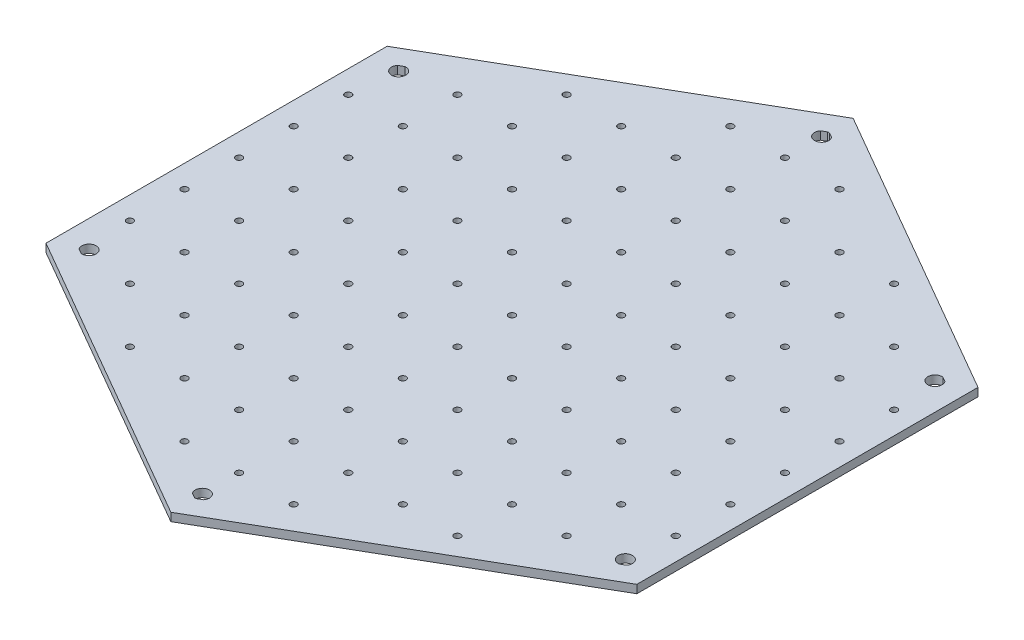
ISO-10303-21;
HEADER;
FILE_DESCRIPTION(('STEP AP214'),'2;1');
FILE_NAME('part.step','',(''),(''),'','','');
FILE_SCHEMA(('AUTOMOTIVE_DESIGN { 1 0 10303 214 1 1 1 1 }'));
ENDSEC;
DATA;
#1=APPLICATION_CONTEXT('core data for automotive mechanical design processes');
#2=APPLICATION_PROTOCOL_DEFINITION('international standard','automotive_design',2000,#1);
#3=PRODUCT_CONTEXT('',#1,'mechanical');
#4=PRODUCT('Part','Part','',(#3));
#5=PRODUCT_RELATED_PRODUCT_CATEGORY('part','',(#4));
#6=PRODUCT_DEFINITION_FORMATION('','',#4);
#7=PRODUCT_DEFINITION_CONTEXT('part definition',#1,'design');
#8=PRODUCT_DEFINITION('design','',#6,#7);
#9=PRODUCT_DEFINITION_SHAPE('','',#8);
#10=(LENGTH_UNIT() NAMED_UNIT(*) SI_UNIT(.MILLI.,.METRE.));
#11=(NAMED_UNIT(*) PLANE_ANGLE_UNIT() SI_UNIT($,.RADIAN.));
#12=(NAMED_UNIT(*) SI_UNIT($,.STERADIAN.) SOLID_ANGLE_UNIT());
#13=UNCERTAINTY_MEASURE_WITH_UNIT(LENGTH_MEASURE(1.E-05),#10,'distance_accuracy_value','');
#14=(GEOMETRIC_REPRESENTATION_CONTEXT(3) GLOBAL_UNCERTAINTY_ASSIGNED_CONTEXT((#13)) GLOBAL_UNIT_ASSIGNED_CONTEXT((#10,
#11,#12)) REPRESENTATION_CONTEXT('',''));
#15=CARTESIAN_POINT('',(0.,0.,0.));
#16=DIRECTION('',(0.,0.,1.));
#17=DIRECTION('',(1.,0.,0.));
#18=AXIS2_PLACEMENT_3D('',#15,#16,#17);
#19=CARTESIAN_POINT('',(0.,0.,56.7264973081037));
#20=DIRECTION('',(0.,1.,0.));
#21=DIRECTION('',(0.,0.,1.));
#22=AXIS2_PLACEMENT_3D('',#19,#20,#21);
#23=CYLINDRICAL_SURFACE('',#22,1.3);
#24=CARTESIAN_POINT('',(0.,1.5,56.7264973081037));
#25=DIRECTION('',(0.,1.,0.));
#26=DIRECTION('',(0.,0.,1.));
#27=AXIS2_PLACEMENT_3D('',#24,#25,#26);
#28=CIRCLE('',#27,1.3);
#29=CARTESIAN_POINT('',(1.03301270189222,1.5,57.5157277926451));
#30=VERTEX_POINT('',#29);
#31=CARTESIAN_POINT('',(-1.0330127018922,1.5,57.5157277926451));
#32=VERTEX_POINT('',#31);
#33=EDGE_CURVE('E257',#30,#32,#28,.T.);
#34=ORIENTED_EDGE('',*,*,#33,.T.);
#35=DIRECTION('',(0.,1.,0.));
#36=VECTOR('',#35,1.);
#37=CARTESIAN_POINT('',(-1.03301270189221,0.,57.5157277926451));
#38=LINE('',#37,#36);
#39=CARTESIAN_POINT('',(-1.0330127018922,0.,57.5157277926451));
#40=VERTEX_POINT('',#39);
#41=EDGE_CURVE('E11',#32,#40,#38,.F.);
#42=ORIENTED_EDGE('',*,*,#41,.T.);
#43=CARTESIAN_POINT('',(0.,0.,56.7264973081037));
#44=DIRECTION('',(0.,1.,0.));
#45=DIRECTION('',(0.,0.,1.));
#46=AXIS2_PLACEMENT_3D('',#43,#44,#45);
#47=CIRCLE('',#46,1.3);
#48=CARTESIAN_POINT('',(1.03301270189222,0.,57.5157277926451));
#49=VERTEX_POINT('',#48);
#50=EDGE_CURVE('E256',#49,#40,#47,.T.);
#51=ORIENTED_EDGE('',*,*,#50,.F.);
#52=DIRECTION('',(0.,1.,0.));
#53=VECTOR('',#52,1.);
#54=CARTESIAN_POINT('',(1.03301270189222,0.,57.5157277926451));
#55=LINE('',#54,#53);
#56=EDGE_CURVE('E211',#49,#30,#55,.T.);
#57=ORIENTED_EDGE('',*,*,#56,.T.);
#58=EDGE_LOOP('',(#34,#42,#51,#57));
#59=FACE_BOUND('',#58,.T.);
#60=ADVANCED_FACE('F33',(#59),#23,.F.);
#61=CARTESIAN_POINT('',(0.,0.,-56.7264973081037));
#62=DIRECTION('',(0.,1.,0.));
#63=DIRECTION('',(0.,0.,1.));
#64=AXIS2_PLACEMENT_3D('',#61,#62,#63);
#65=CYLINDRICAL_SURFACE('',#64,1.3);
#66=CARTESIAN_POINT('',(0.,1.5,-56.7264973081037));
#67=DIRECTION('',(0.,1.,0.));
#68=DIRECTION('',(0.,0.,1.));
#69=AXIS2_PLACEMENT_3D('',#66,#67,#68);
#70=CIRCLE('',#69,1.3);
#71=CARTESIAN_POINT('',(-1.03301270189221,1.5,-57.5157277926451));
#72=VERTEX_POINT('',#71);
#73=CARTESIAN_POINT('',(1.03301270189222,1.5,-57.5157277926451));
#74=VERTEX_POINT('',#73);
#75=EDGE_CURVE('E273',#72,#74,#70,.T.);
#76=ORIENTED_EDGE('',*,*,#75,.T.);
#77=DIRECTION('',(0.,1.,0.));
#78=VECTOR('',#77,1.);
#79=CARTESIAN_POINT('',(1.03301270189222,0.,-57.5157277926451));
#80=LINE('',#79,#78);
#81=CARTESIAN_POINT('',(1.03301270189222,0.,-57.5157277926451));
#82=VERTEX_POINT('',#81);
#83=EDGE_CURVE('E231',#74,#82,#80,.F.);
#84=ORIENTED_EDGE('',*,*,#83,.T.);
#85=CARTESIAN_POINT('',(0.,0.,-56.7264973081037));
#86=DIRECTION('',(0.,1.,0.));
#87=DIRECTION('',(0.,0.,1.));
#88=AXIS2_PLACEMENT_3D('',#85,#86,#87);
#89=CIRCLE('',#88,1.3);
#90=CARTESIAN_POINT('',(-1.03301270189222,0.,-57.5157277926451));
#91=VERTEX_POINT('',#90);
#92=EDGE_CURVE('E268',#91,#82,#89,.T.);
#93=ORIENTED_EDGE('',*,*,#92,.F.);
#94=DIRECTION('',(0.,1.,0.));
#95=VECTOR('',#94,1.);
#96=CARTESIAN_POINT('',(-1.03301270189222,0.,-57.5157277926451));
#97=LINE('',#96,#95);
#98=EDGE_CURVE('E241',#91,#72,#97,.T.);
#99=ORIENTED_EDGE('',*,*,#98,.T.);
#100=EDGE_LOOP('',(#76,#84,#93,#99));
#101=FACE_BOUND('',#100,.T.);
#102=ADVANCED_FACE('F914',(#101),#65,.F.);
#103=CARTESIAN_POINT('',(0.,1.5,0.));
#104=DIRECTION('',(0.,1.,0.));
#105=DIRECTION('',(0.,0.,1.));
#106=AXIS2_PLACEMENT_3D('',#103,#104,#105);
#107=PLANE('',#106);
#108=CARTESIAN_POINT('',(-0.166987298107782,1.5,58.0157277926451));
#109=VERTEX_POINT('',#108);
#110=CARTESIAN_POINT('',(0.16698729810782,1.5,58.0157277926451));
#111=VERTEX_POINT('',#110);
#112=EDGE_CURVE('E251',#109,#111,#28,.T.);
#113=ORIENTED_EDGE('',*,*,#112,.F.);
#114=DIRECTION('',(-0.866025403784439,0.,-0.5));
#115=VECTOR('',#114,1.);
#116=CARTESIAN_POINT('',(-54.1265877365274,1.5,26.8621379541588));
#117=LINE('',#116,#115);
#118=EDGE_CURVE('E204',#109,#32,#117,.T.);
#119=ORIENTED_EDGE('',*,*,#118,.T.);
#120=ORIENTED_EDGE('',*,*,#33,.F.);
#121=DIRECTION('',(-0.866025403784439,0.,0.5));
#122=VECTOR('',#121,1.);
#123=CARTESIAN_POINT('',(0.,1.5,58.1121379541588));
#124=LINE('',#123,#122);
#125=EDGE_CURVE('E201',#30,#111,#124,.T.);
#126=ORIENTED_EDGE('',*,*,#125,.T.);
#127=EDGE_LOOP('',(#113,#119,#120,#126));
#128=FACE_BOUND('',#127,.T.);
#129=CARTESIAN_POINT('',(-49.1265877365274,1.5,28.3632486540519));
#130=DIRECTION('',(0.,1.,0.));
#131=DIRECTION('',(0.,0.,1.));
#132=AXIS2_PLACEMENT_3D('',#129,#130,#131);
#133=CIRCLE('',#132,1.3);
#134=CARTESIAN_POINT('',(-49.2935750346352,1.5,29.6524791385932));
#135=VERTEX_POINT('',#134);
#136=CARTESIAN_POINT('',(-50.1596004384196,1.5,29.1524791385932));
#137=VERTEX_POINT('',#136);
#138=EDGE_CURVE('E48',#135,#137,#133,.T.);
#139=ORIENTED_EDGE('',*,*,#138,.F.);
#140=EDGE_CURVE('E200',#135,#137,#117,.T.);
#141=ORIENTED_EDGE('',*,*,#140,.T.);
#142=EDGE_LOOP('',(#139,#141));
#143=FACE_BOUND('',#142,.T.);
#144=DIRECTION('',(0.,0.,1.));
#145=VECTOR('',#144,1.);
#146=CARTESIAN_POINT('',(-54.1265877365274,1.5,-31.25));
#147=LINE('',#146,#145);
#148=CARTESIAN_POINT('',(-54.1265877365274,1.5,-31.25));
#149=VERTEX_POINT('',#148);
#150=CARTESIAN_POINT('',(-54.1265877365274,1.5,31.25));
#151=VERTEX_POINT('',#150);
#152=EDGE_CURVE('E814',#149,#151,#147,.T.);
#153=ORIENTED_EDGE('',*,*,#152,.T.);
#154=DIRECTION('',(0.866025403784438,0.,0.5));
#155=VECTOR('',#154,1.);
#156=CARTESIAN_POINT('',(-54.1265877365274,1.5,31.25));
#157=LINE('',#156,#155);
#158=CARTESIAN_POINT('',(0.,1.5,62.5));
#159=VERTEX_POINT('',#158);
#160=EDGE_CURVE('E816',#151,#159,#157,.T.);
#161=ORIENTED_EDGE('',*,*,#160,.T.);
#162=DIRECTION('',(0.866025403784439,0.,-0.5));
#163=VECTOR('',#162,1.);
#164=CARTESIAN_POINT('',(0.,1.5,62.5));
#165=LINE('',#164,#163);
#166=CARTESIAN_POINT('',(54.1265877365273,1.5,31.25));
#167=VERTEX_POINT('',#166);
#168=EDGE_CURVE('E818',#159,#167,#165,.T.);
#169=ORIENTED_EDGE('',*,*,#168,.T.);
#170=DIRECTION('',(0.,0.,-1.));
#171=VECTOR('',#170,1.);
#172=CARTESIAN_POINT('',(54.1265877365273,1.5,31.25));
#173=LINE('',#172,#171);
#174=CARTESIAN_POINT('',(54.1265877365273,1.5,-31.25));
#175=VERTEX_POINT('',#174);
#176=EDGE_CURVE('E820',#167,#175,#173,.T.);
#177=ORIENTED_EDGE('',*,*,#176,.T.);
#178=DIRECTION('',(-0.866025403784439,0.,-0.5));
#179=VECTOR('',#178,1.);
#180=CARTESIAN_POINT('',(54.1265877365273,1.5,-31.25));
#181=LINE('',#180,#179);
#182=CARTESIAN_POINT('',(0.,1.5,-62.5));
#183=VERTEX_POINT('',#182);
#184=EDGE_CURVE('E809',#175,#183,#181,.T.);
#185=ORIENTED_EDGE('',*,*,#184,.T.);
#186=DIRECTION('',(-0.866025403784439,0.,0.5));
#187=VECTOR('',#186,1.);
#188=CARTESIAN_POINT('',(0.,1.5,-62.5));
#189=LINE('',#188,#187);
#190=EDGE_CURVE('E811',#183,#149,#189,.T.);
#191=ORIENTED_EDGE('',*,*,#190,.T.);
#192=EDGE_LOOP('',(#153,#161,#169,#177,#185,#191));
#193=FACE_BOUND('',#192,.T.);
#194=CARTESIAN_POINT('',(49.1265877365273,1.5,28.3632486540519));
#195=DIRECTION('',(0.,1.,0.));
#196=DIRECTION('',(0.,0.,1.));
#197=AXIS2_PLACEMENT_3D('',#194,#195,#196);
#198=CIRCLE('',#197,1.3);
#199=CARTESIAN_POINT('',(50.1596004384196,1.5,29.1524791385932));
#200=VERTEX_POINT('',#199);
#201=CARTESIAN_POINT('',(49.2935750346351,1.5,29.6524791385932));
#202=VERTEX_POINT('',#201);
#203=EDGE_CURVE('E178',#200,#202,#198,.T.);
#204=ORIENTED_EDGE('',*,*,#203,.F.);
#205=EDGE_CURVE('E183',#200,#202,#124,.T.);
#206=ORIENTED_EDGE('',*,*,#205,.T.);
#207=EDGE_LOOP('',(#204,#206));
#208=FACE_BOUND('',#207,.T.);
#209=CARTESIAN_POINT('',(-20.,1.5,-40.));
#210=DIRECTION('',(0.,-1.,0.));
#211=DIRECTION('',(0.,0.,-1.));
#212=AXIS2_PLACEMENT_3D('',#209,#210,#211);
#213=CIRCLE('',#212,0.6);
#214=CARTESIAN_POINT('',(-20.,1.5,-40.6));
#215=VERTEX_POINT('',#214);
#216=EDGE_CURVE('E284',#215,#215,#213,.T.);
#217=ORIENTED_EDGE('',*,*,#216,.T.);
#218=EDGE_LOOP('',(#217));
#219=FACE_BOUND('',#218,.T.);
#220=CARTESIAN_POINT('',(-30.,1.5,-30.));
#221=DIRECTION('',(0.,-1.,0.));
#222=DIRECTION('',(0.,0.,-1.));
#223=AXIS2_PLACEMENT_3D('',#220,#221,#222);
#224=CIRCLE('',#223,0.6);
#225=CARTESIAN_POINT('',(-30.,1.5,-30.6));
#226=VERTEX_POINT('',#225);
#227=EDGE_CURVE('E302',#226,#226,#224,.T.);
#228=ORIENTED_EDGE('',*,*,#227,.T.);
#229=EDGE_LOOP('',(#228));
#230=FACE_BOUND('',#229,.T.);
#231=CARTESIAN_POINT('',(-10.,1.5,-30.));
#232=DIRECTION('',(0.,-1.,0.));
#233=DIRECTION('',(0.,0.,-1.));
#234=AXIS2_PLACEMENT_3D('',#231,#232,#233);
#235=CIRCLE('',#234,0.6);
#236=CARTESIAN_POINT('',(-10.,1.5,-30.6));
#237=VERTEX_POINT('',#236);
#238=EDGE_CURVE('E314',#237,#237,#235,.T.);
#239=ORIENTED_EDGE('',*,*,#238,.T.);
#240=EDGE_LOOP('',(#239));
#241=FACE_BOUND('',#240,.T.);
#242=CARTESIAN_POINT('',(-40.,1.5,-20.));
#243=DIRECTION('',(0.,-1.,0.));
#244=DIRECTION('',(0.,0.,-1.));
#245=AXIS2_PLACEMENT_3D('',#242,#243,#244);
#246=CIRCLE('',#245,0.6);
#247=CARTESIAN_POINT('',(-40.,1.5,-20.6));
#248=VERTEX_POINT('',#247);
#249=EDGE_CURVE('E326',#248,#248,#246,.T.);
#250=ORIENTED_EDGE('',*,*,#249,.T.);
#251=EDGE_LOOP('',(#250));
#252=FACE_BOUND('',#251,.T.);
#253=CARTESIAN_POINT('',(-20.,1.5,-20.));
#254=DIRECTION('',(0.,-1.,0.));
#255=DIRECTION('',(0.,0.,-1.));
#256=AXIS2_PLACEMENT_3D('',#253,#254,#255);
#257=CIRCLE('',#256,0.6);
#258=CARTESIAN_POINT('',(-20.,1.5,-20.6));
#259=VERTEX_POINT('',#258);
#260=EDGE_CURVE('E338',#259,#259,#257,.T.);
#261=ORIENTED_EDGE('',*,*,#260,.T.);
#262=EDGE_LOOP('',(#261));
#263=FACE_BOUND('',#262,.T.);
#264=CARTESIAN_POINT('',(-50.,1.5,-9.99999999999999));
#265=DIRECTION('',(0.,-1.,0.));
#266=DIRECTION('',(0.,0.,-1.));
#267=AXIS2_PLACEMENT_3D('',#264,#265,#266);
#268=CIRCLE('',#267,0.6);
#269=CARTESIAN_POINT('',(-50.,1.5,-10.6));
#270=VERTEX_POINT('',#269);
#271=EDGE_CURVE('E350',#270,#270,#268,.T.);
#272=ORIENTED_EDGE('',*,*,#271,.T.);
#273=EDGE_LOOP('',(#272));
#274=FACE_BOUND('',#273,.T.);
#275=CARTESIAN_POINT('',(-30.,1.5,-9.99999999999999));
#276=DIRECTION('',(0.,-1.,0.));
#277=DIRECTION('',(0.,0.,-1.));
#278=AXIS2_PLACEMENT_3D('',#275,#276,#277);
#279=CIRCLE('',#278,0.6);
#280=CARTESIAN_POINT('',(-30.,1.5,-10.6));
#281=VERTEX_POINT('',#280);
#282=EDGE_CURVE('E362',#281,#281,#279,.T.);
#283=ORIENTED_EDGE('',*,*,#282,.T.);
#284=EDGE_LOOP('',(#283));
#285=FACE_BOUND('',#284,.T.);
#286=CARTESIAN_POINT('',(-10.,1.5,-10.));
#287=DIRECTION('',(0.,-1.,0.));
#288=DIRECTION('',(0.,0.,-1.));
#289=AXIS2_PLACEMENT_3D('',#286,#287,#288);
#290=CIRCLE('',#289,0.6);
#291=CARTESIAN_POINT('',(-10.,1.5,-10.6));
#292=VERTEX_POINT('',#291);
#293=EDGE_CURVE('E374',#292,#292,#290,.T.);
#294=ORIENTED_EDGE('',*,*,#293,.T.);
#295=EDGE_LOOP('',(#294));
#296=FACE_BOUND('',#295,.T.);
#297=CARTESIAN_POINT('',(10.,1.5,-50.));
#298=DIRECTION('',(0.,1.,0.));
#299=DIRECTION('',(0.,0.,-1.));
#300=AXIS2_PLACEMENT_3D('',#297,#298,#299);
#301=CIRCLE('',#300,0.6);
#302=CARTESIAN_POINT('',(10.,1.5,-50.6));
#303=VERTEX_POINT('',#302);
#304=EDGE_CURVE('E380',#303,#303,#301,.T.);
#305=ORIENTED_EDGE('',*,*,#304,.F.);
#306=EDGE_LOOP('',(#305));
#307=FACE_BOUND('',#306,.T.);
#308=CARTESIAN_POINT('',(0.,1.5,-50.));
#309=DIRECTION('',(0.,1.,0.));
#310=DIRECTION('',(0.,0.,-1.));
#311=AXIS2_PLACEMENT_3D('',#308,#309,#310);
#312=CIRCLE('',#311,0.6);
#313=CARTESIAN_POINT('',(0.,1.5,-50.6));
#314=VERTEX_POINT('',#313);
#315=EDGE_CURVE('E386',#314,#314,#312,.T.);
#316=ORIENTED_EDGE('',*,*,#315,.F.);
#317=EDGE_LOOP('',(#316));
#318=FACE_BOUND('',#317,.T.);
#319=CARTESIAN_POINT('',(30.,1.5,-40.));
#320=DIRECTION('',(0.,1.,0.));
#321=DIRECTION('',(0.,0.,-1.));
#322=AXIS2_PLACEMENT_3D('',#319,#320,#321);
#323=CIRCLE('',#322,0.6);
#324=CARTESIAN_POINT('',(30.,1.5,-40.6));
#325=VERTEX_POINT('',#324);
#326=EDGE_CURVE('E392',#325,#325,#323,.T.);
#327=ORIENTED_EDGE('',*,*,#326,.F.);
#328=EDGE_LOOP('',(#327));
#329=FACE_BOUND('',#328,.T.);
#330=CARTESIAN_POINT('',(20.,1.5,-40.));
#331=DIRECTION('',(0.,1.,0.));
#332=DIRECTION('',(0.,0.,-1.));
#333=AXIS2_PLACEMENT_3D('',#330,#331,#332);
#334=CIRCLE('',#333,0.6);
#335=CARTESIAN_POINT('',(20.,1.5,-40.6));
#336=VERTEX_POINT('',#335);
#337=EDGE_CURVE('E398',#336,#336,#334,.T.);
#338=ORIENTED_EDGE('',*,*,#337,.F.);
#339=EDGE_LOOP('',(#338));
#340=FACE_BOUND('',#339,.T.);
#341=CARTESIAN_POINT('',(10.,1.5,-40.));
#342=DIRECTION('',(0.,1.,0.));
#343=DIRECTION('',(0.,0.,-1.));
#344=AXIS2_PLACEMENT_3D('',#341,#342,#343);
#345=CIRCLE('',#344,0.6);
#346=CARTESIAN_POINT('',(10.,1.5,-40.6));
#347=VERTEX_POINT('',#346);
#348=EDGE_CURVE('E404',#347,#347,#345,.T.);
#349=ORIENTED_EDGE('',*,*,#348,.F.);
#350=EDGE_LOOP('',(#349));
#351=FACE_BOUND('',#350,.T.);
#352=CARTESIAN_POINT('',(0.,1.5,-40.));
#353=DIRECTION('',(0.,1.,0.));
#354=DIRECTION('',(0.,0.,-1.));
#355=AXIS2_PLACEMENT_3D('',#352,#353,#354);
#356=CIRCLE('',#355,0.6);
#357=CARTESIAN_POINT('',(0.,1.5,-40.6));
#358=VERTEX_POINT('',#357);
#359=EDGE_CURVE('E410',#358,#358,#356,.T.);
#360=ORIENTED_EDGE('',*,*,#359,.F.);
#361=EDGE_LOOP('',(#360));
#362=FACE_BOUND('',#361,.T.);
#363=CARTESIAN_POINT('',(40.,1.5,-30.));
#364=DIRECTION('',(0.,1.,0.));
#365=DIRECTION('',(0.,0.,-1.));
#366=AXIS2_PLACEMENT_3D('',#363,#364,#365);
#367=CIRCLE('',#366,0.6);
#368=CARTESIAN_POINT('',(40.,1.5,-30.6));
#369=VERTEX_POINT('',#368);
#370=EDGE_CURVE('E416',#369,#369,#367,.T.);
#371=ORIENTED_EDGE('',*,*,#370,.F.);
#372=EDGE_LOOP('',(#371));
#373=FACE_BOUND('',#372,.T.);
#374=CARTESIAN_POINT('',(30.,1.5,-30.));
#375=DIRECTION('',(0.,1.,0.));
#376=DIRECTION('',(0.,0.,-1.));
#377=AXIS2_PLACEMENT_3D('',#374,#375,#376);
#378=CIRCLE('',#377,0.6);
#379=CARTESIAN_POINT('',(30.,1.5,-30.6));
#380=VERTEX_POINT('',#379);
#381=EDGE_CURVE('E422',#380,#380,#378,.T.);
#382=ORIENTED_EDGE('',*,*,#381,.F.);
#383=EDGE_LOOP('',(#382));
#384=FACE_BOUND('',#383,.T.);
#385=CARTESIAN_POINT('',(20.,1.5,-30.));
#386=DIRECTION('',(0.,1.,0.));
#387=DIRECTION('',(0.,0.,-1.));
#388=AXIS2_PLACEMENT_3D('',#385,#386,#387);
#389=CIRCLE('',#388,0.6);
#390=CARTESIAN_POINT('',(20.,1.5,-30.6));
#391=VERTEX_POINT('',#390);
#392=EDGE_CURVE('E428',#391,#391,#389,.T.);
#393=ORIENTED_EDGE('',*,*,#392,.F.);
#394=EDGE_LOOP('',(#393));
#395=FACE_BOUND('',#394,.T.);
#396=CARTESIAN_POINT('',(10.,1.5,-30.));
#397=DIRECTION('',(0.,1.,0.));
#398=DIRECTION('',(0.,0.,-1.));
#399=AXIS2_PLACEMENT_3D('',#396,#397,#398);
#400=CIRCLE('',#399,0.6);
#401=CARTESIAN_POINT('',(10.,1.5,-30.6));
#402=VERTEX_POINT('',#401);
#403=EDGE_CURVE('E434',#402,#402,#400,.T.);
#404=ORIENTED_EDGE('',*,*,#403,.F.);
#405=EDGE_LOOP('',(#404));
#406=FACE_BOUND('',#405,.T.);
#407=CARTESIAN_POINT('',(0.,1.5,-30.));
#408=DIRECTION('',(0.,1.,0.));
#409=DIRECTION('',(0.,0.,-1.));
#410=AXIS2_PLACEMENT_3D('',#407,#408,#409);
#411=CIRCLE('',#410,0.6);
#412=CARTESIAN_POINT('',(0.,1.5,-30.6));
#413=VERTEX_POINT('',#412);
#414=EDGE_CURVE('E440',#413,#413,#411,.T.);
#415=ORIENTED_EDGE('',*,*,#414,.F.);
#416=EDGE_LOOP('',(#415));
#417=FACE_BOUND('',#416,.T.);
#418=CARTESIAN_POINT('',(50.,1.5,-20.));
#419=DIRECTION('',(0.,1.,0.));
#420=DIRECTION('',(0.,0.,-1.));
#421=AXIS2_PLACEMENT_3D('',#418,#419,#420);
#422=CIRCLE('',#421,0.6);
#423=CARTESIAN_POINT('',(50.,1.5,-20.6));
#424=VERTEX_POINT('',#423);
#425=EDGE_CURVE('E446',#424,#424,#422,.T.);
#426=ORIENTED_EDGE('',*,*,#425,.F.);
#427=EDGE_LOOP('',(#426));
#428=FACE_BOUND('',#427,.T.);
#429=CARTESIAN_POINT('',(40.,1.5,-20.));
#430=DIRECTION('',(0.,1.,0.));
#431=DIRECTION('',(0.,0.,-1.));
#432=AXIS2_PLACEMENT_3D('',#429,#430,#431);
#433=CIRCLE('',#432,0.6);
#434=CARTESIAN_POINT('',(40.,1.5,-20.6));
#435=VERTEX_POINT('',#434);
#436=EDGE_CURVE('E452',#435,#435,#433,.T.);
#437=ORIENTED_EDGE('',*,*,#436,.F.);
#438=EDGE_LOOP('',(#437));
#439=FACE_BOUND('',#438,.T.);
#440=CARTESIAN_POINT('',(30.,1.5,-20.));
#441=DIRECTION('',(0.,1.,0.));
#442=DIRECTION('',(0.,0.,-1.));
#443=AXIS2_PLACEMENT_3D('',#440,#441,#442);
#444=CIRCLE('',#443,0.6);
#445=CARTESIAN_POINT('',(30.,1.5,-20.6));
#446=VERTEX_POINT('',#445);
#447=EDGE_CURVE('E458',#446,#446,#444,.T.);
#448=ORIENTED_EDGE('',*,*,#447,.F.);
#449=EDGE_LOOP('',(#448));
#450=FACE_BOUND('',#449,.T.);
#451=CARTESIAN_POINT('',(20.,1.5,-20.));
#452=DIRECTION('',(0.,1.,0.));
#453=DIRECTION('',(0.,0.,-1.));
#454=AXIS2_PLACEMENT_3D('',#451,#452,#453);
#455=CIRCLE('',#454,0.6);
#456=CARTESIAN_POINT('',(20.,1.5,-20.6));
#457=VERTEX_POINT('',#456);
#458=EDGE_CURVE('E464',#457,#457,#455,.T.);
#459=ORIENTED_EDGE('',*,*,#458,.F.);
#460=EDGE_LOOP('',(#459));
#461=FACE_BOUND('',#460,.T.);
#462=CARTESIAN_POINT('',(10.,1.5,-20.));
#463=DIRECTION('',(0.,1.,0.));
#464=DIRECTION('',(0.,0.,-1.));
#465=AXIS2_PLACEMENT_3D('',#462,#463,#464);
#466=CIRCLE('',#465,0.6);
#467=CARTESIAN_POINT('',(10.,1.5,-20.6));
#468=VERTEX_POINT('',#467);
#469=EDGE_CURVE('E470',#468,#468,#466,.T.);
#470=ORIENTED_EDGE('',*,*,#469,.F.);
#471=EDGE_LOOP('',(#470));
#472=FACE_BOUND('',#471,.T.);
#473=CARTESIAN_POINT('',(0.,1.5,-20.));
#474=DIRECTION('',(0.,1.,0.));
#475=DIRECTION('',(0.,0.,-1.));
#476=AXIS2_PLACEMENT_3D('',#473,#474,#475);
#477=CIRCLE('',#476,0.6);
#478=CARTESIAN_POINT('',(0.,1.5,-20.6));
#479=VERTEX_POINT('',#478);
#480=EDGE_CURVE('E476',#479,#479,#477,.T.);
#481=ORIENTED_EDGE('',*,*,#480,.F.);
#482=EDGE_LOOP('',(#481));
#483=FACE_BOUND('',#482,.T.);
#484=CARTESIAN_POINT('',(50.,1.5,-9.99999999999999));
#485=DIRECTION('',(0.,1.,0.));
#486=DIRECTION('',(0.,0.,-1.));
#487=AXIS2_PLACEMENT_3D('',#484,#485,#486);
#488=CIRCLE('',#487,0.6);
#489=CARTESIAN_POINT('',(50.,1.5,-10.6));
#490=VERTEX_POINT('',#489);
#491=EDGE_CURVE('E482',#490,#490,#488,.T.);
#492=ORIENTED_EDGE('',*,*,#491,.F.);
#493=EDGE_LOOP('',(#492));
#494=FACE_BOUND('',#493,.T.);
#495=CARTESIAN_POINT('',(40.,1.5,-10.));
#496=DIRECTION('',(0.,1.,0.));
#497=DIRECTION('',(0.,0.,-1.));
#498=AXIS2_PLACEMENT_3D('',#495,#496,#497);
#499=CIRCLE('',#498,0.6);
#500=CARTESIAN_POINT('',(40.,1.5,-10.6));
#501=VERTEX_POINT('',#500);
#502=EDGE_CURVE('E488',#501,#501,#499,.T.);
#503=ORIENTED_EDGE('',*,*,#502,.F.);
#504=EDGE_LOOP('',(#503));
#505=FACE_BOUND('',#504,.T.);
#506=CARTESIAN_POINT('',(30.,1.5,-10.));
#507=DIRECTION('',(0.,1.,0.));
#508=DIRECTION('',(0.,0.,-1.));
#509=AXIS2_PLACEMENT_3D('',#506,#507,#508);
#510=CIRCLE('',#509,0.6);
#511=CARTESIAN_POINT('',(30.,1.5,-10.6));
#512=VERTEX_POINT('',#511);
#513=EDGE_CURVE('E494',#512,#512,#510,.T.);
#514=ORIENTED_EDGE('',*,*,#513,.F.);
#515=EDGE_LOOP('',(#514));
#516=FACE_BOUND('',#515,.T.);
#517=CARTESIAN_POINT('',(20.,1.5,-10.));
#518=DIRECTION('',(0.,1.,0.));
#519=DIRECTION('',(0.,0.,-1.));
#520=AXIS2_PLACEMENT_3D('',#517,#518,#519);
#521=CIRCLE('',#520,0.6);
#522=CARTESIAN_POINT('',(20.,1.5,-10.6));
#523=VERTEX_POINT('',#522);
#524=EDGE_CURVE('E500',#523,#523,#521,.T.);
#525=ORIENTED_EDGE('',*,*,#524,.F.);
#526=EDGE_LOOP('',(#525));
#527=FACE_BOUND('',#526,.T.);
#528=CARTESIAN_POINT('',(10.,1.5,-10.));
#529=DIRECTION('',(0.,1.,0.));
#530=DIRECTION('',(0.,0.,-1.));
#531=AXIS2_PLACEMENT_3D('',#528,#529,#530);
#532=CIRCLE('',#531,0.6);
#533=CARTESIAN_POINT('',(10.,1.5,-10.6));
#534=VERTEX_POINT('',#533);
#535=EDGE_CURVE('E506',#534,#534,#532,.T.);
#536=ORIENTED_EDGE('',*,*,#535,.F.);
#537=EDGE_LOOP('',(#536));
#538=FACE_BOUND('',#537,.T.);
#539=CARTESIAN_POINT('',(0.,1.5,-10.));
#540=DIRECTION('',(0.,1.,0.));
#541=DIRECTION('',(0.,0.,-1.));
#542=AXIS2_PLACEMENT_3D('',#539,#540,#541);
#543=CIRCLE('',#542,0.6);
#544=CARTESIAN_POINT('',(0.,1.5,-10.6));
#545=VERTEX_POINT('',#544);
#546=EDGE_CURVE('E512',#545,#545,#543,.T.);
#547=ORIENTED_EDGE('',*,*,#546,.F.);
#548=EDGE_LOOP('',(#547));
#549=FACE_BOUND('',#548,.T.);
#550=CARTESIAN_POINT('',(-10.,1.5,50.));
#551=DIRECTION('',(0.,1.,0.));
#552=DIRECTION('',(0.,0.,1.));
#553=AXIS2_PLACEMENT_3D('',#550,#551,#552);
#554=CIRCLE('',#553,0.6);
#555=CARTESIAN_POINT('',(-10.,1.5,50.6));
#556=VERTEX_POINT('',#555);
#557=EDGE_CURVE('E518',#556,#556,#554,.T.);
#558=ORIENTED_EDGE('',*,*,#557,.F.);
#559=EDGE_LOOP('',(#558));
#560=FACE_BOUND('',#559,.T.);
#561=CARTESIAN_POINT('',(-30.,1.5,40.));
#562=DIRECTION('',(0.,1.,0.));
#563=DIRECTION('',(0.,0.,1.));
#564=AXIS2_PLACEMENT_3D('',#561,#562,#563);
#565=CIRCLE('',#564,0.6);
#566=CARTESIAN_POINT('',(-30.,1.5,40.6));
#567=VERTEX_POINT('',#566);
#568=EDGE_CURVE('E524',#567,#567,#565,.T.);
#569=ORIENTED_EDGE('',*,*,#568,.F.);
#570=EDGE_LOOP('',(#569));
#571=FACE_BOUND('',#570,.T.);
#572=CARTESIAN_POINT('',(-20.,1.5,40.));
#573=DIRECTION('',(0.,1.,0.));
#574=DIRECTION('',(0.,0.,1.));
#575=AXIS2_PLACEMENT_3D('',#572,#573,#574);
#576=CIRCLE('',#575,0.6);
#577=CARTESIAN_POINT('',(-20.,1.5,40.6));
#578=VERTEX_POINT('',#577);
#579=EDGE_CURVE('E530',#578,#578,#576,.T.);
#580=ORIENTED_EDGE('',*,*,#579,.F.);
#581=EDGE_LOOP('',(#580));
#582=FACE_BOUND('',#581,.T.);
#583=CARTESIAN_POINT('',(-10.,1.5,40.));
#584=DIRECTION('',(0.,1.,0.));
#585=DIRECTION('',(0.,0.,1.));
#586=AXIS2_PLACEMENT_3D('',#583,#584,#585);
#587=CIRCLE('',#586,0.6);
#588=CARTESIAN_POINT('',(-10.,1.5,40.6));
#589=VERTEX_POINT('',#588);
#590=EDGE_CURVE('E536',#589,#589,#587,.T.);
#591=ORIENTED_EDGE('',*,*,#590,.F.);
#592=EDGE_LOOP('',(#591));
#593=FACE_BOUND('',#592,.T.);
#594=CARTESIAN_POINT('',(-40.,1.5,30.));
#595=DIRECTION('',(0.,1.,0.));
#596=DIRECTION('',(0.,0.,1.));
#597=AXIS2_PLACEMENT_3D('',#594,#595,#596);
#598=CIRCLE('',#597,0.6);
#599=CARTESIAN_POINT('',(-40.,1.5,30.6));
#600=VERTEX_POINT('',#599);
#601=EDGE_CURVE('E542',#600,#600,#598,.T.);
#602=ORIENTED_EDGE('',*,*,#601,.F.);
#603=EDGE_LOOP('',(#602));
#604=FACE_BOUND('',#603,.T.);
#605=CARTESIAN_POINT('',(-30.,1.5,30.));
#606=DIRECTION('',(0.,1.,0.));
#607=DIRECTION('',(0.,0.,1.));
#608=AXIS2_PLACEMENT_3D('',#605,#606,#607);
#609=CIRCLE('',#608,0.6);
#610=CARTESIAN_POINT('',(-30.,1.5,30.6));
#611=VERTEX_POINT('',#610);
#612=EDGE_CURVE('E548',#611,#611,#609,.T.);
#613=ORIENTED_EDGE('',*,*,#612,.F.);
#614=EDGE_LOOP('',(#613));
#615=FACE_BOUND('',#614,.T.);
#616=CARTESIAN_POINT('',(-20.,1.5,30.));
#617=DIRECTION('',(0.,1.,0.));
#618=DIRECTION('',(0.,0.,1.));
#619=AXIS2_PLACEMENT_3D('',#616,#617,#618);
#620=CIRCLE('',#619,0.6);
#621=CARTESIAN_POINT('',(-20.,1.5,30.6));
#622=VERTEX_POINT('',#621);
#623=EDGE_CURVE('E554',#622,#622,#620,.T.);
#624=ORIENTED_EDGE('',*,*,#623,.F.);
#625=EDGE_LOOP('',(#624));
#626=FACE_BOUND('',#625,.T.);
#627=CARTESIAN_POINT('',(-10.,1.5,30.));
#628=DIRECTION('',(0.,1.,0.));
#629=DIRECTION('',(0.,0.,1.));
#630=AXIS2_PLACEMENT_3D('',#627,#628,#629);
#631=CIRCLE('',#630,0.6);
#632=CARTESIAN_POINT('',(-10.,1.5,30.6));
#633=VERTEX_POINT('',#632);
#634=EDGE_CURVE('E560',#633,#633,#631,.T.);
#635=ORIENTED_EDGE('',*,*,#634,.F.);
#636=EDGE_LOOP('',(#635));
#637=FACE_BOUND('',#636,.T.);
#638=CARTESIAN_POINT('',(-50.,1.5,20.));
#639=DIRECTION('',(0.,1.,0.));
#640=DIRECTION('',(0.,0.,1.));
#641=AXIS2_PLACEMENT_3D('',#638,#639,#640);
#642=CIRCLE('',#641,0.6);
#643=CARTESIAN_POINT('',(-50.,1.5,20.6));
#644=VERTEX_POINT('',#643);
#645=EDGE_CURVE('E566',#644,#644,#642,.T.);
#646=ORIENTED_EDGE('',*,*,#645,.F.);
#647=EDGE_LOOP('',(#646));
#648=FACE_BOUND('',#647,.T.);
#649=CARTESIAN_POINT('',(-40.,1.5,20.));
#650=DIRECTION('',(0.,1.,0.));
#651=DIRECTION('',(0.,0.,1.));
#652=AXIS2_PLACEMENT_3D('',#649,#650,#651);
#653=CIRCLE('',#652,0.6);
#654=CARTESIAN_POINT('',(-40.,1.5,20.6));
#655=VERTEX_POINT('',#654);
#656=EDGE_CURVE('E572',#655,#655,#653,.T.);
#657=ORIENTED_EDGE('',*,*,#656,.F.);
#658=EDGE_LOOP('',(#657));
#659=FACE_BOUND('',#658,.T.);
#660=CARTESIAN_POINT('',(-30.,1.5,20.));
#661=DIRECTION('',(0.,1.,0.));
#662=DIRECTION('',(0.,0.,1.));
#663=AXIS2_PLACEMENT_3D('',#660,#661,#662);
#664=CIRCLE('',#663,0.6);
#665=CARTESIAN_POINT('',(-30.,1.5,20.6));
#666=VERTEX_POINT('',#665);
#667=EDGE_CURVE('E578',#666,#666,#664,.T.);
#668=ORIENTED_EDGE('',*,*,#667,.F.);
#669=EDGE_LOOP('',(#668));
#670=FACE_BOUND('',#669,.T.);
#671=CARTESIAN_POINT('',(-20.,1.5,20.));
#672=DIRECTION('',(0.,1.,0.));
#673=DIRECTION('',(0.,0.,1.));
#674=AXIS2_PLACEMENT_3D('',#671,#672,#673);
#675=CIRCLE('',#674,0.6);
#676=CARTESIAN_POINT('',(-20.,1.5,20.6));
#677=VERTEX_POINT('',#676);
#678=EDGE_CURVE('E584',#677,#677,#675,.T.);
#679=ORIENTED_EDGE('',*,*,#678,.F.);
#680=EDGE_LOOP('',(#679));
#681=FACE_BOUND('',#680,.T.);
#682=CARTESIAN_POINT('',(-10.,1.5,20.));
#683=DIRECTION('',(0.,1.,0.));
#684=DIRECTION('',(0.,0.,1.));
#685=AXIS2_PLACEMENT_3D('',#682,#683,#684);
#686=CIRCLE('',#685,0.6);
#687=CARTESIAN_POINT('',(-10.,1.5,20.6));
#688=VERTEX_POINT('',#687);
#689=EDGE_CURVE('E590',#688,#688,#686,.T.);
#690=ORIENTED_EDGE('',*,*,#689,.F.);
#691=EDGE_LOOP('',(#690));
#692=FACE_BOUND('',#691,.T.);
#693=CARTESIAN_POINT('',(-50.,1.5,9.99999999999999));
#694=DIRECTION('',(0.,1.,0.));
#695=DIRECTION('',(0.,0.,1.));
#696=AXIS2_PLACEMENT_3D('',#693,#694,#695);
#697=CIRCLE('',#696,0.6);
#698=CARTESIAN_POINT('',(-50.,1.5,10.6));
#699=VERTEX_POINT('',#698);
#700=EDGE_CURVE('E596',#699,#699,#697,.T.);
#701=ORIENTED_EDGE('',*,*,#700,.F.);
#702=EDGE_LOOP('',(#701));
#703=FACE_BOUND('',#702,.T.);
#704=CARTESIAN_POINT('',(-40.,1.5,9.99999999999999));
#705=DIRECTION('',(0.,1.,0.));
#706=DIRECTION('',(0.,0.,1.));
#707=AXIS2_PLACEMENT_3D('',#704,#705,#706);
#708=CIRCLE('',#707,0.6);
#709=CARTESIAN_POINT('',(-40.,1.5,10.6));
#710=VERTEX_POINT('',#709);
#711=EDGE_CURVE('E602',#710,#710,#708,.T.);
#712=ORIENTED_EDGE('',*,*,#711,.F.);
#713=EDGE_LOOP('',(#712));
#714=FACE_BOUND('',#713,.T.);
#715=CARTESIAN_POINT('',(-30.,1.5,9.99999999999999));
#716=DIRECTION('',(0.,1.,0.));
#717=DIRECTION('',(0.,0.,1.));
#718=AXIS2_PLACEMENT_3D('',#715,#716,#717);
#719=CIRCLE('',#718,0.6);
#720=CARTESIAN_POINT('',(-30.,1.5,10.6));
#721=VERTEX_POINT('',#720);
#722=EDGE_CURVE('E608',#721,#721,#719,.T.);
#723=ORIENTED_EDGE('',*,*,#722,.F.);
#724=EDGE_LOOP('',(#723));
#725=FACE_BOUND('',#724,.T.);
#726=CARTESIAN_POINT('',(-20.,1.5,10.));
#727=DIRECTION('',(0.,1.,0.));
#728=DIRECTION('',(0.,0.,1.));
#729=AXIS2_PLACEMENT_3D('',#726,#727,#728);
#730=CIRCLE('',#729,0.6);
#731=CARTESIAN_POINT('',(-20.,1.5,10.6));
#732=VERTEX_POINT('',#731);
#733=EDGE_CURVE('E614',#732,#732,#730,.T.);
#734=ORIENTED_EDGE('',*,*,#733,.F.);
#735=EDGE_LOOP('',(#734));
#736=FACE_BOUND('',#735,.T.);
#737=CARTESIAN_POINT('',(-10.,1.5,10.));
#738=DIRECTION('',(0.,1.,0.));
#739=DIRECTION('',(0.,0.,1.));
#740=AXIS2_PLACEMENT_3D('',#737,#738,#739);
#741=CIRCLE('',#740,0.6);
#742=CARTESIAN_POINT('',(-10.,1.5,10.6));
#743=VERTEX_POINT('',#742);
#744=EDGE_CURVE('E620',#743,#743,#741,.T.);
#745=ORIENTED_EDGE('',*,*,#744,.F.);
#746=EDGE_LOOP('',(#745));
#747=FACE_BOUND('',#746,.T.);
#748=CARTESIAN_POINT('',(0.,1.5,50.));
#749=DIRECTION('',(0.,-1.,0.));
#750=DIRECTION('',(0.,0.,1.));
#751=AXIS2_PLACEMENT_3D('',#748,#749,#750);
#752=CIRCLE('',#751,0.6);
#753=CARTESIAN_POINT('',(0.,1.5,50.6));
#754=VERTEX_POINT('',#753);
#755=EDGE_CURVE('E632',#754,#754,#752,.T.);
#756=ORIENTED_EDGE('',*,*,#755,.T.);
#757=EDGE_LOOP('',(#756));
#758=FACE_BOUND('',#757,.T.);
#759=CARTESIAN_POINT('',(30.,1.5,40.));
#760=DIRECTION('',(0.,-1.,0.));
#761=DIRECTION('',(0.,0.,1.));
#762=AXIS2_PLACEMENT_3D('',#759,#760,#761);
#763=CIRCLE('',#762,0.6);
#764=CARTESIAN_POINT('',(30.,1.5,40.6));
#765=VERTEX_POINT('',#764);
#766=EDGE_CURVE('E638',#765,#765,#763,.T.);
#767=ORIENTED_EDGE('',*,*,#766,.T.);
#768=EDGE_LOOP('',(#767));
#769=FACE_BOUND('',#768,.T.);
#770=CARTESIAN_POINT('',(10.,1.5,40.));
#771=DIRECTION('',(0.,-1.,0.));
#772=DIRECTION('',(0.,0.,1.));
#773=AXIS2_PLACEMENT_3D('',#770,#771,#772);
#774=CIRCLE('',#773,0.6);
#775=CARTESIAN_POINT('',(10.,1.5,40.6));
#776=VERTEX_POINT('',#775);
#777=EDGE_CURVE('E650',#776,#776,#774,.T.);
#778=ORIENTED_EDGE('',*,*,#777,.T.);
#779=EDGE_LOOP('',(#778));
#780=FACE_BOUND('',#779,.T.);
#781=CARTESIAN_POINT('',(30.,1.5,30.));
#782=DIRECTION('',(0.,-1.,0.));
#783=DIRECTION('',(0.,0.,1.));
#784=AXIS2_PLACEMENT_3D('',#781,#782,#783);
#785=CIRCLE('',#784,0.6);
#786=CARTESIAN_POINT('',(30.,1.5,30.6));
#787=VERTEX_POINT('',#786);
#788=EDGE_CURVE('E668',#787,#787,#785,.T.);
#789=ORIENTED_EDGE('',*,*,#788,.T.);
#790=EDGE_LOOP('',(#789));
#791=FACE_BOUND('',#790,.T.);
#792=CARTESIAN_POINT('',(10.,1.5,30.));
#793=DIRECTION('',(0.,-1.,0.));
#794=DIRECTION('',(0.,0.,1.));
#795=AXIS2_PLACEMENT_3D('',#792,#793,#794);
#796=CIRCLE('',#795,0.6);
#797=CARTESIAN_POINT('',(10.,1.5,30.6));
#798=VERTEX_POINT('',#797);
#799=EDGE_CURVE('E680',#798,#798,#796,.T.);
#800=ORIENTED_EDGE('',*,*,#799,.T.);
#801=EDGE_LOOP('',(#800));
#802=FACE_BOUND('',#801,.T.);
#803=CARTESIAN_POINT('',(50.,1.5,20.));
#804=DIRECTION('',(0.,-1.,0.));
#805=DIRECTION('',(0.,0.,1.));
#806=AXIS2_PLACEMENT_3D('',#803,#804,#805);
#807=CIRCLE('',#806,0.6);
#808=CARTESIAN_POINT('',(50.,1.5,20.6));
#809=VERTEX_POINT('',#808);
#810=EDGE_CURVE('E692',#809,#809,#807,.T.);
#811=ORIENTED_EDGE('',*,*,#810,.T.);
#812=EDGE_LOOP('',(#811));
#813=FACE_BOUND('',#812,.T.);
#814=CARTESIAN_POINT('',(30.,1.5,20.));
#815=DIRECTION('',(0.,-1.,0.));
#816=DIRECTION('',(0.,0.,1.));
#817=AXIS2_PLACEMENT_3D('',#814,#815,#816);
#818=CIRCLE('',#817,0.6);
#819=CARTESIAN_POINT('',(30.,1.5,20.6));
#820=VERTEX_POINT('',#819);
#821=EDGE_CURVE('E704',#820,#820,#818,.T.);
#822=ORIENTED_EDGE('',*,*,#821,.T.);
#823=EDGE_LOOP('',(#822));
#824=FACE_BOUND('',#823,.T.);
#825=CARTESIAN_POINT('',(10.,1.5,20.));
#826=DIRECTION('',(0.,-1.,0.));
#827=DIRECTION('',(0.,0.,1.));
#828=AXIS2_PLACEMENT_3D('',#825,#826,#827);
#829=CIRCLE('',#828,0.6);
#830=CARTESIAN_POINT('',(10.,1.5,20.6));
#831=VERTEX_POINT('',#830);
#832=EDGE_CURVE('E716',#831,#831,#829,.T.);
#833=ORIENTED_EDGE('',*,*,#832,.T.);
#834=EDGE_LOOP('',(#833));
#835=FACE_BOUND('',#834,.T.);
#836=CARTESIAN_POINT('',(50.,1.5,9.99999999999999));
#837=DIRECTION('',(0.,-1.,0.));
#838=DIRECTION('',(0.,0.,1.));
#839=AXIS2_PLACEMENT_3D('',#836,#837,#838);
#840=CIRCLE('',#839,0.6);
#841=CARTESIAN_POINT('',(50.,1.5,10.6));
#842=VERTEX_POINT('',#841);
#843=EDGE_CURVE('E728',#842,#842,#840,.T.);
#844=ORIENTED_EDGE('',*,*,#843,.T.);
#845=EDGE_LOOP('',(#844));
#846=FACE_BOUND('',#845,.T.);
#847=CARTESIAN_POINT('',(30.,1.5,10.));
#848=DIRECTION('',(0.,-1.,0.));
#849=DIRECTION('',(0.,0.,1.));
#850=AXIS2_PLACEMENT_3D('',#847,#848,#849);
#851=CIRCLE('',#850,0.6);
#852=CARTESIAN_POINT('',(30.,1.5,10.6));
#853=VERTEX_POINT('',#852);
#854=EDGE_CURVE('E740',#853,#853,#851,.T.);
#855=ORIENTED_EDGE('',*,*,#854,.T.);
#856=EDGE_LOOP('',(#855));
#857=FACE_BOUND('',#856,.T.);
#858=CARTESIAN_POINT('',(10.,1.5,10.));
#859=DIRECTION('',(0.,-1.,0.));
#860=DIRECTION('',(0.,0.,1.));
#861=AXIS2_PLACEMENT_3D('',#858,#859,#860);
#862=CIRCLE('',#861,0.6);
#863=CARTESIAN_POINT('',(10.,1.5,10.6));
#864=VERTEX_POINT('',#863);
#865=EDGE_CURVE('E752',#864,#864,#862,.T.);
#866=ORIENTED_EDGE('',*,*,#865,.T.);
#867=EDGE_LOOP('',(#866));
#868=FACE_BOUND('',#867,.T.);
#869=CARTESIAN_POINT('',(50.,1.5,0.));
#870=DIRECTION('',(0.,-1.,0.));
#871=DIRECTION('',(0.,0.,1.));
#872=AXIS2_PLACEMENT_3D('',#869,#870,#871);
#873=CIRCLE('',#872,0.6);
#874=CARTESIAN_POINT('',(50.,1.5,0.599999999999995));
#875=VERTEX_POINT('',#874);
#876=EDGE_CURVE('E764',#875,#875,#873,.T.);
#877=ORIENTED_EDGE('',*,*,#876,.T.);
#878=EDGE_LOOP('',(#877));
#879=FACE_BOUND('',#878,.T.);
#880=CARTESIAN_POINT('',(30.,1.5,0.));
#881=DIRECTION('',(0.,-1.,0.));
#882=DIRECTION('',(0.,0.,1.));
#883=AXIS2_PLACEMENT_3D('',#880,#881,#882);
#884=CIRCLE('',#883,0.6);
#885=CARTESIAN_POINT('',(30.,1.5,0.599999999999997));
#886=VERTEX_POINT('',#885);
#887=EDGE_CURVE('E776',#886,#886,#884,.T.);
#888=ORIENTED_EDGE('',*,*,#887,.T.);
#889=EDGE_LOOP('',(#888));
#890=FACE_BOUND('',#889,.T.);
#891=CARTESIAN_POINT('',(10.,1.5,0.));
#892=DIRECTION('',(0.,-1.,0.));
#893=DIRECTION('',(0.,0.,1.));
#894=AXIS2_PLACEMENT_3D('',#891,#892,#893);
#895=CIRCLE('',#894,0.6);
#896=CARTESIAN_POINT('',(10.,1.5,0.599999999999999));
#897=VERTEX_POINT('',#896);
#898=EDGE_CURVE('E788',#897,#897,#895,.T.);
#899=ORIENTED_EDGE('',*,*,#898,.T.);
#900=EDGE_LOOP('',(#899));
#901=FACE_BOUND('',#900,.T.);
#902=CARTESIAN_POINT('',(-10.,1.5,0.));
#903=DIRECTION('',(0.,1.,0.));
#904=DIRECTION('',(0.,0.,1.));
#905=AXIS2_PLACEMENT_3D('',#902,#903,#904);
#906=CIRCLE('',#905,0.6);
#907=CARTESIAN_POINT('',(-10.,1.5,0.599999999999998));
#908=VERTEX_POINT('',#907);
#909=EDGE_CURVE('E799',#908,#908,#906,.T.);
#910=ORIENTED_EDGE('',*,*,#909,.F.);
#911=EDGE_LOOP('',(#910));
#912=FACE_BOUND('',#911,.T.);
#913=CARTESIAN_POINT('',(0.,1.5,0.));
#914=DIRECTION('',(0.,1.,0.));
#915=DIRECTION('',(0.,0.,1.));
#916=AXIS2_PLACEMENT_3D('',#913,#914,#915);
#917=CIRCLE('',#916,0.6);
#918=CARTESIAN_POINT('',(0.,1.5,0.6));
#919=VERTEX_POINT('',#918);
#920=EDGE_CURVE('E802',#919,#919,#917,.T.);
#921=ORIENTED_EDGE('',*,*,#920,.F.);
#922=EDGE_LOOP('',(#921));
#923=FACE_BOUND('',#922,.T.);
#924=CARTESIAN_POINT('',(-20.,1.5,0.));
#925=DIRECTION('',(0.,1.,0.));
#926=DIRECTION('',(0.,0.,1.));
#927=AXIS2_PLACEMENT_3D('',#924,#925,#926);
#928=CIRCLE('',#927,0.6);
#929=CARTESIAN_POINT('',(-20.,1.5,0.599999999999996));
#930=VERTEX_POINT('',#929);
#931=EDGE_CURVE('E853',#930,#930,#928,.T.);
#932=ORIENTED_EDGE('',*,*,#931,.F.);
#933=EDGE_LOOP('',(#932));
#934=FACE_BOUND('',#933,.T.);
#935=CARTESIAN_POINT('',(-30.,1.5,0.));
#936=DIRECTION('',(0.,1.,0.));
#937=DIRECTION('',(0.,0.,1.));
#938=AXIS2_PLACEMENT_3D('',#935,#936,#937);
#939=CIRCLE('',#938,0.6);
#940=CARTESIAN_POINT('',(-30.,1.5,0.599999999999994));
#941=VERTEX_POINT('',#940);
#942=EDGE_CURVE('E859',#941,#941,#939,.T.);
#943=ORIENTED_EDGE('',*,*,#942,.F.);
#944=EDGE_LOOP('',(#943));
#945=FACE_BOUND('',#944,.T.);
#946=CARTESIAN_POINT('',(-40.,1.5,0.));
#947=DIRECTION('',(0.,1.,0.));
#948=DIRECTION('',(0.,0.,1.));
#949=AXIS2_PLACEMENT_3D('',#946,#947,#948);
#950=CIRCLE('',#949,0.6);
#951=CARTESIAN_POINT('',(-40.,1.5,0.599999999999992));
#952=VERTEX_POINT('',#951);
#953=EDGE_CURVE('E865',#952,#952,#950,.T.);
#954=ORIENTED_EDGE('',*,*,#953,.F.);
#955=EDGE_LOOP('',(#954));
#956=FACE_BOUND('',#955,.T.);
#957=CARTESIAN_POINT('',(-50.,1.5,0.));
#958=DIRECTION('',(0.,1.,0.));
#959=DIRECTION('',(0.,0.,1.));
#960=AXIS2_PLACEMENT_3D('',#957,#958,#959);
#961=CIRCLE('',#960,0.6);
#962=CARTESIAN_POINT('',(-50.,1.5,0.59999999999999));
#963=VERTEX_POINT('',#962);
#964=EDGE_CURVE('E871',#963,#963,#961,.T.);
#965=ORIENTED_EDGE('',*,*,#964,.F.);
#966=EDGE_LOOP('',(#965));
#967=FACE_BOUND('',#966,.T.);
#968=CARTESIAN_POINT('',(20.,1.5,0.));
#969=DIRECTION('',(0.,-1.,0.));
#970=DIRECTION('',(0.,0.,1.));
#971=AXIS2_PLACEMENT_3D('',#968,#969,#970);
#972=CIRCLE('',#971,0.6);
#973=CARTESIAN_POINT('',(20.,1.5,0.599999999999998));
#974=VERTEX_POINT('',#973);
#975=EDGE_CURVE('E782',#974,#974,#972,.T.);
#976=ORIENTED_EDGE('',*,*,#975,.T.);
#977=EDGE_LOOP('',(#976));
#978=FACE_BOUND('',#977,.T.);
#979=CARTESIAN_POINT('',(40.,1.5,0.));
#980=DIRECTION('',(0.,-1.,0.));
#981=DIRECTION('',(0.,0.,1.));
#982=AXIS2_PLACEMENT_3D('',#979,#980,#981);
#983=CIRCLE('',#982,0.6);
#984=CARTESIAN_POINT('',(40.,1.5,0.599999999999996));
#985=VERTEX_POINT('',#984);
#986=EDGE_CURVE('E770',#985,#985,#983,.T.);
#987=ORIENTED_EDGE('',*,*,#986,.T.);
#988=EDGE_LOOP('',(#987));
#989=FACE_BOUND('',#988,.T.);
#990=CARTESIAN_POINT('',(0.,1.5,10.));
#991=DIRECTION('',(0.,-1.,0.));
#992=DIRECTION('',(0.,0.,1.));
#993=AXIS2_PLACEMENT_3D('',#990,#991,#992);
#994=CIRCLE('',#993,0.6);
#995=CARTESIAN_POINT('',(0.,1.5,10.6));
#996=VERTEX_POINT('',#995);
#997=EDGE_CURVE('E758',#996,#996,#994,.T.);
#998=ORIENTED_EDGE('',*,*,#997,.T.);
#999=EDGE_LOOP('',(#998));
#1000=FACE_BOUND('',#999,.T.);
#1001=CARTESIAN_POINT('',(20.,1.5,10.));
#1002=DIRECTION('',(0.,-1.,0.));
#1003=DIRECTION('',(0.,0.,1.));
#1004=AXIS2_PLACEMENT_3D('',#1001,#1002,#1003);
#1005=CIRCLE('',#1004,0.6);
#1006=CARTESIAN_POINT('',(20.,1.5,10.6));
#1007=VERTEX_POINT('',#1006);
#1008=EDGE_CURVE('E746',#1007,#1007,#1005,.T.);
#1009=ORIENTED_EDGE('',*,*,#1008,.T.);
#1010=EDGE_LOOP('',(#1009));
#1011=FACE_BOUND('',#1010,.T.);
#1012=CARTESIAN_POINT('',(40.,1.5,10.));
#1013=DIRECTION('',(0.,-1.,0.));
#1014=DIRECTION('',(0.,0.,1.));
#1015=AXIS2_PLACEMENT_3D('',#1012,#1013,#1014);
#1016=CIRCLE('',#1015,0.6);
#1017=CARTESIAN_POINT('',(40.,1.5,10.6));
#1018=VERTEX_POINT('',#1017);
#1019=EDGE_CURVE('E734',#1018,#1018,#1016,.T.);
#1020=ORIENTED_EDGE('',*,*,#1019,.T.);
#1021=EDGE_LOOP('',(#1020));
#1022=FACE_BOUND('',#1021,.T.);
#1023=CARTESIAN_POINT('',(0.,1.5,20.));
#1024=DIRECTION('',(0.,-1.,0.));
#1025=DIRECTION('',(0.,0.,1.));
#1026=AXIS2_PLACEMENT_3D('',#1023,#1024,#1025);
#1027=CIRCLE('',#1026,0.6);
#1028=CARTESIAN_POINT('',(0.,1.5,20.6));
#1029=VERTEX_POINT('',#1028);
#1030=EDGE_CURVE('E722',#1029,#1029,#1027,.T.);
#1031=ORIENTED_EDGE('',*,*,#1030,.T.);
#1032=EDGE_LOOP('',(#1031));
#1033=FACE_BOUND('',#1032,.T.);
#1034=CARTESIAN_POINT('',(20.,1.5,20.));
#1035=DIRECTION('',(0.,-1.,0.));
#1036=DIRECTION('',(0.,0.,1.));
#1037=AXIS2_PLACEMENT_3D('',#1034,#1035,#1036);
#1038=CIRCLE('',#1037,0.6);
#1039=CARTESIAN_POINT('',(20.,1.5,20.6));
#1040=VERTEX_POINT('',#1039);
#1041=EDGE_CURVE('E710',#1040,#1040,#1038,.T.);
#1042=ORIENTED_EDGE('',*,*,#1041,.T.);
#1043=EDGE_LOOP('',(#1042));
#1044=FACE_BOUND('',#1043,.T.);
#1045=CARTESIAN_POINT('',(40.,1.5,20.));
#1046=DIRECTION('',(0.,-1.,0.));
#1047=DIRECTION('',(0.,0.,1.));
#1048=AXIS2_PLACEMENT_3D('',#1045,#1046,#1047);
#1049=CIRCLE('',#1048,0.6);
#1050=CARTESIAN_POINT('',(40.,1.5,20.6));
#1051=VERTEX_POINT('',#1050);
#1052=EDGE_CURVE('E698',#1051,#1051,#1049,.T.);
#1053=ORIENTED_EDGE('',*,*,#1052,.T.);
#1054=EDGE_LOOP('',(#1053));
#1055=FACE_BOUND('',#1054,.T.);
#1056=CARTESIAN_POINT('',(0.,1.5,30.));
#1057=DIRECTION('',(0.,-1.,0.));
#1058=DIRECTION('',(0.,0.,1.));
#1059=AXIS2_PLACEMENT_3D('',#1056,#1057,#1058);
#1060=CIRCLE('',#1059,0.6);
#1061=CARTESIAN_POINT('',(0.,1.5,30.6));
#1062=VERTEX_POINT('',#1061);
#1063=EDGE_CURVE('E686',#1062,#1062,#1060,.T.);
#1064=ORIENTED_EDGE('',*,*,#1063,.T.);
#1065=EDGE_LOOP('',(#1064));
#1066=FACE_BOUND('',#1065,.T.);
#1067=CARTESIAN_POINT('',(20.,1.5,30.));
#1068=DIRECTION('',(0.,-1.,0.));
#1069=DIRECTION('',(0.,0.,1.));
#1070=AXIS2_PLACEMENT_3D('',#1067,#1068,#1069);
#1071=CIRCLE('',#1070,0.6);
#1072=CARTESIAN_POINT('',(20.,1.5,30.6));
#1073=VERTEX_POINT('',#1072);
#1074=EDGE_CURVE('E674',#1073,#1073,#1071,.T.);
#1075=ORIENTED_EDGE('',*,*,#1074,.T.);
#1076=EDGE_LOOP('',(#1075));
#1077=FACE_BOUND('',#1076,.T.);
#1078=CARTESIAN_POINT('',(40.,1.5,30.));
#1079=DIRECTION('',(0.,-1.,0.));
#1080=DIRECTION('',(0.,0.,1.));
#1081=AXIS2_PLACEMENT_3D('',#1078,#1079,#1080);
#1082=CIRCLE('',#1081,0.6);
#1083=CARTESIAN_POINT('',(40.,1.5,30.6));
#1084=VERTEX_POINT('',#1083);
#1085=EDGE_CURVE('E662',#1084,#1084,#1082,.T.);
#1086=ORIENTED_EDGE('',*,*,#1085,.T.);
#1087=EDGE_LOOP('',(#1086));
#1088=FACE_BOUND('',#1087,.T.);
#1089=CARTESIAN_POINT('',(0.,1.5,40.));
#1090=DIRECTION('',(0.,-1.,0.));
#1091=DIRECTION('',(0.,0.,1.));
#1092=AXIS2_PLACEMENT_3D('',#1089,#1090,#1091);
#1093=CIRCLE('',#1092,0.6);
#1094=CARTESIAN_POINT('',(0.,1.5,40.6));
#1095=VERTEX_POINT('',#1094);
#1096=EDGE_CURVE('E656',#1095,#1095,#1093,.T.);
#1097=ORIENTED_EDGE('',*,*,#1096,.T.);
#1098=EDGE_LOOP('',(#1097));
#1099=FACE_BOUND('',#1098,.T.);
#1100=CARTESIAN_POINT('',(20.,1.5,40.));
#1101=DIRECTION('',(0.,-1.,0.));
#1102=DIRECTION('',(0.,0.,1.));
#1103=AXIS2_PLACEMENT_3D('',#1100,#1101,#1102);
#1104=CIRCLE('',#1103,0.6);
#1105=CARTESIAN_POINT('',(20.,1.5,40.6));
#1106=VERTEX_POINT('',#1105);
#1107=EDGE_CURVE('E644',#1106,#1106,#1104,.T.);
#1108=ORIENTED_EDGE('',*,*,#1107,.T.);
#1109=EDGE_LOOP('',(#1108));
#1110=FACE_BOUND('',#1109,.T.);
#1111=CARTESIAN_POINT('',(10.,1.5,50.));
#1112=DIRECTION('',(0.,-1.,0.));
#1113=DIRECTION('',(0.,0.,1.));
#1114=AXIS2_PLACEMENT_3D('',#1111,#1112,#1113);
#1115=CIRCLE('',#1114,0.6);
#1116=CARTESIAN_POINT('',(10.,1.5,50.6));
#1117=VERTEX_POINT('',#1116);
#1118=EDGE_CURVE('E626',#1117,#1117,#1115,.T.);
#1119=ORIENTED_EDGE('',*,*,#1118,.T.);
#1120=EDGE_LOOP('',(#1119));
#1121=FACE_BOUND('',#1120,.T.);
#1122=CARTESIAN_POINT('',(-20.,1.5,-10.));
#1123=DIRECTION('',(0.,-1.,0.));
#1124=DIRECTION('',(0.,0.,-1.));
#1125=AXIS2_PLACEMENT_3D('',#1122,#1123,#1124);
#1126=CIRCLE('',#1125,0.6);
#1127=CARTESIAN_POINT('',(-20.,1.5,-10.6));
#1128=VERTEX_POINT('',#1127);
#1129=EDGE_CURVE('E368',#1128,#1128,#1126,.T.);
#1130=ORIENTED_EDGE('',*,*,#1129,.T.);
#1131=EDGE_LOOP('',(#1130));
#1132=FACE_BOUND('',#1131,.T.);
#1133=CARTESIAN_POINT('',(-40.,1.5,-9.99999999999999));
#1134=DIRECTION('',(0.,-1.,0.));
#1135=DIRECTION('',(0.,0.,-1.));
#1136=AXIS2_PLACEMENT_3D('',#1133,#1134,#1135);
#1137=CIRCLE('',#1136,0.6);
#1138=CARTESIAN_POINT('',(-40.,1.5,-10.6));
#1139=VERTEX_POINT('',#1138);
#1140=EDGE_CURVE('E356',#1139,#1139,#1137,.T.);
#1141=ORIENTED_EDGE('',*,*,#1140,.T.);
#1142=EDGE_LOOP('',(#1141));
#1143=FACE_BOUND('',#1142,.T.);
#1144=CARTESIAN_POINT('',(-10.,1.5,-20.));
#1145=DIRECTION('',(0.,-1.,0.));
#1146=DIRECTION('',(0.,0.,-1.));
#1147=AXIS2_PLACEMENT_3D('',#1144,#1145,#1146);
#1148=CIRCLE('',#1147,0.6);
#1149=CARTESIAN_POINT('',(-10.,1.5,-20.6));
#1150=VERTEX_POINT('',#1149);
#1151=EDGE_CURVE('E344',#1150,#1150,#1148,.T.);
#1152=ORIENTED_EDGE('',*,*,#1151,.T.);
#1153=EDGE_LOOP('',(#1152));
#1154=FACE_BOUND('',#1153,.T.);
#1155=CARTESIAN_POINT('',(-30.,1.5,-20.));
#1156=DIRECTION('',(0.,-1.,0.));
#1157=DIRECTION('',(0.,0.,-1.));
#1158=AXIS2_PLACEMENT_3D('',#1155,#1156,#1157);
#1159=CIRCLE('',#1158,0.6);
#1160=CARTESIAN_POINT('',(-30.,1.5,-20.6));
#1161=VERTEX_POINT('',#1160);
#1162=EDGE_CURVE('E332',#1161,#1161,#1159,.T.);
#1163=ORIENTED_EDGE('',*,*,#1162,.T.);
#1164=EDGE_LOOP('',(#1163));
#1165=FACE_BOUND('',#1164,.T.);
#1166=CARTESIAN_POINT('',(-50.,1.5,-20.));
#1167=DIRECTION('',(0.,-1.,0.));
#1168=DIRECTION('',(0.,0.,-1.));
#1169=AXIS2_PLACEMENT_3D('',#1166,#1167,#1168);
#1170=CIRCLE('',#1169,0.6);
#1171=CARTESIAN_POINT('',(-50.,1.5,-20.6));
#1172=VERTEX_POINT('',#1171);
#1173=EDGE_CURVE('E320',#1172,#1172,#1170,.T.);
#1174=ORIENTED_EDGE('',*,*,#1173,.T.);
#1175=EDGE_LOOP('',(#1174));
#1176=FACE_BOUND('',#1175,.T.);
#1177=CARTESIAN_POINT('',(-20.,1.5,-30.));
#1178=DIRECTION('',(0.,-1.,0.));
#1179=DIRECTION('',(0.,0.,-1.));
#1180=AXIS2_PLACEMENT_3D('',#1177,#1178,#1179);
#1181=CIRCLE('',#1180,0.6);
#1182=CARTESIAN_POINT('',(-20.,1.5,-30.6));
#1183=VERTEX_POINT('',#1182);
#1184=EDGE_CURVE('E308',#1183,#1183,#1181,.T.);
#1185=ORIENTED_EDGE('',*,*,#1184,.T.);
#1186=EDGE_LOOP('',(#1185));
#1187=FACE_BOUND('',#1186,.T.);
#1188=CARTESIAN_POINT('',(-40.,1.5,-30.));
#1189=DIRECTION('',(0.,-1.,0.));
#1190=DIRECTION('',(0.,0.,-1.));
#1191=AXIS2_PLACEMENT_3D('',#1188,#1189,#1190);
#1192=CIRCLE('',#1191,0.6);
#1193=CARTESIAN_POINT('',(-40.,1.5,-30.6));
#1194=VERTEX_POINT('',#1193);
#1195=EDGE_CURVE('E296',#1194,#1194,#1192,.T.);
#1196=ORIENTED_EDGE('',*,*,#1195,.T.);
#1197=EDGE_LOOP('',(#1196));
#1198=FACE_BOUND('',#1197,.T.);
#1199=CARTESIAN_POINT('',(-10.,1.5,-40.));
#1200=DIRECTION('',(0.,-1.,0.));
#1201=DIRECTION('',(0.,0.,-1.));
#1202=AXIS2_PLACEMENT_3D('',#1199,#1200,#1201);
#1203=CIRCLE('',#1202,0.6);
#1204=CARTESIAN_POINT('',(-10.,1.5,-40.6));
#1205=VERTEX_POINT('',#1204);
#1206=EDGE_CURVE('E290',#1205,#1205,#1203,.T.);
#1207=ORIENTED_EDGE('',*,*,#1206,.T.);
#1208=EDGE_LOOP('',(#1207));
#1209=FACE_BOUND('',#1208,.T.);
#1210=CARTESIAN_POINT('',(-30.,1.5,-40.));
#1211=DIRECTION('',(0.,-1.,0.));
#1212=DIRECTION('',(0.,0.,-1.));
#1213=AXIS2_PLACEMENT_3D('',#1210,#1211,#1212);
#1214=CIRCLE('',#1213,0.6);
#1215=CARTESIAN_POINT('',(-30.,1.5,-40.6));
#1216=VERTEX_POINT('',#1215);
#1217=EDGE_CURVE('E278',#1216,#1216,#1214,.T.);
#1218=ORIENTED_EDGE('',*,*,#1217,.T.);
#1219=EDGE_LOOP('',(#1218));
#1220=FACE_BOUND('',#1219,.T.);
#1221=CARTESIAN_POINT('',(-10.,1.5,-50.));
#1222=DIRECTION('',(0.,-1.,0.));
#1223=DIRECTION('',(0.,0.,-1.));
#1224=AXIS2_PLACEMENT_3D('',#1221,#1222,#1223);
#1225=CIRCLE('',#1224,0.6);
#1226=CARTESIAN_POINT('',(-10.,1.5,-50.6));
#1227=VERTEX_POINT('',#1226);
#1228=EDGE_CURVE('E271',#1227,#1227,#1225,.T.);
#1229=ORIENTED_EDGE('',*,*,#1228,.T.);
#1230=EDGE_LOOP('',(#1229));
#1231=FACE_BOUND('',#1230,.T.);
#1232=CARTESIAN_POINT('',(-49.1265877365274,1.5,-28.3632486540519));
#1233=DIRECTION('',(0.,1.,0.));
#1234=DIRECTION('',(0.,0.,1.));
#1235=AXIS2_PLACEMENT_3D('',#1232,#1233,#1234);
#1236=CIRCLE('',#1235,1.3);
#1237=CARTESIAN_POINT('',(-50.1596004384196,1.5,-29.1524791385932));
#1238=VERTEX_POINT('',#1237);
#1239=CARTESIAN_POINT('',(-49.2935750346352,1.5,-29.6524791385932));
#1240=VERTEX_POINT('',#1239);
#1241=EDGE_CURVE('E261',#1238,#1240,#1236,.T.);
#1242=ORIENTED_EDGE('',*,*,#1241,.F.);
#1243=DIRECTION('',(0.866025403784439,0.,-0.5));
#1244=VECTOR('',#1243,1.);
#1245=CARTESIAN_POINT('',(-54.1265877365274,1.5,-26.8621379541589));
#1246=LINE('',#1245,#1244);
#1247=EDGE_CURVE('E238',#1238,#1240,#1246,.T.);
#1248=ORIENTED_EDGE('',*,*,#1247,.T.);
#1249=EDGE_LOOP('',(#1242,#1248));
#1250=FACE_BOUND('',#1249,.T.);
#1251=CARTESIAN_POINT('',(49.1265877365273,1.5,-28.3632486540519));
#1252=DIRECTION('',(0.,1.,0.));
#1253=DIRECTION('',(0.,0.,1.));
#1254=AXIS2_PLACEMENT_3D('',#1251,#1252,#1253);
#1255=CIRCLE('',#1254,1.3);
#1256=CARTESIAN_POINT('',(49.2935750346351,1.5,-29.6524791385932));
#1257=VERTEX_POINT('',#1256);
#1258=CARTESIAN_POINT('',(50.1596004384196,1.5,-29.1524791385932));
#1259=VERTEX_POINT('',#1258);
#1260=EDGE_CURVE('E247',#1257,#1259,#1255,.T.);
#1261=ORIENTED_EDGE('',*,*,#1260,.F.);
#1262=DIRECTION('',(0.866025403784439,0.,0.5));
#1263=VECTOR('',#1262,1.);
#1264=CARTESIAN_POINT('',(54.1265877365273,1.5,-26.8621379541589));
#1265=LINE('',#1264,#1263);
#1266=EDGE_CURVE('E220',#1257,#1259,#1265,.T.);
#1267=ORIENTED_EDGE('',*,*,#1266,.T.);
#1268=EDGE_LOOP('',(#1261,#1267));
#1269=FACE_BOUND('',#1268,.T.);
#1270=CARTESIAN_POINT('',(0.16698729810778,1.5,-58.0157277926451));
#1271=VERTEX_POINT('',#1270);
#1272=CARTESIAN_POINT('',(-0.166987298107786,1.5,-58.0157277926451));
#1273=VERTEX_POINT('',#1272);
#1274=EDGE_CURVE('E266',#1271,#1273,#70,.T.);
#1275=ORIENTED_EDGE('',*,*,#1274,.F.);
#1276=EDGE_CURVE('E225',#1271,#74,#1265,.T.);
#1277=ORIENTED_EDGE('',*,*,#1276,.T.);
#1278=ORIENTED_EDGE('',*,*,#75,.F.);
#1279=EDGE_CURVE('E233',#72,#1273,#1246,.T.);
#1280=ORIENTED_EDGE('',*,*,#1279,.T.);
#1281=EDGE_LOOP('',(#1275,#1277,#1278,#1280));
#1282=FACE_BOUND('',#1281,.T.);
#1283=ADVANCED_FACE('F180',(#128,#143,#193,#208,#219,#230,#241,#252,#263,#274,#285,#296,#307,
#318,#329,#340,#351,#362,#373,#384,#395,#406,#417,#428,#439,#450,#461,#472,#483,#494,#505,#516,
#527,#538,#549,#560,#571,#582,#593,#604,#615,#626,#637,#648,#659,#670,#681,#692,#703,#714,#725,
#736,#747,#758,#769,#780,#791,#802,#813,#824,#835,#846,#857,#868,#879,#890,#901,#912,#923,#934,
#945,#956,#967,#978,#989,#1000,#1011,#1022,#1033,#1044,#1055,#1066,#1077,#1088,#1099,#1110,
#1121,#1132,#1143,#1154,#1165,#1176,#1187,#1198,#1209,#1220,#1231,#1250,#1269,#1282),#107,.T.);
#1284=CARTESIAN_POINT('',(0.,0.,0.));
#1285=DIRECTION('',(0.,1.,0.));
#1286=DIRECTION('',(0.,0.,1.));
#1287=AXIS2_PLACEMENT_3D('',#1284,#1285,#1286);
#1288=PLANE('',#1287);
#1289=DIRECTION('',(-0.866025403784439,0.,-0.5));
#1290=VECTOR('',#1289,1.);
#1291=CARTESIAN_POINT('',(-54.1265877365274,0.,26.8621379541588));
#1292=LINE('',#1291,#1290);
#1293=CARTESIAN_POINT('',(-0.166987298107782,0.,58.0157277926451));
#1294=VERTEX_POINT('',#1293);
#1295=EDGE_CURVE('E215',#1294,#40,#1292,.T.);
#1296=ORIENTED_EDGE('',*,*,#1295,.F.);
#1297=CARTESIAN_POINT('',(0.16698729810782,0.,58.0157277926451));
#1298=VERTEX_POINT('',#1297);
#1299=EDGE_CURVE('E253',#1294,#1298,#47,.T.);
#1300=ORIENTED_EDGE('',*,*,#1299,.T.);
#1301=DIRECTION('',(-0.866025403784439,0.,0.5));
#1302=VECTOR('',#1301,1.);
#1303=CARTESIAN_POINT('',(0.,0.,58.1121379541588));
#1304=LINE('',#1303,#1302);
#1305=EDGE_CURVE('E895',#49,#1298,#1304,.T.);
#1306=ORIENTED_EDGE('',*,*,#1305,.F.);
#1307=ORIENTED_EDGE('',*,*,#50,.T.);
#1308=EDGE_LOOP('',(#1296,#1300,#1306,#1307));
#1309=FACE_BOUND('',#1308,.T.);
#1310=CARTESIAN_POINT('',(-49.2935750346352,0.,29.6524791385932));
#1311=VERTEX_POINT('',#1310);
#1312=CARTESIAN_POINT('',(-50.1596004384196,0.,29.1524791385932));
#1313=VERTEX_POINT('',#1312);
#1314=EDGE_CURVE('E208',#1311,#1313,#1292,.T.);
#1315=ORIENTED_EDGE('',*,*,#1314,.F.);
#1316=CARTESIAN_POINT('',(-49.1265877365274,0.,28.3632486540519));
#1317=DIRECTION('',(0.,1.,0.));
#1318=DIRECTION('',(0.,0.,1.));
#1319=AXIS2_PLACEMENT_3D('',#1316,#1317,#1318);
#1320=CIRCLE('',#1319,1.3);
#1321=EDGE_CURVE('E259',#1311,#1313,#1320,.T.);
#1322=ORIENTED_EDGE('',*,*,#1321,.T.);
#1323=EDGE_LOOP('',(#1315,#1322));
#1324=FACE_BOUND('',#1323,.T.);
#1325=DIRECTION('',(0.866025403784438,0.,0.5));
#1326=VECTOR('',#1325,1.);
#1327=CARTESIAN_POINT('',(-54.1265877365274,0.,31.25));
#1328=LINE('',#1327,#1326);
#1329=CARTESIAN_POINT('',(-54.1265877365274,0.,31.25));
#1330=VERTEX_POINT('',#1329);
#1331=CARTESIAN_POINT('',(0.,0.,62.5));
#1332=VERTEX_POINT('',#1331);
#1333=EDGE_CURVE('E828',#1330,#1332,#1328,.T.);
#1334=ORIENTED_EDGE('',*,*,#1333,.F.);
#1335=DIRECTION('',(0.,0.,1.));
#1336=VECTOR('',#1335,1.);
#1337=CARTESIAN_POINT('',(-54.1265877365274,0.,-31.25));
#1338=LINE('',#1337,#1336);
#1339=CARTESIAN_POINT('',(-54.1265877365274,0.,-31.25));
#1340=VERTEX_POINT('',#1339);
#1341=EDGE_CURVE('E826',#1340,#1330,#1338,.T.);
#1342=ORIENTED_EDGE('',*,*,#1341,.F.);
#1343=DIRECTION('',(-0.866025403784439,0.,0.5));
#1344=VECTOR('',#1343,1.);
#1345=CARTESIAN_POINT('',(0.,0.,-62.5));
#1346=LINE('',#1345,#1344);
#1347=CARTESIAN_POINT('',(0.,0.,-62.5));
#1348=VERTEX_POINT('',#1347);
#1349=EDGE_CURVE('E824',#1348,#1340,#1346,.T.);
#1350=ORIENTED_EDGE('',*,*,#1349,.F.);
#1351=DIRECTION('',(-0.866025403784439,0.,-0.5));
#1352=VECTOR('',#1351,1.);
#1353=CARTESIAN_POINT('',(54.1265877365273,0.,-31.25));
#1354=LINE('',#1353,#1352);
#1355=CARTESIAN_POINT('',(54.1265877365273,0.,-31.25));
#1356=VERTEX_POINT('',#1355);
#1357=EDGE_CURVE('E806',#1356,#1348,#1354,.T.);
#1358=ORIENTED_EDGE('',*,*,#1357,.F.);
#1359=DIRECTION('',(0.,0.,-1.));
#1360=VECTOR('',#1359,1.);
#1361=CARTESIAN_POINT('',(54.1265877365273,0.,31.25));
#1362=LINE('',#1361,#1360);
#1363=CARTESIAN_POINT('',(54.1265877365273,0.,31.25));
#1364=VERTEX_POINT('',#1363);
#1365=EDGE_CURVE('E812',#1364,#1356,#1362,.T.);
#1366=ORIENTED_EDGE('',*,*,#1365,.F.);
#1367=DIRECTION('',(0.866025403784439,0.,-0.5));
#1368=VECTOR('',#1367,1.);
#1369=CARTESIAN_POINT('',(0.,0.,62.5));
#1370=LINE('',#1369,#1368);
#1371=EDGE_CURVE('E830',#1332,#1364,#1370,.T.);
#1372=ORIENTED_EDGE('',*,*,#1371,.F.);
#1373=EDGE_LOOP('',(#1334,#1342,#1350,#1358,#1366,#1372));
#1374=FACE_BOUND('',#1373,.T.);
#1375=CARTESIAN_POINT('',(50.1596004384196,0.,29.1524791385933));
#1376=VERTEX_POINT('',#1375);
#1377=CARTESIAN_POINT('',(49.2935750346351,0.,29.6524791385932));
#1378=VERTEX_POINT('',#1377);
#1379=EDGE_CURVE('E897',#1376,#1378,#1304,.T.);
#1380=ORIENTED_EDGE('',*,*,#1379,.F.);
#1381=CARTESIAN_POINT('',(49.1265877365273,0.,28.3632486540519));
#1382=DIRECTION('',(0.,1.,0.));
#1383=DIRECTION('',(0.,0.,1.));
#1384=AXIS2_PLACEMENT_3D('',#1381,#1382,#1383);
#1385=CIRCLE('',#1384,1.3);
#1386=EDGE_CURVE('E186',#1376,#1378,#1385,.T.);
#1387=ORIENTED_EDGE('',*,*,#1386,.T.);
#1388=EDGE_LOOP('',(#1380,#1387));
#1389=FACE_BOUND('',#1388,.T.);
#1390=CARTESIAN_POINT('',(-20.,0.,-40.));
#1391=DIRECTION('',(0.,-1.,0.));
#1392=DIRECTION('',(0.,0.,-1.));
#1393=AXIS2_PLACEMENT_3D('',#1390,#1391,#1392);
#1394=CIRCLE('',#1393,0.6);
#1395=CARTESIAN_POINT('',(-20.,0.,-40.6));
#1396=VERTEX_POINT('',#1395);
#1397=EDGE_CURVE('E287',#1396,#1396,#1394,.T.);
#1398=ORIENTED_EDGE('',*,*,#1397,.F.);
#1399=EDGE_LOOP('',(#1398));
#1400=FACE_BOUND('',#1399,.T.);
#1401=CARTESIAN_POINT('',(-30.,0.,-30.));
#1402=DIRECTION('',(0.,-1.,0.));
#1403=DIRECTION('',(0.,0.,-1.));
#1404=AXIS2_PLACEMENT_3D('',#1401,#1402,#1403);
#1405=CIRCLE('',#1404,0.6);
#1406=CARTESIAN_POINT('',(-30.,0.,-30.6));
#1407=VERTEX_POINT('',#1406);
#1408=EDGE_CURVE('E305',#1407,#1407,#1405,.T.);
#1409=ORIENTED_EDGE('',*,*,#1408,.F.);
#1410=EDGE_LOOP('',(#1409));
#1411=FACE_BOUND('',#1410,.T.);
#1412=CARTESIAN_POINT('',(-10.,0.,-30.));
#1413=DIRECTION('',(0.,-1.,0.));
#1414=DIRECTION('',(0.,0.,-1.));
#1415=AXIS2_PLACEMENT_3D('',#1412,#1413,#1414);
#1416=CIRCLE('',#1415,0.6);
#1417=CARTESIAN_POINT('',(-10.,0.,-30.6));
#1418=VERTEX_POINT('',#1417);
#1419=EDGE_CURVE('E317',#1418,#1418,#1416,.T.);
#1420=ORIENTED_EDGE('',*,*,#1419,.F.);
#1421=EDGE_LOOP('',(#1420));
#1422=FACE_BOUND('',#1421,.T.);
#1423=CARTESIAN_POINT('',(-40.,0.,-20.));
#1424=DIRECTION('',(0.,-1.,0.));
#1425=DIRECTION('',(0.,0.,-1.));
#1426=AXIS2_PLACEMENT_3D('',#1423,#1424,#1425);
#1427=CIRCLE('',#1426,0.6);
#1428=CARTESIAN_POINT('',(-40.,0.,-20.6));
#1429=VERTEX_POINT('',#1428);
#1430=EDGE_CURVE('E329',#1429,#1429,#1427,.T.);
#1431=ORIENTED_EDGE('',*,*,#1430,.F.);
#1432=EDGE_LOOP('',(#1431));
#1433=FACE_BOUND('',#1432,.T.);
#1434=CARTESIAN_POINT('',(-20.,0.,-20.));
#1435=DIRECTION('',(0.,-1.,0.));
#1436=DIRECTION('',(0.,0.,-1.));
#1437=AXIS2_PLACEMENT_3D('',#1434,#1435,#1436);
#1438=CIRCLE('',#1437,0.6);
#1439=CARTESIAN_POINT('',(-20.,0.,-20.6));
#1440=VERTEX_POINT('',#1439);
#1441=EDGE_CURVE('E341',#1440,#1440,#1438,.T.);
#1442=ORIENTED_EDGE('',*,*,#1441,.F.);
#1443=EDGE_LOOP('',(#1442));
#1444=FACE_BOUND('',#1443,.T.);
#1445=CARTESIAN_POINT('',(-50.,0.,-9.99999999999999));
#1446=DIRECTION('',(0.,-1.,0.));
#1447=DIRECTION('',(0.,0.,-1.));
#1448=AXIS2_PLACEMENT_3D('',#1445,#1446,#1447);
#1449=CIRCLE('',#1448,0.6);
#1450=CARTESIAN_POINT('',(-50.,0.,-10.6));
#1451=VERTEX_POINT('',#1450);
#1452=EDGE_CURVE('E353',#1451,#1451,#1449,.T.);
#1453=ORIENTED_EDGE('',*,*,#1452,.F.);
#1454=EDGE_LOOP('',(#1453));
#1455=FACE_BOUND('',#1454,.T.);
#1456=CARTESIAN_POINT('',(-30.,0.,-9.99999999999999));
#1457=DIRECTION('',(0.,-1.,0.));
#1458=DIRECTION('',(0.,0.,-1.));
#1459=AXIS2_PLACEMENT_3D('',#1456,#1457,#1458);
#1460=CIRCLE('',#1459,0.6);
#1461=CARTESIAN_POINT('',(-30.,0.,-10.6));
#1462=VERTEX_POINT('',#1461);
#1463=EDGE_CURVE('E365',#1462,#1462,#1460,.T.);
#1464=ORIENTED_EDGE('',*,*,#1463,.F.);
#1465=EDGE_LOOP('',(#1464));
#1466=FACE_BOUND('',#1465,.T.);
#1467=CARTESIAN_POINT('',(-10.,0.,-10.));
#1468=DIRECTION('',(0.,-1.,0.));
#1469=DIRECTION('',(0.,0.,-1.));
#1470=AXIS2_PLACEMENT_3D('',#1467,#1468,#1469);
#1471=CIRCLE('',#1470,0.6);
#1472=CARTESIAN_POINT('',(-10.,0.,-10.6));
#1473=VERTEX_POINT('',#1472);
#1474=EDGE_CURVE('E377',#1473,#1473,#1471,.T.);
#1475=ORIENTED_EDGE('',*,*,#1474,.F.);
#1476=EDGE_LOOP('',(#1475));
#1477=FACE_BOUND('',#1476,.T.);
#1478=CARTESIAN_POINT('',(10.,0.,-50.));
#1479=DIRECTION('',(0.,1.,0.));
#1480=DIRECTION('',(0.,0.,-1.));
#1481=AXIS2_PLACEMENT_3D('',#1478,#1479,#1480);
#1482=CIRCLE('',#1481,0.6);
#1483=CARTESIAN_POINT('',(10.,0.,-50.6));
#1484=VERTEX_POINT('',#1483);
#1485=EDGE_CURVE('E383',#1484,#1484,#1482,.T.);
#1486=ORIENTED_EDGE('',*,*,#1485,.T.);
#1487=EDGE_LOOP('',(#1486));
#1488=FACE_BOUND('',#1487,.T.);
#1489=CARTESIAN_POINT('',(0.,0.,-50.));
#1490=DIRECTION('',(0.,1.,0.));
#1491=DIRECTION('',(0.,0.,-1.));
#1492=AXIS2_PLACEMENT_3D('',#1489,#1490,#1491);
#1493=CIRCLE('',#1492,0.6);
#1494=CARTESIAN_POINT('',(0.,0.,-50.6));
#1495=VERTEX_POINT('',#1494);
#1496=EDGE_CURVE('E389',#1495,#1495,#1493,.T.);
#1497=ORIENTED_EDGE('',*,*,#1496,.T.);
#1498=EDGE_LOOP('',(#1497));
#1499=FACE_BOUND('',#1498,.T.);
#1500=CARTESIAN_POINT('',(30.,0.,-40.));
#1501=DIRECTION('',(0.,1.,0.));
#1502=DIRECTION('',(0.,0.,-1.));
#1503=AXIS2_PLACEMENT_3D('',#1500,#1501,#1502);
#1504=CIRCLE('',#1503,0.6);
#1505=CARTESIAN_POINT('',(30.,0.,-40.6));
#1506=VERTEX_POINT('',#1505);
#1507=EDGE_CURVE('E395',#1506,#1506,#1504,.T.);
#1508=ORIENTED_EDGE('',*,*,#1507,.T.);
#1509=EDGE_LOOP('',(#1508));
#1510=FACE_BOUND('',#1509,.T.);
#1511=CARTESIAN_POINT('',(20.,0.,-40.));
#1512=DIRECTION('',(0.,1.,0.));
#1513=DIRECTION('',(0.,0.,-1.));
#1514=AXIS2_PLACEMENT_3D('',#1511,#1512,#1513);
#1515=CIRCLE('',#1514,0.6);
#1516=CARTESIAN_POINT('',(20.,0.,-40.6));
#1517=VERTEX_POINT('',#1516);
#1518=EDGE_CURVE('E401',#1517,#1517,#1515,.T.);
#1519=ORIENTED_EDGE('',*,*,#1518,.T.);
#1520=EDGE_LOOP('',(#1519));
#1521=FACE_BOUND('',#1520,.T.);
#1522=CARTESIAN_POINT('',(10.,0.,-40.));
#1523=DIRECTION('',(0.,1.,0.));
#1524=DIRECTION('',(0.,0.,-1.));
#1525=AXIS2_PLACEMENT_3D('',#1522,#1523,#1524);
#1526=CIRCLE('',#1525,0.6);
#1527=CARTESIAN_POINT('',(10.,0.,-40.6));
#1528=VERTEX_POINT('',#1527);
#1529=EDGE_CURVE('E407',#1528,#1528,#1526,.T.);
#1530=ORIENTED_EDGE('',*,*,#1529,.T.);
#1531=EDGE_LOOP('',(#1530));
#1532=FACE_BOUND('',#1531,.T.);
#1533=CARTESIAN_POINT('',(0.,0.,-40.));
#1534=DIRECTION('',(0.,1.,0.));
#1535=DIRECTION('',(0.,0.,-1.));
#1536=AXIS2_PLACEMENT_3D('',#1533,#1534,#1535);
#1537=CIRCLE('',#1536,0.6);
#1538=CARTESIAN_POINT('',(0.,0.,-40.6));
#1539=VERTEX_POINT('',#1538);
#1540=EDGE_CURVE('E413',#1539,#1539,#1537,.T.);
#1541=ORIENTED_EDGE('',*,*,#1540,.T.);
#1542=EDGE_LOOP('',(#1541));
#1543=FACE_BOUND('',#1542,.T.);
#1544=CARTESIAN_POINT('',(40.,0.,-30.));
#1545=DIRECTION('',(0.,1.,0.));
#1546=DIRECTION('',(0.,0.,-1.));
#1547=AXIS2_PLACEMENT_3D('',#1544,#1545,#1546);
#1548=CIRCLE('',#1547,0.6);
#1549=CARTESIAN_POINT('',(40.,0.,-30.6));
#1550=VERTEX_POINT('',#1549);
#1551=EDGE_CURVE('E419',#1550,#1550,#1548,.T.);
#1552=ORIENTED_EDGE('',*,*,#1551,.T.);
#1553=EDGE_LOOP('',(#1552));
#1554=FACE_BOUND('',#1553,.T.);
#1555=CARTESIAN_POINT('',(30.,0.,-30.));
#1556=DIRECTION('',(0.,1.,0.));
#1557=DIRECTION('',(0.,0.,-1.));
#1558=AXIS2_PLACEMENT_3D('',#1555,#1556,#1557);
#1559=CIRCLE('',#1558,0.6);
#1560=CARTESIAN_POINT('',(30.,0.,-30.6));
#1561=VERTEX_POINT('',#1560);
#1562=EDGE_CURVE('E425',#1561,#1561,#1559,.T.);
#1563=ORIENTED_EDGE('',*,*,#1562,.T.);
#1564=EDGE_LOOP('',(#1563));
#1565=FACE_BOUND('',#1564,.T.);
#1566=CARTESIAN_POINT('',(20.,0.,-30.));
#1567=DIRECTION('',(0.,1.,0.));
#1568=DIRECTION('',(0.,0.,-1.));
#1569=AXIS2_PLACEMENT_3D('',#1566,#1567,#1568);
#1570=CIRCLE('',#1569,0.6);
#1571=CARTESIAN_POINT('',(20.,0.,-30.6));
#1572=VERTEX_POINT('',#1571);
#1573=EDGE_CURVE('E431',#1572,#1572,#1570,.T.);
#1574=ORIENTED_EDGE('',*,*,#1573,.T.);
#1575=EDGE_LOOP('',(#1574));
#1576=FACE_BOUND('',#1575,.T.);
#1577=CARTESIAN_POINT('',(10.,0.,-30.));
#1578=DIRECTION('',(0.,1.,0.));
#1579=DIRECTION('',(0.,0.,-1.));
#1580=AXIS2_PLACEMENT_3D('',#1577,#1578,#1579);
#1581=CIRCLE('',#1580,0.6);
#1582=CARTESIAN_POINT('',(10.,0.,-30.6));
#1583=VERTEX_POINT('',#1582);
#1584=EDGE_CURVE('E437',#1583,#1583,#1581,.T.);
#1585=ORIENTED_EDGE('',*,*,#1584,.T.);
#1586=EDGE_LOOP('',(#1585));
#1587=FACE_BOUND('',#1586,.T.);
#1588=CARTESIAN_POINT('',(0.,0.,-30.));
#1589=DIRECTION('',(0.,1.,0.));
#1590=DIRECTION('',(0.,0.,-1.));
#1591=AXIS2_PLACEMENT_3D('',#1588,#1589,#1590);
#1592=CIRCLE('',#1591,0.6);
#1593=CARTESIAN_POINT('',(0.,0.,-30.6));
#1594=VERTEX_POINT('',#1593);
#1595=EDGE_CURVE('E443',#1594,#1594,#1592,.T.);
#1596=ORIENTED_EDGE('',*,*,#1595,.T.);
#1597=EDGE_LOOP('',(#1596));
#1598=FACE_BOUND('',#1597,.T.);
#1599=CARTESIAN_POINT('',(50.,0.,-20.));
#1600=DIRECTION('',(0.,1.,0.));
#1601=DIRECTION('',(0.,0.,-1.));
#1602=AXIS2_PLACEMENT_3D('',#1599,#1600,#1601);
#1603=CIRCLE('',#1602,0.6);
#1604=CARTESIAN_POINT('',(50.,0.,-20.6));
#1605=VERTEX_POINT('',#1604);
#1606=EDGE_CURVE('E449',#1605,#1605,#1603,.T.);
#1607=ORIENTED_EDGE('',*,*,#1606,.T.);
#1608=EDGE_LOOP('',(#1607));
#1609=FACE_BOUND('',#1608,.T.);
#1610=CARTESIAN_POINT('',(40.,0.,-20.));
#1611=DIRECTION('',(0.,1.,0.));
#1612=DIRECTION('',(0.,0.,-1.));
#1613=AXIS2_PLACEMENT_3D('',#1610,#1611,#1612);
#1614=CIRCLE('',#1613,0.6);
#1615=CARTESIAN_POINT('',(40.,0.,-20.6));
#1616=VERTEX_POINT('',#1615);
#1617=EDGE_CURVE('E455',#1616,#1616,#1614,.T.);
#1618=ORIENTED_EDGE('',*,*,#1617,.T.);
#1619=EDGE_LOOP('',(#1618));
#1620=FACE_BOUND('',#1619,.T.);
#1621=CARTESIAN_POINT('',(30.,0.,-20.));
#1622=DIRECTION('',(0.,1.,0.));
#1623=DIRECTION('',(0.,0.,-1.));
#1624=AXIS2_PLACEMENT_3D('',#1621,#1622,#1623);
#1625=CIRCLE('',#1624,0.6);
#1626=CARTESIAN_POINT('',(30.,0.,-20.6));
#1627=VERTEX_POINT('',#1626);
#1628=EDGE_CURVE('E461',#1627,#1627,#1625,.T.);
#1629=ORIENTED_EDGE('',*,*,#1628,.T.);
#1630=EDGE_LOOP('',(#1629));
#1631=FACE_BOUND('',#1630,.T.);
#1632=CARTESIAN_POINT('',(20.,0.,-20.));
#1633=DIRECTION('',(0.,1.,0.));
#1634=DIRECTION('',(0.,0.,-1.));
#1635=AXIS2_PLACEMENT_3D('',#1632,#1633,#1634);
#1636=CIRCLE('',#1635,0.6);
#1637=CARTESIAN_POINT('',(20.,0.,-20.6));
#1638=VERTEX_POINT('',#1637);
#1639=EDGE_CURVE('E467',#1638,#1638,#1636,.T.);
#1640=ORIENTED_EDGE('',*,*,#1639,.T.);
#1641=EDGE_LOOP('',(#1640));
#1642=FACE_BOUND('',#1641,.T.);
#1643=CARTESIAN_POINT('',(10.,0.,-20.));
#1644=DIRECTION('',(0.,1.,0.));
#1645=DIRECTION('',(0.,0.,-1.));
#1646=AXIS2_PLACEMENT_3D('',#1643,#1644,#1645);
#1647=CIRCLE('',#1646,0.6);
#1648=CARTESIAN_POINT('',(10.,0.,-20.6));
#1649=VERTEX_POINT('',#1648);
#1650=EDGE_CURVE('E473',#1649,#1649,#1647,.T.);
#1651=ORIENTED_EDGE('',*,*,#1650,.T.);
#1652=EDGE_LOOP('',(#1651));
#1653=FACE_BOUND('',#1652,.T.);
#1654=CARTESIAN_POINT('',(0.,0.,-20.));
#1655=DIRECTION('',(0.,1.,0.));
#1656=DIRECTION('',(0.,0.,-1.));
#1657=AXIS2_PLACEMENT_3D('',#1654,#1655,#1656);
#1658=CIRCLE('',#1657,0.6);
#1659=CARTESIAN_POINT('',(0.,0.,-20.6));
#1660=VERTEX_POINT('',#1659);
#1661=EDGE_CURVE('E479',#1660,#1660,#1658,.T.);
#1662=ORIENTED_EDGE('',*,*,#1661,.T.);
#1663=EDGE_LOOP('',(#1662));
#1664=FACE_BOUND('',#1663,.T.);
#1665=CARTESIAN_POINT('',(50.,0.,-9.99999999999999));
#1666=DIRECTION('',(0.,1.,0.));
#1667=DIRECTION('',(0.,0.,-1.));
#1668=AXIS2_PLACEMENT_3D('',#1665,#1666,#1667);
#1669=CIRCLE('',#1668,0.6);
#1670=CARTESIAN_POINT('',(50.,0.,-10.6));
#1671=VERTEX_POINT('',#1670);
#1672=EDGE_CURVE('E485',#1671,#1671,#1669,.T.);
#1673=ORIENTED_EDGE('',*,*,#1672,.T.);
#1674=EDGE_LOOP('',(#1673));
#1675=FACE_BOUND('',#1674,.T.);
#1676=CARTESIAN_POINT('',(40.,0.,-10.));
#1677=DIRECTION('',(0.,1.,0.));
#1678=DIRECTION('',(0.,0.,-1.));
#1679=AXIS2_PLACEMENT_3D('',#1676,#1677,#1678);
#1680=CIRCLE('',#1679,0.6);
#1681=CARTESIAN_POINT('',(40.,0.,-10.6));
#1682=VERTEX_POINT('',#1681);
#1683=EDGE_CURVE('E491',#1682,#1682,#1680,.T.);
#1684=ORIENTED_EDGE('',*,*,#1683,.T.);
#1685=EDGE_LOOP('',(#1684));
#1686=FACE_BOUND('',#1685,.T.);
#1687=CARTESIAN_POINT('',(30.,0.,-10.));
#1688=DIRECTION('',(0.,1.,0.));
#1689=DIRECTION('',(0.,0.,-1.));
#1690=AXIS2_PLACEMENT_3D('',#1687,#1688,#1689);
#1691=CIRCLE('',#1690,0.6);
#1692=CARTESIAN_POINT('',(30.,0.,-10.6));
#1693=VERTEX_POINT('',#1692);
#1694=EDGE_CURVE('E497',#1693,#1693,#1691,.T.);
#1695=ORIENTED_EDGE('',*,*,#1694,.T.);
#1696=EDGE_LOOP('',(#1695));
#1697=FACE_BOUND('',#1696,.T.);
#1698=CARTESIAN_POINT('',(20.,0.,-10.));
#1699=DIRECTION('',(0.,1.,0.));
#1700=DIRECTION('',(0.,0.,-1.));
#1701=AXIS2_PLACEMENT_3D('',#1698,#1699,#1700);
#1702=CIRCLE('',#1701,0.6);
#1703=CARTESIAN_POINT('',(20.,0.,-10.6));
#1704=VERTEX_POINT('',#1703);
#1705=EDGE_CURVE('E503',#1704,#1704,#1702,.T.);
#1706=ORIENTED_EDGE('',*,*,#1705,.T.);
#1707=EDGE_LOOP('',(#1706));
#1708=FACE_BOUND('',#1707,.T.);
#1709=CARTESIAN_POINT('',(10.,0.,-10.));
#1710=DIRECTION('',(0.,1.,0.));
#1711=DIRECTION('',(0.,0.,-1.));
#1712=AXIS2_PLACEMENT_3D('',#1709,#1710,#1711);
#1713=CIRCLE('',#1712,0.6);
#1714=CARTESIAN_POINT('',(10.,0.,-10.6));
#1715=VERTEX_POINT('',#1714);
#1716=EDGE_CURVE('E509',#1715,#1715,#1713,.T.);
#1717=ORIENTED_EDGE('',*,*,#1716,.T.);
#1718=EDGE_LOOP('',(#1717));
#1719=FACE_BOUND('',#1718,.T.);
#1720=CARTESIAN_POINT('',(0.,0.,-10.));
#1721=DIRECTION('',(0.,1.,0.));
#1722=DIRECTION('',(0.,0.,-1.));
#1723=AXIS2_PLACEMENT_3D('',#1720,#1721,#1722);
#1724=CIRCLE('',#1723,0.6);
#1725=CARTESIAN_POINT('',(0.,0.,-10.6));
#1726=VERTEX_POINT('',#1725);
#1727=EDGE_CURVE('E515',#1726,#1726,#1724,.T.);
#1728=ORIENTED_EDGE('',*,*,#1727,.T.);
#1729=EDGE_LOOP('',(#1728));
#1730=FACE_BOUND('',#1729,.T.);
#1731=CARTESIAN_POINT('',(-10.,0.,50.));
#1732=DIRECTION('',(0.,1.,0.));
#1733=DIRECTION('',(0.,0.,1.));
#1734=AXIS2_PLACEMENT_3D('',#1731,#1732,#1733);
#1735=CIRCLE('',#1734,0.6);
#1736=CARTESIAN_POINT('',(-10.,0.,50.6));
#1737=VERTEX_POINT('',#1736);
#1738=EDGE_CURVE('E521',#1737,#1737,#1735,.T.);
#1739=ORIENTED_EDGE('',*,*,#1738,.T.);
#1740=EDGE_LOOP('',(#1739));
#1741=FACE_BOUND('',#1740,.T.);
#1742=CARTESIAN_POINT('',(-30.,0.,40.));
#1743=DIRECTION('',(0.,1.,0.));
#1744=DIRECTION('',(0.,0.,1.));
#1745=AXIS2_PLACEMENT_3D('',#1742,#1743,#1744);
#1746=CIRCLE('',#1745,0.6);
#1747=CARTESIAN_POINT('',(-30.,0.,40.6));
#1748=VERTEX_POINT('',#1747);
#1749=EDGE_CURVE('E527',#1748,#1748,#1746,.T.);
#1750=ORIENTED_EDGE('',*,*,#1749,.T.);
#1751=EDGE_LOOP('',(#1750));
#1752=FACE_BOUND('',#1751,.T.);
#1753=CARTESIAN_POINT('',(-20.,0.,40.));
#1754=DIRECTION('',(0.,1.,0.));
#1755=DIRECTION('',(0.,0.,1.));
#1756=AXIS2_PLACEMENT_3D('',#1753,#1754,#1755);
#1757=CIRCLE('',#1756,0.6);
#1758=CARTESIAN_POINT('',(-20.,0.,40.6));
#1759=VERTEX_POINT('',#1758);
#1760=EDGE_CURVE('E533',#1759,#1759,#1757,.T.);
#1761=ORIENTED_EDGE('',*,*,#1760,.T.);
#1762=EDGE_LOOP('',(#1761));
#1763=FACE_BOUND('',#1762,.T.);
#1764=CARTESIAN_POINT('',(-10.,0.,40.));
#1765=DIRECTION('',(0.,1.,0.));
#1766=DIRECTION('',(0.,0.,1.));
#1767=AXIS2_PLACEMENT_3D('',#1764,#1765,#1766);
#1768=CIRCLE('',#1767,0.6);
#1769=CARTESIAN_POINT('',(-10.,0.,40.6));
#1770=VERTEX_POINT('',#1769);
#1771=EDGE_CURVE('E539',#1770,#1770,#1768,.T.);
#1772=ORIENTED_EDGE('',*,*,#1771,.T.);
#1773=EDGE_LOOP('',(#1772));
#1774=FACE_BOUND('',#1773,.T.);
#1775=CARTESIAN_POINT('',(-40.,0.,30.));
#1776=DIRECTION('',(0.,1.,0.));
#1777=DIRECTION('',(0.,0.,1.));
#1778=AXIS2_PLACEMENT_3D('',#1775,#1776,#1777);
#1779=CIRCLE('',#1778,0.6);
#1780=CARTESIAN_POINT('',(-40.,0.,30.6));
#1781=VERTEX_POINT('',#1780);
#1782=EDGE_CURVE('E545',#1781,#1781,#1779,.T.);
#1783=ORIENTED_EDGE('',*,*,#1782,.T.);
#1784=EDGE_LOOP('',(#1783));
#1785=FACE_BOUND('',#1784,.T.);
#1786=CARTESIAN_POINT('',(-30.,0.,30.));
#1787=DIRECTION('',(0.,1.,0.));
#1788=DIRECTION('',(0.,0.,1.));
#1789=AXIS2_PLACEMENT_3D('',#1786,#1787,#1788);
#1790=CIRCLE('',#1789,0.6);
#1791=CARTESIAN_POINT('',(-30.,0.,30.6));
#1792=VERTEX_POINT('',#1791);
#1793=EDGE_CURVE('E551',#1792,#1792,#1790,.T.);
#1794=ORIENTED_EDGE('',*,*,#1793,.T.);
#1795=EDGE_LOOP('',(#1794));
#1796=FACE_BOUND('',#1795,.T.);
#1797=CARTESIAN_POINT('',(-20.,0.,30.));
#1798=DIRECTION('',(0.,1.,0.));
#1799=DIRECTION('',(0.,0.,1.));
#1800=AXIS2_PLACEMENT_3D('',#1797,#1798,#1799);
#1801=CIRCLE('',#1800,0.6);
#1802=CARTESIAN_POINT('',(-20.,0.,30.6));
#1803=VERTEX_POINT('',#1802);
#1804=EDGE_CURVE('E557',#1803,#1803,#1801,.T.);
#1805=ORIENTED_EDGE('',*,*,#1804,.T.);
#1806=EDGE_LOOP('',(#1805));
#1807=FACE_BOUND('',#1806,.T.);
#1808=CARTESIAN_POINT('',(-10.,0.,30.));
#1809=DIRECTION('',(0.,1.,0.));
#1810=DIRECTION('',(0.,0.,1.));
#1811=AXIS2_PLACEMENT_3D('',#1808,#1809,#1810);
#1812=CIRCLE('',#1811,0.6);
#1813=CARTESIAN_POINT('',(-10.,0.,30.6));
#1814=VERTEX_POINT('',#1813);
#1815=EDGE_CURVE('E563',#1814,#1814,#1812,.T.);
#1816=ORIENTED_EDGE('',*,*,#1815,.T.);
#1817=EDGE_LOOP('',(#1816));
#1818=FACE_BOUND('',#1817,.T.);
#1819=CARTESIAN_POINT('',(-50.,0.,20.));
#1820=DIRECTION('',(0.,1.,0.));
#1821=DIRECTION('',(0.,0.,1.));
#1822=AXIS2_PLACEMENT_3D('',#1819,#1820,#1821);
#1823=CIRCLE('',#1822,0.6);
#1824=CARTESIAN_POINT('',(-50.,0.,20.6));
#1825=VERTEX_POINT('',#1824);
#1826=EDGE_CURVE('E569',#1825,#1825,#1823,.T.);
#1827=ORIENTED_EDGE('',*,*,#1826,.T.);
#1828=EDGE_LOOP('',(#1827));
#1829=FACE_BOUND('',#1828,.T.);
#1830=CARTESIAN_POINT('',(-40.,0.,20.));
#1831=DIRECTION('',(0.,1.,0.));
#1832=DIRECTION('',(0.,0.,1.));
#1833=AXIS2_PLACEMENT_3D('',#1830,#1831,#1832);
#1834=CIRCLE('',#1833,0.6);
#1835=CARTESIAN_POINT('',(-40.,0.,20.6));
#1836=VERTEX_POINT('',#1835);
#1837=EDGE_CURVE('E575',#1836,#1836,#1834,.T.);
#1838=ORIENTED_EDGE('',*,*,#1837,.T.);
#1839=EDGE_LOOP('',(#1838));
#1840=FACE_BOUND('',#1839,.T.);
#1841=CARTESIAN_POINT('',(-30.,0.,20.));
#1842=DIRECTION('',(0.,1.,0.));
#1843=DIRECTION('',(0.,0.,1.));
#1844=AXIS2_PLACEMENT_3D('',#1841,#1842,#1843);
#1845=CIRCLE('',#1844,0.6);
#1846=CARTESIAN_POINT('',(-30.,0.,20.6));
#1847=VERTEX_POINT('',#1846);
#1848=EDGE_CURVE('E581',#1847,#1847,#1845,.T.);
#1849=ORIENTED_EDGE('',*,*,#1848,.T.);
#1850=EDGE_LOOP('',(#1849));
#1851=FACE_BOUND('',#1850,.T.);
#1852=CARTESIAN_POINT('',(-20.,0.,20.));
#1853=DIRECTION('',(0.,1.,0.));
#1854=DIRECTION('',(0.,0.,1.));
#1855=AXIS2_PLACEMENT_3D('',#1852,#1853,#1854);
#1856=CIRCLE('',#1855,0.6);
#1857=CARTESIAN_POINT('',(-20.,0.,20.6));
#1858=VERTEX_POINT('',#1857);
#1859=EDGE_CURVE('E587',#1858,#1858,#1856,.T.);
#1860=ORIENTED_EDGE('',*,*,#1859,.T.);
#1861=EDGE_LOOP('',(#1860));
#1862=FACE_BOUND('',#1861,.T.);
#1863=CARTESIAN_POINT('',(-10.,0.,20.));
#1864=DIRECTION('',(0.,1.,0.));
#1865=DIRECTION('',(0.,0.,1.));
#1866=AXIS2_PLACEMENT_3D('',#1863,#1864,#1865);
#1867=CIRCLE('',#1866,0.6);
#1868=CARTESIAN_POINT('',(-10.,0.,20.6));
#1869=VERTEX_POINT('',#1868);
#1870=EDGE_CURVE('E593',#1869,#1869,#1867,.T.);
#1871=ORIENTED_EDGE('',*,*,#1870,.T.);
#1872=EDGE_LOOP('',(#1871));
#1873=FACE_BOUND('',#1872,.T.);
#1874=CARTESIAN_POINT('',(-50.,0.,9.99999999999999));
#1875=DIRECTION('',(0.,1.,0.));
#1876=DIRECTION('',(0.,0.,1.));
#1877=AXIS2_PLACEMENT_3D('',#1874,#1875,#1876);
#1878=CIRCLE('',#1877,0.6);
#1879=CARTESIAN_POINT('',(-50.,0.,10.6));
#1880=VERTEX_POINT('',#1879);
#1881=EDGE_CURVE('E599',#1880,#1880,#1878,.T.);
#1882=ORIENTED_EDGE('',*,*,#1881,.T.);
#1883=EDGE_LOOP('',(#1882));
#1884=FACE_BOUND('',#1883,.T.);
#1885=CARTESIAN_POINT('',(-40.,0.,9.99999999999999));
#1886=DIRECTION('',(0.,1.,0.));
#1887=DIRECTION('',(0.,0.,1.));
#1888=AXIS2_PLACEMENT_3D('',#1885,#1886,#1887);
#1889=CIRCLE('',#1888,0.6);
#1890=CARTESIAN_POINT('',(-40.,0.,10.6));
#1891=VERTEX_POINT('',#1890);
#1892=EDGE_CURVE('E605',#1891,#1891,#1889,.T.);
#1893=ORIENTED_EDGE('',*,*,#1892,.T.);
#1894=EDGE_LOOP('',(#1893));
#1895=FACE_BOUND('',#1894,.T.);
#1896=CARTESIAN_POINT('',(-30.,0.,9.99999999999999));
#1897=DIRECTION('',(0.,1.,0.));
#1898=DIRECTION('',(0.,0.,1.));
#1899=AXIS2_PLACEMENT_3D('',#1896,#1897,#1898);
#1900=CIRCLE('',#1899,0.6);
#1901=CARTESIAN_POINT('',(-30.,0.,10.6));
#1902=VERTEX_POINT('',#1901);
#1903=EDGE_CURVE('E611',#1902,#1902,#1900,.T.);
#1904=ORIENTED_EDGE('',*,*,#1903,.T.);
#1905=EDGE_LOOP('',(#1904));
#1906=FACE_BOUND('',#1905,.T.);
#1907=CARTESIAN_POINT('',(-20.,0.,10.));
#1908=DIRECTION('',(0.,1.,0.));
#1909=DIRECTION('',(0.,0.,1.));
#1910=AXIS2_PLACEMENT_3D('',#1907,#1908,#1909);
#1911=CIRCLE('',#1910,0.6);
#1912=CARTESIAN_POINT('',(-20.,0.,10.6));
#1913=VERTEX_POINT('',#1912);
#1914=EDGE_CURVE('E617',#1913,#1913,#1911,.T.);
#1915=ORIENTED_EDGE('',*,*,#1914,.T.);
#1916=EDGE_LOOP('',(#1915));
#1917=FACE_BOUND('',#1916,.T.);
#1918=CARTESIAN_POINT('',(-10.,0.,10.));
#1919=DIRECTION('',(0.,1.,0.));
#1920=DIRECTION('',(0.,0.,1.));
#1921=AXIS2_PLACEMENT_3D('',#1918,#1919,#1920);
#1922=CIRCLE('',#1921,0.6);
#1923=CARTESIAN_POINT('',(-10.,0.,10.6));
#1924=VERTEX_POINT('',#1923);
#1925=EDGE_CURVE('E623',#1924,#1924,#1922,.T.);
#1926=ORIENTED_EDGE('',*,*,#1925,.T.);
#1927=EDGE_LOOP('',(#1926));
#1928=FACE_BOUND('',#1927,.T.);
#1929=CARTESIAN_POINT('',(0.,0.,50.));
#1930=DIRECTION('',(0.,-1.,0.));
#1931=DIRECTION('',(0.,0.,1.));
#1932=AXIS2_PLACEMENT_3D('',#1929,#1930,#1931);
#1933=CIRCLE('',#1932,0.6);
#1934=CARTESIAN_POINT('',(0.,0.,50.6));
#1935=VERTEX_POINT('',#1934);
#1936=EDGE_CURVE('E635',#1935,#1935,#1933,.T.);
#1937=ORIENTED_EDGE('',*,*,#1936,.F.);
#1938=EDGE_LOOP('',(#1937));
#1939=FACE_BOUND('',#1938,.T.);
#1940=CARTESIAN_POINT('',(30.,0.,40.));
#1941=DIRECTION('',(0.,-1.,0.));
#1942=DIRECTION('',(0.,0.,1.));
#1943=AXIS2_PLACEMENT_3D('',#1940,#1941,#1942);
#1944=CIRCLE('',#1943,0.6);
#1945=CARTESIAN_POINT('',(30.,0.,40.6));
#1946=VERTEX_POINT('',#1945);
#1947=EDGE_CURVE('E641',#1946,#1946,#1944,.T.);
#1948=ORIENTED_EDGE('',*,*,#1947,.F.);
#1949=EDGE_LOOP('',(#1948));
#1950=FACE_BOUND('',#1949,.T.);
#1951=CARTESIAN_POINT('',(10.,0.,40.));
#1952=DIRECTION('',(0.,-1.,0.));
#1953=DIRECTION('',(0.,0.,1.));
#1954=AXIS2_PLACEMENT_3D('',#1951,#1952,#1953);
#1955=CIRCLE('',#1954,0.6);
#1956=CARTESIAN_POINT('',(10.,0.,40.6));
#1957=VERTEX_POINT('',#1956);
#1958=EDGE_CURVE('E653',#1957,#1957,#1955,.T.);
#1959=ORIENTED_EDGE('',*,*,#1958,.F.);
#1960=EDGE_LOOP('',(#1959));
#1961=FACE_BOUND('',#1960,.T.);
#1962=CARTESIAN_POINT('',(30.,0.,30.));
#1963=DIRECTION('',(0.,-1.,0.));
#1964=DIRECTION('',(0.,0.,1.));
#1965=AXIS2_PLACEMENT_3D('',#1962,#1963,#1964);
#1966=CIRCLE('',#1965,0.6);
#1967=CARTESIAN_POINT('',(30.,0.,30.6));
#1968=VERTEX_POINT('',#1967);
#1969=EDGE_CURVE('E671',#1968,#1968,#1966,.T.);
#1970=ORIENTED_EDGE('',*,*,#1969,.F.);
#1971=EDGE_LOOP('',(#1970));
#1972=FACE_BOUND('',#1971,.T.);
#1973=CARTESIAN_POINT('',(10.,0.,30.));
#1974=DIRECTION('',(0.,-1.,0.));
#1975=DIRECTION('',(0.,0.,1.));
#1976=AXIS2_PLACEMENT_3D('',#1973,#1974,#1975);
#1977=CIRCLE('',#1976,0.6);
#1978=CARTESIAN_POINT('',(10.,0.,30.6));
#1979=VERTEX_POINT('',#1978);
#1980=EDGE_CURVE('E683',#1979,#1979,#1977,.T.);
#1981=ORIENTED_EDGE('',*,*,#1980,.F.);
#1982=EDGE_LOOP('',(#1981));
#1983=FACE_BOUND('',#1982,.T.);
#1984=CARTESIAN_POINT('',(50.,0.,20.));
#1985=DIRECTION('',(0.,-1.,0.));
#1986=DIRECTION('',(0.,0.,1.));
#1987=AXIS2_PLACEMENT_3D('',#1984,#1985,#1986);
#1988=CIRCLE('',#1987,0.6);
#1989=CARTESIAN_POINT('',(50.,0.,20.6));
#1990=VERTEX_POINT('',#1989);
#1991=EDGE_CURVE('E695',#1990,#1990,#1988,.T.);
#1992=ORIENTED_EDGE('',*,*,#1991,.F.);
#1993=EDGE_LOOP('',(#1992));
#1994=FACE_BOUND('',#1993,.T.);
#1995=CARTESIAN_POINT('',(30.,0.,20.));
#1996=DIRECTION('',(0.,-1.,0.));
#1997=DIRECTION('',(0.,0.,1.));
#1998=AXIS2_PLACEMENT_3D('',#1995,#1996,#1997);
#1999=CIRCLE('',#1998,0.6);
#2000=CARTESIAN_POINT('',(30.,0.,20.6));
#2001=VERTEX_POINT('',#2000);
#2002=EDGE_CURVE('E707',#2001,#2001,#1999,.T.);
#2003=ORIENTED_EDGE('',*,*,#2002,.F.);
#2004=EDGE_LOOP('',(#2003));
#2005=FACE_BOUND('',#2004,.T.);
#2006=CARTESIAN_POINT('',(10.,0.,20.));
#2007=DIRECTION('',(0.,-1.,0.));
#2008=DIRECTION('',(0.,0.,1.));
#2009=AXIS2_PLACEMENT_3D('',#2006,#2007,#2008);
#2010=CIRCLE('',#2009,0.6);
#2011=CARTESIAN_POINT('',(10.,0.,20.6));
#2012=VERTEX_POINT('',#2011);
#2013=EDGE_CURVE('E719',#2012,#2012,#2010,.T.);
#2014=ORIENTED_EDGE('',*,*,#2013,.F.);
#2015=EDGE_LOOP('',(#2014));
#2016=FACE_BOUND('',#2015,.T.);
#2017=CARTESIAN_POINT('',(50.,0.,9.99999999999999));
#2018=DIRECTION('',(0.,-1.,0.));
#2019=DIRECTION('',(0.,0.,1.));
#2020=AXIS2_PLACEMENT_3D('',#2017,#2018,#2019);
#2021=CIRCLE('',#2020,0.6);
#2022=CARTESIAN_POINT('',(50.,0.,10.6));
#2023=VERTEX_POINT('',#2022);
#2024=EDGE_CURVE('E731',#2023,#2023,#2021,.T.);
#2025=ORIENTED_EDGE('',*,*,#2024,.F.);
#2026=EDGE_LOOP('',(#2025));
#2027=FACE_BOUND('',#2026,.T.);
#2028=CARTESIAN_POINT('',(30.,0.,10.));
#2029=DIRECTION('',(0.,-1.,0.));
#2030=DIRECTION('',(0.,0.,1.));
#2031=AXIS2_PLACEMENT_3D('',#2028,#2029,#2030);
#2032=CIRCLE('',#2031,0.6);
#2033=CARTESIAN_POINT('',(30.,0.,10.6));
#2034=VERTEX_POINT('',#2033);
#2035=EDGE_CURVE('E743',#2034,#2034,#2032,.T.);
#2036=ORIENTED_EDGE('',*,*,#2035,.F.);
#2037=EDGE_LOOP('',(#2036));
#2038=FACE_BOUND('',#2037,.T.);
#2039=CARTESIAN_POINT('',(10.,0.,10.));
#2040=DIRECTION('',(0.,-1.,0.));
#2041=DIRECTION('',(0.,0.,1.));
#2042=AXIS2_PLACEMENT_3D('',#2039,#2040,#2041);
#2043=CIRCLE('',#2042,0.6);
#2044=CARTESIAN_POINT('',(10.,0.,10.6));
#2045=VERTEX_POINT('',#2044);
#2046=EDGE_CURVE('E755',#2045,#2045,#2043,.T.);
#2047=ORIENTED_EDGE('',*,*,#2046,.F.);
#2048=EDGE_LOOP('',(#2047));
#2049=FACE_BOUND('',#2048,.T.);
#2050=CARTESIAN_POINT('',(50.,0.,0.));
#2051=DIRECTION('',(0.,-1.,0.));
#2052=DIRECTION('',(0.,0.,1.));
#2053=AXIS2_PLACEMENT_3D('',#2050,#2051,#2052);
#2054=CIRCLE('',#2053,0.6);
#2055=CARTESIAN_POINT('',(50.,0.,0.599999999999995));
#2056=VERTEX_POINT('',#2055);
#2057=EDGE_CURVE('E767',#2056,#2056,#2054,.T.);
#2058=ORIENTED_EDGE('',*,*,#2057,.F.);
#2059=EDGE_LOOP('',(#2058));
#2060=FACE_BOUND('',#2059,.T.);
#2061=CARTESIAN_POINT('',(30.,0.,0.));
#2062=DIRECTION('',(0.,-1.,0.));
#2063=DIRECTION('',(0.,0.,1.));
#2064=AXIS2_PLACEMENT_3D('',#2061,#2062,#2063);
#2065=CIRCLE('',#2064,0.6);
#2066=CARTESIAN_POINT('',(30.,0.,0.599999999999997));
#2067=VERTEX_POINT('',#2066);
#2068=EDGE_CURVE('E779',#2067,#2067,#2065,.T.);
#2069=ORIENTED_EDGE('',*,*,#2068,.F.);
#2070=EDGE_LOOP('',(#2069));
#2071=FACE_BOUND('',#2070,.T.);
#2072=CARTESIAN_POINT('',(10.,0.,0.));
#2073=DIRECTION('',(0.,-1.,0.));
#2074=DIRECTION('',(0.,0.,1.));
#2075=AXIS2_PLACEMENT_3D('',#2072,#2073,#2074);
#2076=CIRCLE('',#2075,0.6);
#2077=CARTESIAN_POINT('',(10.,0.,0.599999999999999));
#2078=VERTEX_POINT('',#2077);
#2079=EDGE_CURVE('E791',#2078,#2078,#2076,.T.);
#2080=ORIENTED_EDGE('',*,*,#2079,.F.);
#2081=EDGE_LOOP('',(#2080));
#2082=FACE_BOUND('',#2081,.T.);
#2083=CARTESIAN_POINT('',(-10.,0.,0.));
#2084=DIRECTION('',(0.,1.,0.));
#2085=DIRECTION('',(0.,0.,1.));
#2086=AXIS2_PLACEMENT_3D('',#2083,#2084,#2085);
#2087=CIRCLE('',#2086,0.6);
#2088=CARTESIAN_POINT('',(-10.,0.,0.599999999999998));
#2089=VERTEX_POINT('',#2088);
#2090=EDGE_CURVE('E794',#2089,#2089,#2087,.T.);
#2091=ORIENTED_EDGE('',*,*,#2090,.T.);
#2092=EDGE_LOOP('',(#2091));
#2093=FACE_BOUND('',#2092,.T.);
#2094=CARTESIAN_POINT('',(0.,0.,0.));
#2095=DIRECTION('',(0.,1.,0.));
#2096=DIRECTION('',(0.,0.,1.));
#2097=AXIS2_PLACEMENT_3D('',#2094,#2095,#2096);
#2098=CIRCLE('',#2097,0.6);
#2099=CARTESIAN_POINT('',(0.,0.,0.6));
#2100=VERTEX_POINT('',#2099);
#2101=EDGE_CURVE('E803',#2100,#2100,#2098,.T.);
#2102=ORIENTED_EDGE('',*,*,#2101,.T.);
#2103=EDGE_LOOP('',(#2102));
#2104=FACE_BOUND('',#2103,.T.);
#2105=CARTESIAN_POINT('',(-20.,0.,0.));
#2106=DIRECTION('',(0.,1.,0.));
#2107=DIRECTION('',(0.,0.,1.));
#2108=AXIS2_PLACEMENT_3D('',#2105,#2106,#2107);
#2109=CIRCLE('',#2108,0.6);
#2110=CARTESIAN_POINT('',(-20.,0.,0.599999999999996));
#2111=VERTEX_POINT('',#2110);
#2112=EDGE_CURVE('E850',#2111,#2111,#2109,.T.);
#2113=ORIENTED_EDGE('',*,*,#2112,.T.);
#2114=EDGE_LOOP('',(#2113));
#2115=FACE_BOUND('',#2114,.T.);
#2116=CARTESIAN_POINT('',(-30.,0.,0.));
#2117=DIRECTION('',(0.,1.,0.));
#2118=DIRECTION('',(0.,0.,1.));
#2119=AXIS2_PLACEMENT_3D('',#2116,#2117,#2118);
#2120=CIRCLE('',#2119,0.6);
#2121=CARTESIAN_POINT('',(-30.,0.,0.599999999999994));
#2122=VERTEX_POINT('',#2121);
#2123=EDGE_CURVE('E856',#2122,#2122,#2120,.T.);
#2124=ORIENTED_EDGE('',*,*,#2123,.T.);
#2125=EDGE_LOOP('',(#2124));
#2126=FACE_BOUND('',#2125,.T.);
#2127=CARTESIAN_POINT('',(-40.,0.,0.));
#2128=DIRECTION('',(0.,1.,0.));
#2129=DIRECTION('',(0.,0.,1.));
#2130=AXIS2_PLACEMENT_3D('',#2127,#2128,#2129);
#2131=CIRCLE('',#2130,0.6);
#2132=CARTESIAN_POINT('',(-40.,0.,0.599999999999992));
#2133=VERTEX_POINT('',#2132);
#2134=EDGE_CURVE('E862',#2133,#2133,#2131,.T.);
#2135=ORIENTED_EDGE('',*,*,#2134,.T.);
#2136=EDGE_LOOP('',(#2135));
#2137=FACE_BOUND('',#2136,.T.);
#2138=CARTESIAN_POINT('',(-50.,0.,0.));
#2139=DIRECTION('',(0.,1.,0.));
#2140=DIRECTION('',(0.,0.,1.));
#2141=AXIS2_PLACEMENT_3D('',#2138,#2139,#2140);
#2142=CIRCLE('',#2141,0.6);
#2143=CARTESIAN_POINT('',(-50.,0.,0.59999999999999));
#2144=VERTEX_POINT('',#2143);
#2145=EDGE_CURVE('E868',#2144,#2144,#2142,.T.);
#2146=ORIENTED_EDGE('',*,*,#2145,.T.);
#2147=EDGE_LOOP('',(#2146));
#2148=FACE_BOUND('',#2147,.T.);
#2149=CARTESIAN_POINT('',(20.,0.,0.));
#2150=DIRECTION('',(0.,-1.,0.));
#2151=DIRECTION('',(0.,0.,1.));
#2152=AXIS2_PLACEMENT_3D('',#2149,#2150,#2151);
#2153=CIRCLE('',#2152,0.6);
#2154=CARTESIAN_POINT('',(20.,0.,0.599999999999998));
#2155=VERTEX_POINT('',#2154);
#2156=EDGE_CURVE('E785',#2155,#2155,#2153,.T.);
#2157=ORIENTED_EDGE('',*,*,#2156,.F.);
#2158=EDGE_LOOP('',(#2157));
#2159=FACE_BOUND('',#2158,.T.);
#2160=CARTESIAN_POINT('',(40.,0.,0.));
#2161=DIRECTION('',(0.,-1.,0.));
#2162=DIRECTION('',(0.,0.,1.));
#2163=AXIS2_PLACEMENT_3D('',#2160,#2161,#2162);
#2164=CIRCLE('',#2163,0.6);
#2165=CARTESIAN_POINT('',(40.,0.,0.599999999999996));
#2166=VERTEX_POINT('',#2165);
#2167=EDGE_CURVE('E773',#2166,#2166,#2164,.T.);
#2168=ORIENTED_EDGE('',*,*,#2167,.F.);
#2169=EDGE_LOOP('',(#2168));
#2170=FACE_BOUND('',#2169,.T.);
#2171=CARTESIAN_POINT('',(0.,0.,10.));
#2172=DIRECTION('',(0.,-1.,0.));
#2173=DIRECTION('',(0.,0.,1.));
#2174=AXIS2_PLACEMENT_3D('',#2171,#2172,#2173);
#2175=CIRCLE('',#2174,0.6);
#2176=CARTESIAN_POINT('',(0.,0.,10.6));
#2177=VERTEX_POINT('',#2176);
#2178=EDGE_CURVE('E761',#2177,#2177,#2175,.T.);
#2179=ORIENTED_EDGE('',*,*,#2178,.F.);
#2180=EDGE_LOOP('',(#2179));
#2181=FACE_BOUND('',#2180,.T.);
#2182=CARTESIAN_POINT('',(20.,0.,10.));
#2183=DIRECTION('',(0.,-1.,0.));
#2184=DIRECTION('',(0.,0.,1.));
#2185=AXIS2_PLACEMENT_3D('',#2182,#2183,#2184);
#2186=CIRCLE('',#2185,0.6);
#2187=CARTESIAN_POINT('',(20.,0.,10.6));
#2188=VERTEX_POINT('',#2187);
#2189=EDGE_CURVE('E749',#2188,#2188,#2186,.T.);
#2190=ORIENTED_EDGE('',*,*,#2189,.F.);
#2191=EDGE_LOOP('',(#2190));
#2192=FACE_BOUND('',#2191,.T.);
#2193=CARTESIAN_POINT('',(40.,0.,10.));
#2194=DIRECTION('',(0.,-1.,0.));
#2195=DIRECTION('',(0.,0.,1.));
#2196=AXIS2_PLACEMENT_3D('',#2193,#2194,#2195);
#2197=CIRCLE('',#2196,0.6);
#2198=CARTESIAN_POINT('',(40.,0.,10.6));
#2199=VERTEX_POINT('',#2198);
#2200=EDGE_CURVE('E737',#2199,#2199,#2197,.T.);
#2201=ORIENTED_EDGE('',*,*,#2200,.F.);
#2202=EDGE_LOOP('',(#2201));
#2203=FACE_BOUND('',#2202,.T.);
#2204=CARTESIAN_POINT('',(0.,0.,20.));
#2205=DIRECTION('',(0.,-1.,0.));
#2206=DIRECTION('',(0.,0.,1.));
#2207=AXIS2_PLACEMENT_3D('',#2204,#2205,#2206);
#2208=CIRCLE('',#2207,0.6);
#2209=CARTESIAN_POINT('',(0.,0.,20.6));
#2210=VERTEX_POINT('',#2209);
#2211=EDGE_CURVE('E725',#2210,#2210,#2208,.T.);
#2212=ORIENTED_EDGE('',*,*,#2211,.F.);
#2213=EDGE_LOOP('',(#2212));
#2214=FACE_BOUND('',#2213,.T.);
#2215=CARTESIAN_POINT('',(20.,0.,20.));
#2216=DIRECTION('',(0.,-1.,0.));
#2217=DIRECTION('',(0.,0.,1.));
#2218=AXIS2_PLACEMENT_3D('',#2215,#2216,#2217);
#2219=CIRCLE('',#2218,0.6);
#2220=CARTESIAN_POINT('',(20.,0.,20.6));
#2221=VERTEX_POINT('',#2220);
#2222=EDGE_CURVE('E713',#2221,#2221,#2219,.T.);
#2223=ORIENTED_EDGE('',*,*,#2222,.F.);
#2224=EDGE_LOOP('',(#2223));
#2225=FACE_BOUND('',#2224,.T.);
#2226=CARTESIAN_POINT('',(40.,0.,20.));
#2227=DIRECTION('',(0.,-1.,0.));
#2228=DIRECTION('',(0.,0.,1.));
#2229=AXIS2_PLACEMENT_3D('',#2226,#2227,#2228);
#2230=CIRCLE('',#2229,0.6);
#2231=CARTESIAN_POINT('',(40.,0.,20.6));
#2232=VERTEX_POINT('',#2231);
#2233=EDGE_CURVE('E701',#2232,#2232,#2230,.T.);
#2234=ORIENTED_EDGE('',*,*,#2233,.F.);
#2235=EDGE_LOOP('',(#2234));
#2236=FACE_BOUND('',#2235,.T.);
#2237=CARTESIAN_POINT('',(0.,0.,30.));
#2238=DIRECTION('',(0.,-1.,0.));
#2239=DIRECTION('',(0.,0.,1.));
#2240=AXIS2_PLACEMENT_3D('',#2237,#2238,#2239);
#2241=CIRCLE('',#2240,0.6);
#2242=CARTESIAN_POINT('',(0.,0.,30.6));
#2243=VERTEX_POINT('',#2242);
#2244=EDGE_CURVE('E689',#2243,#2243,#2241,.T.);
#2245=ORIENTED_EDGE('',*,*,#2244,.F.);
#2246=EDGE_LOOP('',(#2245));
#2247=FACE_BOUND('',#2246,.T.);
#2248=CARTESIAN_POINT('',(20.,0.,30.));
#2249=DIRECTION('',(0.,-1.,0.));
#2250=DIRECTION('',(0.,0.,1.));
#2251=AXIS2_PLACEMENT_3D('',#2248,#2249,#2250);
#2252=CIRCLE('',#2251,0.6);
#2253=CARTESIAN_POINT('',(20.,0.,30.6));
#2254=VERTEX_POINT('',#2253);
#2255=EDGE_CURVE('E677',#2254,#2254,#2252,.T.);
#2256=ORIENTED_EDGE('',*,*,#2255,.F.);
#2257=EDGE_LOOP('',(#2256));
#2258=FACE_BOUND('',#2257,.T.);
#2259=CARTESIAN_POINT('',(40.,0.,30.));
#2260=DIRECTION('',(0.,-1.,0.));
#2261=DIRECTION('',(0.,0.,1.));
#2262=AXIS2_PLACEMENT_3D('',#2259,#2260,#2261);
#2263=CIRCLE('',#2262,0.6);
#2264=CARTESIAN_POINT('',(40.,0.,30.6));
#2265=VERTEX_POINT('',#2264);
#2266=EDGE_CURVE('E665',#2265,#2265,#2263,.T.);
#2267=ORIENTED_EDGE('',*,*,#2266,.F.);
#2268=EDGE_LOOP('',(#2267));
#2269=FACE_BOUND('',#2268,.T.);
#2270=CARTESIAN_POINT('',(0.,0.,40.));
#2271=DIRECTION('',(0.,-1.,0.));
#2272=DIRECTION('',(0.,0.,1.));
#2273=AXIS2_PLACEMENT_3D('',#2270,#2271,#2272);
#2274=CIRCLE('',#2273,0.6);
#2275=CARTESIAN_POINT('',(0.,0.,40.6));
#2276=VERTEX_POINT('',#2275);
#2277=EDGE_CURVE('E659',#2276,#2276,#2274,.T.);
#2278=ORIENTED_EDGE('',*,*,#2277,.F.);
#2279=EDGE_LOOP('',(#2278));
#2280=FACE_BOUND('',#2279,.T.);
#2281=CARTESIAN_POINT('',(20.,0.,40.));
#2282=DIRECTION('',(0.,-1.,0.));
#2283=DIRECTION('',(0.,0.,1.));
#2284=AXIS2_PLACEMENT_3D('',#2281,#2282,#2283);
#2285=CIRCLE('',#2284,0.6);
#2286=CARTESIAN_POINT('',(20.,0.,40.6));
#2287=VERTEX_POINT('',#2286);
#2288=EDGE_CURVE('E647',#2287,#2287,#2285,.T.);
#2289=ORIENTED_EDGE('',*,*,#2288,.F.);
#2290=EDGE_LOOP('',(#2289));
#2291=FACE_BOUND('',#2290,.T.);
#2292=CARTESIAN_POINT('',(10.,0.,50.));
#2293=DIRECTION('',(0.,-1.,0.));
#2294=DIRECTION('',(0.,0.,1.));
#2295=AXIS2_PLACEMENT_3D('',#2292,#2293,#2294);
#2296=CIRCLE('',#2295,0.6);
#2297=CARTESIAN_POINT('',(10.,0.,50.6));
#2298=VERTEX_POINT('',#2297);
#2299=EDGE_CURVE('E629',#2298,#2298,#2296,.T.);
#2300=ORIENTED_EDGE('',*,*,#2299,.F.);
#2301=EDGE_LOOP('',(#2300));
#2302=FACE_BOUND('',#2301,.T.);
#2303=CARTESIAN_POINT('',(-20.,0.,-10.));
#2304=DIRECTION('',(0.,-1.,0.));
#2305=DIRECTION('',(0.,0.,-1.));
#2306=AXIS2_PLACEMENT_3D('',#2303,#2304,#2305);
#2307=CIRCLE('',#2306,0.6);
#2308=CARTESIAN_POINT('',(-20.,0.,-10.6));
#2309=VERTEX_POINT('',#2308);
#2310=EDGE_CURVE('E371',#2309,#2309,#2307,.T.);
#2311=ORIENTED_EDGE('',*,*,#2310,.F.);
#2312=EDGE_LOOP('',(#2311));
#2313=FACE_BOUND('',#2312,.T.);
#2314=CARTESIAN_POINT('',(-40.,0.,-9.99999999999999));
#2315=DIRECTION('',(0.,-1.,0.));
#2316=DIRECTION('',(0.,0.,-1.));
#2317=AXIS2_PLACEMENT_3D('',#2314,#2315,#2316);
#2318=CIRCLE('',#2317,0.6);
#2319=CARTESIAN_POINT('',(-40.,0.,-10.6));
#2320=VERTEX_POINT('',#2319);
#2321=EDGE_CURVE('E359',#2320,#2320,#2318,.T.);
#2322=ORIENTED_EDGE('',*,*,#2321,.F.);
#2323=EDGE_LOOP('',(#2322));
#2324=FACE_BOUND('',#2323,.T.);
#2325=CARTESIAN_POINT('',(-10.,0.,-20.));
#2326=DIRECTION('',(0.,-1.,0.));
#2327=DIRECTION('',(0.,0.,-1.));
#2328=AXIS2_PLACEMENT_3D('',#2325,#2326,#2327);
#2329=CIRCLE('',#2328,0.6);
#2330=CARTESIAN_POINT('',(-10.,0.,-20.6));
#2331=VERTEX_POINT('',#2330);
#2332=EDGE_CURVE('E347',#2331,#2331,#2329,.T.);
#2333=ORIENTED_EDGE('',*,*,#2332,.F.);
#2334=EDGE_LOOP('',(#2333));
#2335=FACE_BOUND('',#2334,.T.);
#2336=CARTESIAN_POINT('',(-30.,0.,-20.));
#2337=DIRECTION('',(0.,-1.,0.));
#2338=DIRECTION('',(0.,0.,-1.));
#2339=AXIS2_PLACEMENT_3D('',#2336,#2337,#2338);
#2340=CIRCLE('',#2339,0.6);
#2341=CARTESIAN_POINT('',(-30.,0.,-20.6));
#2342=VERTEX_POINT('',#2341);
#2343=EDGE_CURVE('E335',#2342,#2342,#2340,.T.);
#2344=ORIENTED_EDGE('',*,*,#2343,.F.);
#2345=EDGE_LOOP('',(#2344));
#2346=FACE_BOUND('',#2345,.T.);
#2347=CARTESIAN_POINT('',(-50.,0.,-20.));
#2348=DIRECTION('',(0.,-1.,0.));
#2349=DIRECTION('',(0.,0.,-1.));
#2350=AXIS2_PLACEMENT_3D('',#2347,#2348,#2349);
#2351=CIRCLE('',#2350,0.6);
#2352=CARTESIAN_POINT('',(-50.,0.,-20.6));
#2353=VERTEX_POINT('',#2352);
#2354=EDGE_CURVE('E323',#2353,#2353,#2351,.T.);
#2355=ORIENTED_EDGE('',*,*,#2354,.F.);
#2356=EDGE_LOOP('',(#2355));
#2357=FACE_BOUND('',#2356,.T.);
#2358=CARTESIAN_POINT('',(-20.,0.,-30.));
#2359=DIRECTION('',(0.,-1.,0.));
#2360=DIRECTION('',(0.,0.,-1.));
#2361=AXIS2_PLACEMENT_3D('',#2358,#2359,#2360);
#2362=CIRCLE('',#2361,0.6);
#2363=CARTESIAN_POINT('',(-20.,0.,-30.6));
#2364=VERTEX_POINT('',#2363);
#2365=EDGE_CURVE('E311',#2364,#2364,#2362,.T.);
#2366=ORIENTED_EDGE('',*,*,#2365,.F.);
#2367=EDGE_LOOP('',(#2366));
#2368=FACE_BOUND('',#2367,.T.);
#2369=CARTESIAN_POINT('',(-40.,0.,-30.));
#2370=DIRECTION('',(0.,-1.,0.));
#2371=DIRECTION('',(0.,0.,-1.));
#2372=AXIS2_PLACEMENT_3D('',#2369,#2370,#2371);
#2373=CIRCLE('',#2372,0.6);
#2374=CARTESIAN_POINT('',(-40.,0.,-30.6));
#2375=VERTEX_POINT('',#2374);
#2376=EDGE_CURVE('E299',#2375,#2375,#2373,.T.);
#2377=ORIENTED_EDGE('',*,*,#2376,.F.);
#2378=EDGE_LOOP('',(#2377));
#2379=FACE_BOUND('',#2378,.T.);
#2380=CARTESIAN_POINT('',(-10.,0.,-40.));
#2381=DIRECTION('',(0.,-1.,0.));
#2382=DIRECTION('',(0.,0.,-1.));
#2383=AXIS2_PLACEMENT_3D('',#2380,#2381,#2382);
#2384=CIRCLE('',#2383,0.6);
#2385=CARTESIAN_POINT('',(-10.,0.,-40.6));
#2386=VERTEX_POINT('',#2385);
#2387=EDGE_CURVE('E293',#2386,#2386,#2384,.T.);
#2388=ORIENTED_EDGE('',*,*,#2387,.F.);
#2389=EDGE_LOOP('',(#2388));
#2390=FACE_BOUND('',#2389,.T.);
#2391=CARTESIAN_POINT('',(-30.,0.,-40.));
#2392=DIRECTION('',(0.,-1.,0.));
#2393=DIRECTION('',(0.,0.,-1.));
#2394=AXIS2_PLACEMENT_3D('',#2391,#2392,#2393);
#2395=CIRCLE('',#2394,0.6);
#2396=CARTESIAN_POINT('',(-30.,0.,-40.6));
#2397=VERTEX_POINT('',#2396);
#2398=EDGE_CURVE('E281',#2397,#2397,#2395,.T.);
#2399=ORIENTED_EDGE('',*,*,#2398,.F.);
#2400=EDGE_LOOP('',(#2399));
#2401=FACE_BOUND('',#2400,.T.);
#2402=CARTESIAN_POINT('',(-10.,0.,-50.));
#2403=DIRECTION('',(0.,-1.,0.));
#2404=DIRECTION('',(0.,0.,-1.));
#2405=AXIS2_PLACEMENT_3D('',#2402,#2403,#2404);
#2406=CIRCLE('',#2405,0.6);
#2407=CARTESIAN_POINT('',(-10.,0.,-50.6));
#2408=VERTEX_POINT('',#2407);
#2409=EDGE_CURVE('E275',#2408,#2408,#2406,.T.);
#2410=ORIENTED_EDGE('',*,*,#2409,.F.);
#2411=EDGE_LOOP('',(#2410));
#2412=FACE_BOUND('',#2411,.T.);
#2413=DIRECTION('',(0.866025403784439,0.,-0.5));
#2414=VECTOR('',#2413,1.);
#2415=CARTESIAN_POINT('',(-54.1265877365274,0.,-26.8621379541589));
#2416=LINE('',#2415,#2414);
#2417=CARTESIAN_POINT('',(-50.1596004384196,0.,-29.1524791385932));
#2418=VERTEX_POINT('',#2417);
#2419=CARTESIAN_POINT('',(-49.2935750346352,0.,-29.6524791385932));
#2420=VERTEX_POINT('',#2419);
#2421=EDGE_CURVE('E237',#2418,#2420,#2416,.T.);
#2422=ORIENTED_EDGE('',*,*,#2421,.F.);
#2423=CARTESIAN_POINT('',(-49.1265877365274,0.,-28.3632486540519));
#2424=DIRECTION('',(0.,1.,0.));
#2425=DIRECTION('',(0.,0.,1.));
#2426=AXIS2_PLACEMENT_3D('',#2423,#2424,#2425);
#2427=CIRCLE('',#2426,1.3);
#2428=EDGE_CURVE('E263',#2418,#2420,#2427,.T.);
#2429=ORIENTED_EDGE('',*,*,#2428,.T.);
#2430=EDGE_LOOP('',(#2422,#2429));
#2431=FACE_BOUND('',#2430,.T.);
#2432=DIRECTION('',(0.866025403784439,0.,0.5));
#2433=VECTOR('',#2432,1.);
#2434=CARTESIAN_POINT('',(54.1265877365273,0.,-26.8621379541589));
#2435=LINE('',#2434,#2433);
#2436=CARTESIAN_POINT('',(49.2935750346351,0.,-29.6524791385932));
#2437=VERTEX_POINT('',#2436);
#2438=CARTESIAN_POINT('',(50.1596004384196,0.,-29.1524791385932));
#2439=VERTEX_POINT('',#2438);
#2440=EDGE_CURVE('E221',#2437,#2439,#2435,.T.);
#2441=ORIENTED_EDGE('',*,*,#2440,.F.);
#2442=CARTESIAN_POINT('',(49.1265877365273,0.,-28.3632486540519));
#2443=DIRECTION('',(0.,1.,0.));
#2444=DIRECTION('',(0.,0.,1.));
#2445=AXIS2_PLACEMENT_3D('',#2442,#2443,#2444);
#2446=CIRCLE('',#2445,1.3);
#2447=EDGE_CURVE('E187',#2437,#2439,#2446,.T.);
#2448=ORIENTED_EDGE('',*,*,#2447,.T.);
#2449=EDGE_LOOP('',(#2441,#2448));
#2450=FACE_BOUND('',#2449,.T.);
#2451=CARTESIAN_POINT('',(0.16698729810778,0.,-58.0157277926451));
#2452=VERTEX_POINT('',#2451);
#2453=EDGE_CURVE('E224',#2452,#82,#2435,.T.);
#2454=ORIENTED_EDGE('',*,*,#2453,.F.);
#2455=CARTESIAN_POINT('',(-0.166987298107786,0.,-58.0157277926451));
#2456=VERTEX_POINT('',#2455);
#2457=EDGE_CURVE('E272',#2452,#2456,#89,.T.);
#2458=ORIENTED_EDGE('',*,*,#2457,.T.);
#2459=EDGE_CURVE('E234',#91,#2456,#2416,.T.);
#2460=ORIENTED_EDGE('',*,*,#2459,.F.);
#2461=ORIENTED_EDGE('',*,*,#92,.T.);
#2462=EDGE_LOOP('',(#2454,#2458,#2460,#2461));
#2463=FACE_BOUND('',#2462,.T.);
#2464=ADVANCED_FACE('F907',(#1309,#1324,#1374,#1389,#1400,#1411,#1422,#1433,#1444,#1455,#1466,
#1477,#1488,#1499,#1510,#1521,#1532,#1543,#1554,#1565,#1576,#1587,#1598,#1609,#1620,#1631,#1642,
#1653,#1664,#1675,#1686,#1697,#1708,#1719,#1730,#1741,#1752,#1763,#1774,#1785,#1796,#1807,#1818,
#1829,#1840,#1851,#1862,#1873,#1884,#1895,#1906,#1917,#1928,#1939,#1950,#1961,#1972,#1983,#1994,
#2005,#2016,#2027,#2038,#2049,#2060,#2071,#2082,#2093,#2104,#2115,#2126,#2137,#2148,#2159,#2170,
#2181,#2192,#2203,#2214,#2225,#2236,#2247,#2258,#2269,#2280,#2291,#2302,#2313,#2324,#2335,#2346,
#2357,#2368,#2379,#2390,#2401,#2412,#2431,#2450,#2463),#1288,.F.);
#2465=CARTESIAN_POINT('',(0.,1.5,-62.5));
#2466=DIRECTION('',(0.5,0.,0.866025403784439));
#2467=DIRECTION('',(0.866025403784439,0.,-0.5));
#2468=AXIS2_PLACEMENT_3D('',#2465,#2466,#2467);
#2469=PLANE('',#2468);
#2470=DIRECTION('',(0.,-1.,0.));
#2471=VECTOR('',#2470,1.);
#2472=CARTESIAN_POINT('',(-54.1265877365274,1.5,-31.25));
#2473=LINE('',#2472,#2471);
#2474=EDGE_CURVE('E844',#149,#1340,#2473,.T.);
#2475=ORIENTED_EDGE('',*,*,#2474,.F.);
#2476=ORIENTED_EDGE('',*,*,#190,.F.);
#2477=DIRECTION('',(0.,-1.,0.));
#2478=VECTOR('',#2477,1.);
#2479=CARTESIAN_POINT('',(0.,1.5,-62.5));
#2480=LINE('',#2479,#2478);
#2481=EDGE_CURVE('E847',#183,#1348,#2480,.T.);
#2482=ORIENTED_EDGE('',*,*,#2481,.T.);
#2483=ORIENTED_EDGE('',*,*,#1349,.T.);
#2484=EDGE_LOOP('',(#2475,#2476,#2482,#2483));
#2485=FACE_BOUND('',#2484,.T.);
#2486=ADVANCED_FACE('F946',(#2485),#2469,.F.);
#2487=CARTESIAN_POINT('',(0.,1.5,62.5));
#2488=DIRECTION('',(-0.5,0.,-0.866025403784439));
#2489=DIRECTION('',(-0.866025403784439,0.,0.5));
#2490=AXIS2_PLACEMENT_3D('',#2487,#2488,#2489);
#2491=PLANE('',#2490);
#2492=DIRECTION('',(0.,-1.,0.));
#2493=VECTOR('',#2492,1.);
#2494=CARTESIAN_POINT('',(54.1265877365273,1.5,31.25));
#2495=LINE('',#2494,#2493);
#2496=EDGE_CURVE('E835',#167,#1364,#2495,.T.);
#2497=ORIENTED_EDGE('',*,*,#2496,.F.);
#2498=ORIENTED_EDGE('',*,*,#168,.F.);
#2499=DIRECTION('',(0.,-1.,0.));
#2500=VECTOR('',#2499,1.);
#2501=CARTESIAN_POINT('',(0.,1.5,62.5));
#2502=LINE('',#2501,#2500);
#2503=EDGE_CURVE('E838',#159,#1332,#2502,.T.);
#2504=ORIENTED_EDGE('',*,*,#2503,.T.);
#2505=ORIENTED_EDGE('',*,*,#1371,.T.);
#2506=EDGE_LOOP('',(#2497,#2498,#2504,#2505));
#2507=FACE_BOUND('',#2506,.T.);
#2508=ADVANCED_FACE('F933',(#2507),#2491,.F.);
#2509=CARTESIAN_POINT('',(54.1265877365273,1.5,-31.25));
#2510=DIRECTION('',(-0.5,0.,0.866025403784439));
#2511=DIRECTION('',(0.866025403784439,0.,0.5));
#2512=AXIS2_PLACEMENT_3D('',#2509,#2510,#2511);
#2513=PLANE('',#2512);
#2514=ORIENTED_EDGE('',*,*,#1357,.T.);
#2515=ORIENTED_EDGE('',*,*,#2481,.F.);
#2516=ORIENTED_EDGE('',*,*,#184,.F.);
#2517=DIRECTION('',(0.,-1.,0.));
#2518=VECTOR('',#2517,1.);
#2519=CARTESIAN_POINT('',(54.1265877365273,1.5,-31.25));
#2520=LINE('',#2519,#2518);
#2521=EDGE_CURVE('E822',#175,#1356,#2520,.T.);
#2522=ORIENTED_EDGE('',*,*,#2521,.T.);
#2523=EDGE_LOOP('',(#2514,#2515,#2516,#2522));
#2524=FACE_BOUND('',#2523,.T.);
#2525=ADVANCED_FACE('F943',(#2524),#2513,.F.);
#2526=CARTESIAN_POINT('',(-54.1265877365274,1.5,-31.25));
#2527=DIRECTION('',(1.,0.,0.));
#2528=DIRECTION('',(0.,0.,-1.));
#2529=AXIS2_PLACEMENT_3D('',#2526,#2527,#2528);
#2530=PLANE('',#2529);
#2531=ORIENTED_EDGE('',*,*,#1341,.T.);
#2532=DIRECTION('',(0.,-1.,0.));
#2533=VECTOR('',#2532,1.);
#2534=CARTESIAN_POINT('',(-54.1265877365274,1.5,31.25));
#2535=LINE('',#2534,#2533);
#2536=EDGE_CURVE('E841',#151,#1330,#2535,.T.);
#2537=ORIENTED_EDGE('',*,*,#2536,.F.);
#2538=ORIENTED_EDGE('',*,*,#152,.F.);
#2539=ORIENTED_EDGE('',*,*,#2474,.T.);
#2540=EDGE_LOOP('',(#2531,#2537,#2538,#2539));
#2541=FACE_BOUND('',#2540,.T.);
#2542=ADVANCED_FACE('F924',(#2541),#2530,.F.);
#2543=CARTESIAN_POINT('',(-54.1265877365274,1.5,31.25));
#2544=DIRECTION('',(0.5,0.,-0.866025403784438));
#2545=DIRECTION('',(-0.866025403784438,0.,-0.5));
#2546=AXIS2_PLACEMENT_3D('',#2543,#2544,#2545);
#2547=PLANE('',#2546);
#2548=ORIENTED_EDGE('',*,*,#2503,.F.);
#2549=ORIENTED_EDGE('',*,*,#160,.F.);
#2550=ORIENTED_EDGE('',*,*,#2536,.T.);
#2551=ORIENTED_EDGE('',*,*,#1333,.T.);
#2552=EDGE_LOOP('',(#2548,#2549,#2550,#2551));
#2553=FACE_BOUND('',#2552,.T.);
#2554=ADVANCED_FACE('F928',(#2553),#2547,.F.);
#2555=CARTESIAN_POINT('',(54.1265877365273,1.5,31.25));
#2556=DIRECTION('',(-1.,0.,0.));
#2557=DIRECTION('',(0.,0.,1.));
#2558=AXIS2_PLACEMENT_3D('',#2555,#2556,#2557);
#2559=PLANE('',#2558);
#2560=ORIENTED_EDGE('',*,*,#2521,.F.);
#2561=ORIENTED_EDGE('',*,*,#176,.F.);
#2562=ORIENTED_EDGE('',*,*,#2496,.T.);
#2563=ORIENTED_EDGE('',*,*,#1365,.T.);
#2564=EDGE_LOOP('',(#2560,#2561,#2562,#2563));
#2565=FACE_BOUND('',#2564,.T.);
#2566=ADVANCED_FACE('F938',(#2565),#2559,.F.);
#2567=CARTESIAN_POINT('',(0.,0.,0.));
#2568=DIRECTION('',(0.,1.,0.));
#2569=DIRECTION('',(0.,0.,1.));
#2570=AXIS2_PLACEMENT_3D('',#2567,#2568,#2569);
#2571=CYLINDRICAL_SURFACE('',#2570,0.6);
#2572=ORIENTED_EDGE('',*,*,#2101,.F.);
#2573=EDGE_LOOP('',(#2572));
#2574=FACE_BOUND('',#2573,.T.);
#2575=ORIENTED_EDGE('',*,*,#920,.T.);
#2576=EDGE_LOOP('',(#2575));
#2577=FACE_BOUND('',#2576,.T.);
#2578=ADVANCED_FACE('F1532',(#2574,#2577),#2571,.F.);
#2579=CARTESIAN_POINT('',(-10.,0.,0.));
#2580=DIRECTION('',(0.,1.,0.));
#2581=DIRECTION('',(0.,0.,1.));
#2582=AXIS2_PLACEMENT_3D('',#2579,#2580,#2581);
#2583=CYLINDRICAL_SURFACE('',#2582,0.6);
#2584=ORIENTED_EDGE('',*,*,#2090,.F.);
#2585=EDGE_LOOP('',(#2584));
#2586=FACE_BOUND('',#2585,.T.);
#2587=ORIENTED_EDGE('',*,*,#909,.T.);
#2588=EDGE_LOOP('',(#2587));
#2589=FACE_BOUND('',#2588,.T.);
#2590=ADVANCED_FACE('F1528',(#2586,#2589),#2583,.F.);
#2591=CARTESIAN_POINT('',(-20.,0.,0.));
#2592=DIRECTION('',(0.,1.,0.));
#2593=DIRECTION('',(0.,0.,1.));
#2594=AXIS2_PLACEMENT_3D('',#2591,#2592,#2593);
#2595=CYLINDRICAL_SURFACE('',#2594,0.6);
#2596=ORIENTED_EDGE('',*,*,#2112,.F.);
#2597=EDGE_LOOP('',(#2596));
#2598=FACE_BOUND('',#2597,.T.);
#2599=ORIENTED_EDGE('',*,*,#931,.T.);
#2600=EDGE_LOOP('',(#2599));
#2601=FACE_BOUND('',#2600,.T.);
#2602=ADVANCED_FACE('F1531',(#2598,#2601),#2595,.F.);
#2603=CARTESIAN_POINT('',(-30.,0.,0.));
#2604=DIRECTION('',(0.,1.,0.));
#2605=DIRECTION('',(0.,0.,1.));
#2606=AXIS2_PLACEMENT_3D('',#2603,#2604,#2605);
#2607=CYLINDRICAL_SURFACE('',#2606,0.6);
#2608=ORIENTED_EDGE('',*,*,#2123,.F.);
#2609=EDGE_LOOP('',(#2608));
#2610=FACE_BOUND('',#2609,.T.);
#2611=ORIENTED_EDGE('',*,*,#942,.T.);
#2612=EDGE_LOOP('',(#2611));
#2613=FACE_BOUND('',#2612,.T.);
#2614=ADVANCED_FACE('F1550',(#2610,#2613),#2607,.F.);
#2615=CARTESIAN_POINT('',(-40.,0.,0.));
#2616=DIRECTION('',(0.,1.,0.));
#2617=DIRECTION('',(0.,0.,1.));
#2618=AXIS2_PLACEMENT_3D('',#2615,#2616,#2617);
#2619=CYLINDRICAL_SURFACE('',#2618,0.6);
#2620=ORIENTED_EDGE('',*,*,#2134,.F.);
#2621=EDGE_LOOP('',(#2620));
#2622=FACE_BOUND('',#2621,.T.);
#2623=ORIENTED_EDGE('',*,*,#953,.T.);
#2624=EDGE_LOOP('',(#2623));
#2625=FACE_BOUND('',#2624,.T.);
#2626=ADVANCED_FACE('F1553',(#2622,#2625),#2619,.F.);
#2627=CARTESIAN_POINT('',(-50.,0.,0.));
#2628=DIRECTION('',(0.,1.,0.));
#2629=DIRECTION('',(0.,0.,1.));
#2630=AXIS2_PLACEMENT_3D('',#2627,#2628,#2629);
#2631=CYLINDRICAL_SURFACE('',#2630,0.6);
#2632=ORIENTED_EDGE('',*,*,#2145,.F.);
#2633=EDGE_LOOP('',(#2632));
#2634=FACE_BOUND('',#2633,.T.);
#2635=ORIENTED_EDGE('',*,*,#964,.T.);
#2636=EDGE_LOOP('',(#2635));
#2637=FACE_BOUND('',#2636,.T.);
#2638=ADVANCED_FACE('F35',(#2634,#2637),#2631,.F.);
#2639=CARTESIAN_POINT('',(10.,0.,0.));
#2640=DIRECTION('',(0.,1.,0.));
#2641=DIRECTION('',(0.,0.,1.));
#2642=AXIS2_PLACEMENT_3D('',#2639,#2640,#2641);
#2643=CYLINDRICAL_SURFACE('',#2642,0.6);
#2644=ORIENTED_EDGE('',*,*,#2079,.T.);
#2645=EDGE_LOOP('',(#2644));
#2646=FACE_BOUND('',#2645,.T.);
#2647=ORIENTED_EDGE('',*,*,#898,.F.);
#2648=EDGE_LOOP('',(#2647));
#2649=FACE_BOUND('',#2648,.T.);
#2650=ADVANCED_FACE('F1523',(#2646,#2649),#2643,.F.);
#2651=CARTESIAN_POINT('',(20.,0.,0.));
#2652=DIRECTION('',(0.,1.,0.));
#2653=DIRECTION('',(0.,0.,1.));
#2654=AXIS2_PLACEMENT_3D('',#2651,#2652,#2653);
#2655=CYLINDRICAL_SURFACE('',#2654,0.6);
#2656=ORIENTED_EDGE('',*,*,#2156,.T.);
#2657=EDGE_LOOP('',(#2656));
#2658=FACE_BOUND('',#2657,.T.);
#2659=ORIENTED_EDGE('',*,*,#975,.F.);
#2660=EDGE_LOOP('',(#2659));
#2661=FACE_BOUND('',#2660,.T.);
#2662=ADVANCED_FACE('F1519',(#2658,#2661),#2655,.F.);
#2663=CARTESIAN_POINT('',(30.,0.,0.));
#2664=DIRECTION('',(0.,1.,0.));
#2665=DIRECTION('',(0.,0.,1.));
#2666=AXIS2_PLACEMENT_3D('',#2663,#2664,#2665);
#2667=CYLINDRICAL_SURFACE('',#2666,0.6);
#2668=ORIENTED_EDGE('',*,*,#2068,.T.);
#2669=EDGE_LOOP('',(#2668));
#2670=FACE_BOUND('',#2669,.T.);
#2671=ORIENTED_EDGE('',*,*,#887,.F.);
#2672=EDGE_LOOP('',(#2671));
#2673=FACE_BOUND('',#2672,.T.);
#2674=ADVANCED_FACE('F1515',(#2670,#2673),#2667,.F.);
#2675=CARTESIAN_POINT('',(40.,0.,0.));
#2676=DIRECTION('',(0.,1.,0.));
#2677=DIRECTION('',(0.,0.,1.));
#2678=AXIS2_PLACEMENT_3D('',#2675,#2676,#2677);
#2679=CYLINDRICAL_SURFACE('',#2678,0.6);
#2680=ORIENTED_EDGE('',*,*,#2167,.T.);
#2681=EDGE_LOOP('',(#2680));
#2682=FACE_BOUND('',#2681,.T.);
#2683=ORIENTED_EDGE('',*,*,#986,.F.);
#2684=EDGE_LOOP('',(#2683));
#2685=FACE_BOUND('',#2684,.T.);
#2686=ADVANCED_FACE('F1511',(#2682,#2685),#2679,.F.);
#2687=CARTESIAN_POINT('',(50.,0.,0.));
#2688=DIRECTION('',(0.,1.,0.));
#2689=DIRECTION('',(0.,0.,1.));
#2690=AXIS2_PLACEMENT_3D('',#2687,#2688,#2689);
#2691=CYLINDRICAL_SURFACE('',#2690,0.6);
#2692=ORIENTED_EDGE('',*,*,#2057,.T.);
#2693=EDGE_LOOP('',(#2692));
#2694=FACE_BOUND('',#2693,.T.);
#2695=ORIENTED_EDGE('',*,*,#876,.F.);
#2696=EDGE_LOOP('',(#2695));
#2697=FACE_BOUND('',#2696,.T.);
#2698=ADVANCED_FACE('F1507',(#2694,#2697),#2691,.F.);
#2699=CARTESIAN_POINT('',(0.,0.,10.));
#2700=DIRECTION('',(0.,1.,0.));
#2701=DIRECTION('',(0.,0.,1.));
#2702=AXIS2_PLACEMENT_3D('',#2699,#2700,#2701);
#2703=CYLINDRICAL_SURFACE('',#2702,0.6);
#2704=ORIENTED_EDGE('',*,*,#2178,.T.);
#2705=EDGE_LOOP('',(#2704));
#2706=FACE_BOUND('',#2705,.T.);
#2707=ORIENTED_EDGE('',*,*,#997,.F.);
#2708=EDGE_LOOP('',(#2707));
#2709=FACE_BOUND('',#2708,.T.);
#2710=ADVANCED_FACE('F1503',(#2706,#2709),#2703,.F.);
#2711=CARTESIAN_POINT('',(10.,0.,10.));
#2712=DIRECTION('',(0.,1.,0.));
#2713=DIRECTION('',(0.,0.,1.));
#2714=AXIS2_PLACEMENT_3D('',#2711,#2712,#2713);
#2715=CYLINDRICAL_SURFACE('',#2714,0.6);
#2716=ORIENTED_EDGE('',*,*,#2046,.T.);
#2717=EDGE_LOOP('',(#2716));
#2718=FACE_BOUND('',#2717,.T.);
#2719=ORIENTED_EDGE('',*,*,#865,.F.);
#2720=EDGE_LOOP('',(#2719));
#2721=FACE_BOUND('',#2720,.T.);
#2722=ADVANCED_FACE('F1499',(#2718,#2721),#2715,.F.);
#2723=CARTESIAN_POINT('',(20.,0.,10.));
#2724=DIRECTION('',(0.,1.,0.));
#2725=DIRECTION('',(0.,0.,1.));
#2726=AXIS2_PLACEMENT_3D('',#2723,#2724,#2725);
#2727=CYLINDRICAL_SURFACE('',#2726,0.6);
#2728=ORIENTED_EDGE('',*,*,#2189,.T.);
#2729=EDGE_LOOP('',(#2728));
#2730=FACE_BOUND('',#2729,.T.);
#2731=ORIENTED_EDGE('',*,*,#1008,.F.);
#2732=EDGE_LOOP('',(#2731));
#2733=FACE_BOUND('',#2732,.T.);
#2734=ADVANCED_FACE('F1495',(#2730,#2733),#2727,.F.);
#2735=CARTESIAN_POINT('',(30.,0.,10.));
#2736=DIRECTION('',(0.,1.,0.));
#2737=DIRECTION('',(0.,0.,1.));
#2738=AXIS2_PLACEMENT_3D('',#2735,#2736,#2737);
#2739=CYLINDRICAL_SURFACE('',#2738,0.6);
#2740=ORIENTED_EDGE('',*,*,#2035,.T.);
#2741=EDGE_LOOP('',(#2740));
#2742=FACE_BOUND('',#2741,.T.);
#2743=ORIENTED_EDGE('',*,*,#854,.F.);
#2744=EDGE_LOOP('',(#2743));
#2745=FACE_BOUND('',#2744,.T.);
#2746=ADVANCED_FACE('F1491',(#2742,#2745),#2739,.F.);
#2747=CARTESIAN_POINT('',(40.,0.,10.));
#2748=DIRECTION('',(0.,1.,0.));
#2749=DIRECTION('',(0.,0.,1.));
#2750=AXIS2_PLACEMENT_3D('',#2747,#2748,#2749);
#2751=CYLINDRICAL_SURFACE('',#2750,0.6);
#2752=ORIENTED_EDGE('',*,*,#2200,.T.);
#2753=EDGE_LOOP('',(#2752));
#2754=FACE_BOUND('',#2753,.T.);
#2755=ORIENTED_EDGE('',*,*,#1019,.F.);
#2756=EDGE_LOOP('',(#2755));
#2757=FACE_BOUND('',#2756,.T.);
#2758=ADVANCED_FACE('F1487',(#2754,#2757),#2751,.F.);
#2759=CARTESIAN_POINT('',(50.,0.,9.99999999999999));
#2760=DIRECTION('',(0.,1.,0.));
#2761=DIRECTION('',(0.,0.,1.));
#2762=AXIS2_PLACEMENT_3D('',#2759,#2760,#2761);
#2763=CYLINDRICAL_SURFACE('',#2762,0.6);
#2764=ORIENTED_EDGE('',*,*,#2024,.T.);
#2765=EDGE_LOOP('',(#2764));
#2766=FACE_BOUND('',#2765,.T.);
#2767=ORIENTED_EDGE('',*,*,#843,.F.);
#2768=EDGE_LOOP('',(#2767));
#2769=FACE_BOUND('',#2768,.T.);
#2770=ADVANCED_FACE('F1483',(#2766,#2769),#2763,.F.);
#2771=CARTESIAN_POINT('',(0.,0.,20.));
#2772=DIRECTION('',(0.,1.,0.));
#2773=DIRECTION('',(0.,0.,1.));
#2774=AXIS2_PLACEMENT_3D('',#2771,#2772,#2773);
#2775=CYLINDRICAL_SURFACE('',#2774,0.6);
#2776=ORIENTED_EDGE('',*,*,#2211,.T.);
#2777=EDGE_LOOP('',(#2776));
#2778=FACE_BOUND('',#2777,.T.);
#2779=ORIENTED_EDGE('',*,*,#1030,.F.);
#2780=EDGE_LOOP('',(#2779));
#2781=FACE_BOUND('',#2780,.T.);
#2782=ADVANCED_FACE('F1479',(#2778,#2781),#2775,.F.);
#2783=CARTESIAN_POINT('',(10.,0.,20.));
#2784=DIRECTION('',(0.,1.,0.));
#2785=DIRECTION('',(0.,0.,1.));
#2786=AXIS2_PLACEMENT_3D('',#2783,#2784,#2785);
#2787=CYLINDRICAL_SURFACE('',#2786,0.6);
#2788=ORIENTED_EDGE('',*,*,#2013,.T.);
#2789=EDGE_LOOP('',(#2788));
#2790=FACE_BOUND('',#2789,.T.);
#2791=ORIENTED_EDGE('',*,*,#832,.F.);
#2792=EDGE_LOOP('',(#2791));
#2793=FACE_BOUND('',#2792,.T.);
#2794=ADVANCED_FACE('F1475',(#2790,#2793),#2787,.F.);
#2795=CARTESIAN_POINT('',(20.,0.,20.));
#2796=DIRECTION('',(0.,1.,0.));
#2797=DIRECTION('',(0.,0.,1.));
#2798=AXIS2_PLACEMENT_3D('',#2795,#2796,#2797);
#2799=CYLINDRICAL_SURFACE('',#2798,0.6);
#2800=ORIENTED_EDGE('',*,*,#2222,.T.);
#2801=EDGE_LOOP('',(#2800));
#2802=FACE_BOUND('',#2801,.T.);
#2803=ORIENTED_EDGE('',*,*,#1041,.F.);
#2804=EDGE_LOOP('',(#2803));
#2805=FACE_BOUND('',#2804,.T.);
#2806=ADVANCED_FACE('F1471',(#2802,#2805),#2799,.F.);
#2807=CARTESIAN_POINT('',(30.,0.,20.));
#2808=DIRECTION('',(0.,1.,0.));
#2809=DIRECTION('',(0.,0.,1.));
#2810=AXIS2_PLACEMENT_3D('',#2807,#2808,#2809);
#2811=CYLINDRICAL_SURFACE('',#2810,0.6);
#2812=ORIENTED_EDGE('',*,*,#2002,.T.);
#2813=EDGE_LOOP('',(#2812));
#2814=FACE_BOUND('',#2813,.T.);
#2815=ORIENTED_EDGE('',*,*,#821,.F.);
#2816=EDGE_LOOP('',(#2815));
#2817=FACE_BOUND('',#2816,.T.);
#2818=ADVANCED_FACE('F1467',(#2814,#2817),#2811,.F.);
#2819=CARTESIAN_POINT('',(40.,0.,20.));
#2820=DIRECTION('',(0.,1.,0.));
#2821=DIRECTION('',(0.,0.,1.));
#2822=AXIS2_PLACEMENT_3D('',#2819,#2820,#2821);
#2823=CYLINDRICAL_SURFACE('',#2822,0.6);
#2824=ORIENTED_EDGE('',*,*,#2233,.T.);
#2825=EDGE_LOOP('',(#2824));
#2826=FACE_BOUND('',#2825,.T.);
#2827=ORIENTED_EDGE('',*,*,#1052,.F.);
#2828=EDGE_LOOP('',(#2827));
#2829=FACE_BOUND('',#2828,.T.);
#2830=ADVANCED_FACE('F1463',(#2826,#2829),#2823,.F.);
#2831=CARTESIAN_POINT('',(50.,0.,20.));
#2832=DIRECTION('',(0.,1.,0.));
#2833=DIRECTION('',(0.,0.,1.));
#2834=AXIS2_PLACEMENT_3D('',#2831,#2832,#2833);
#2835=CYLINDRICAL_SURFACE('',#2834,0.6);
#2836=ORIENTED_EDGE('',*,*,#1991,.T.);
#2837=EDGE_LOOP('',(#2836));
#2838=FACE_BOUND('',#2837,.T.);
#2839=ORIENTED_EDGE('',*,*,#810,.F.);
#2840=EDGE_LOOP('',(#2839));
#2841=FACE_BOUND('',#2840,.T.);
#2842=ADVANCED_FACE('F1459',(#2838,#2841),#2835,.F.);
#2843=CARTESIAN_POINT('',(0.,0.,30.));
#2844=DIRECTION('',(0.,1.,0.));
#2845=DIRECTION('',(0.,0.,1.));
#2846=AXIS2_PLACEMENT_3D('',#2843,#2844,#2845);
#2847=CYLINDRICAL_SURFACE('',#2846,0.6);
#2848=ORIENTED_EDGE('',*,*,#2244,.T.);
#2849=EDGE_LOOP('',(#2848));
#2850=FACE_BOUND('',#2849,.T.);
#2851=ORIENTED_EDGE('',*,*,#1063,.F.);
#2852=EDGE_LOOP('',(#2851));
#2853=FACE_BOUND('',#2852,.T.);
#2854=ADVANCED_FACE('F1455',(#2850,#2853),#2847,.F.);
#2855=CARTESIAN_POINT('',(10.,0.,30.));
#2856=DIRECTION('',(0.,1.,0.));
#2857=DIRECTION('',(0.,0.,1.));
#2858=AXIS2_PLACEMENT_3D('',#2855,#2856,#2857);
#2859=CYLINDRICAL_SURFACE('',#2858,0.6);
#2860=ORIENTED_EDGE('',*,*,#1980,.T.);
#2861=EDGE_LOOP('',(#2860));
#2862=FACE_BOUND('',#2861,.T.);
#2863=ORIENTED_EDGE('',*,*,#799,.F.);
#2864=EDGE_LOOP('',(#2863));
#2865=FACE_BOUND('',#2864,.T.);
#2866=ADVANCED_FACE('F1451',(#2862,#2865),#2859,.F.);
#2867=CARTESIAN_POINT('',(20.,0.,30.));
#2868=DIRECTION('',(0.,1.,0.));
#2869=DIRECTION('',(0.,0.,1.));
#2870=AXIS2_PLACEMENT_3D('',#2867,#2868,#2869);
#2871=CYLINDRICAL_SURFACE('',#2870,0.6);
#2872=ORIENTED_EDGE('',*,*,#2255,.T.);
#2873=EDGE_LOOP('',(#2872));
#2874=FACE_BOUND('',#2873,.T.);
#2875=ORIENTED_EDGE('',*,*,#1074,.F.);
#2876=EDGE_LOOP('',(#2875));
#2877=FACE_BOUND('',#2876,.T.);
#2878=ADVANCED_FACE('F1447',(#2874,#2877),#2871,.F.);
#2879=CARTESIAN_POINT('',(30.,0.,30.));
#2880=DIRECTION('',(0.,1.,0.));
#2881=DIRECTION('',(0.,0.,1.));
#2882=AXIS2_PLACEMENT_3D('',#2879,#2880,#2881);
#2883=CYLINDRICAL_SURFACE('',#2882,0.6);
#2884=ORIENTED_EDGE('',*,*,#1969,.T.);
#2885=EDGE_LOOP('',(#2884));
#2886=FACE_BOUND('',#2885,.T.);
#2887=ORIENTED_EDGE('',*,*,#788,.F.);
#2888=EDGE_LOOP('',(#2887));
#2889=FACE_BOUND('',#2888,.T.);
#2890=ADVANCED_FACE('F1443',(#2886,#2889),#2883,.F.);
#2891=CARTESIAN_POINT('',(40.,0.,30.));
#2892=DIRECTION('',(0.,1.,0.));
#2893=DIRECTION('',(0.,0.,1.));
#2894=AXIS2_PLACEMENT_3D('',#2891,#2892,#2893);
#2895=CYLINDRICAL_SURFACE('',#2894,0.6);
#2896=ORIENTED_EDGE('',*,*,#2266,.T.);
#2897=EDGE_LOOP('',(#2896));
#2898=FACE_BOUND('',#2897,.T.);
#2899=ORIENTED_EDGE('',*,*,#1085,.F.);
#2900=EDGE_LOOP('',(#2899));
#2901=FACE_BOUND('',#2900,.T.);
#2902=ADVANCED_FACE('F1439',(#2898,#2901),#2895,.F.);
#2903=CARTESIAN_POINT('',(0.,0.,40.));
#2904=DIRECTION('',(0.,1.,0.));
#2905=DIRECTION('',(0.,0.,1.));
#2906=AXIS2_PLACEMENT_3D('',#2903,#2904,#2905);
#2907=CYLINDRICAL_SURFACE('',#2906,0.6);
#2908=ORIENTED_EDGE('',*,*,#2277,.T.);
#2909=EDGE_LOOP('',(#2908));
#2910=FACE_BOUND('',#2909,.T.);
#2911=ORIENTED_EDGE('',*,*,#1096,.F.);
#2912=EDGE_LOOP('',(#2911));
#2913=FACE_BOUND('',#2912,.T.);
#2914=ADVANCED_FACE('F1435',(#2910,#2913),#2907,.F.);
#2915=CARTESIAN_POINT('',(10.,0.,40.));
#2916=DIRECTION('',(0.,1.,0.));
#2917=DIRECTION('',(0.,0.,1.));
#2918=AXIS2_PLACEMENT_3D('',#2915,#2916,#2917);
#2919=CYLINDRICAL_SURFACE('',#2918,0.6);
#2920=ORIENTED_EDGE('',*,*,#1958,.T.);
#2921=EDGE_LOOP('',(#2920));
#2922=FACE_BOUND('',#2921,.T.);
#2923=ORIENTED_EDGE('',*,*,#777,.F.);
#2924=EDGE_LOOP('',(#2923));
#2925=FACE_BOUND('',#2924,.T.);
#2926=ADVANCED_FACE('F1431',(#2922,#2925),#2919,.F.);
#2927=CARTESIAN_POINT('',(20.,0.,40.));
#2928=DIRECTION('',(0.,1.,0.));
#2929=DIRECTION('',(0.,0.,1.));
#2930=AXIS2_PLACEMENT_3D('',#2927,#2928,#2929);
#2931=CYLINDRICAL_SURFACE('',#2930,0.6);
#2932=ORIENTED_EDGE('',*,*,#2288,.T.);
#2933=EDGE_LOOP('',(#2932));
#2934=FACE_BOUND('',#2933,.T.);
#2935=ORIENTED_EDGE('',*,*,#1107,.F.);
#2936=EDGE_LOOP('',(#2935));
#2937=FACE_BOUND('',#2936,.T.);
#2938=ADVANCED_FACE('F1427',(#2934,#2937),#2931,.F.);
#2939=CARTESIAN_POINT('',(30.,0.,40.));
#2940=DIRECTION('',(0.,1.,0.));
#2941=DIRECTION('',(0.,0.,1.));
#2942=AXIS2_PLACEMENT_3D('',#2939,#2940,#2941);
#2943=CYLINDRICAL_SURFACE('',#2942,0.6);
#2944=ORIENTED_EDGE('',*,*,#1947,.T.);
#2945=EDGE_LOOP('',(#2944));
#2946=FACE_BOUND('',#2945,.T.);
#2947=ORIENTED_EDGE('',*,*,#766,.F.);
#2948=EDGE_LOOP('',(#2947));
#2949=FACE_BOUND('',#2948,.T.);
#2950=ADVANCED_FACE('F1423',(#2946,#2949),#2943,.F.);
#2951=CARTESIAN_POINT('',(0.,0.,50.));
#2952=DIRECTION('',(0.,1.,0.));
#2953=DIRECTION('',(0.,0.,1.));
#2954=AXIS2_PLACEMENT_3D('',#2951,#2952,#2953);
#2955=CYLINDRICAL_SURFACE('',#2954,0.6);
#2956=ORIENTED_EDGE('',*,*,#1936,.T.);
#2957=EDGE_LOOP('',(#2956));
#2958=FACE_BOUND('',#2957,.T.);
#2959=ORIENTED_EDGE('',*,*,#755,.F.);
#2960=EDGE_LOOP('',(#2959));
#2961=FACE_BOUND('',#2960,.T.);
#2962=ADVANCED_FACE('F1419',(#2958,#2961),#2955,.F.);
#2963=CARTESIAN_POINT('',(10.,0.,50.));
#2964=DIRECTION('',(0.,1.,0.));
#2965=DIRECTION('',(0.,0.,1.));
#2966=AXIS2_PLACEMENT_3D('',#2963,#2964,#2965);
#2967=CYLINDRICAL_SURFACE('',#2966,0.6);
#2968=ORIENTED_EDGE('',*,*,#2299,.T.);
#2969=EDGE_LOOP('',(#2968));
#2970=FACE_BOUND('',#2969,.T.);
#2971=ORIENTED_EDGE('',*,*,#1118,.F.);
#2972=EDGE_LOOP('',(#2971));
#2973=FACE_BOUND('',#2972,.T.);
#2974=ADVANCED_FACE('F1415',(#2970,#2973),#2967,.F.);
#2975=CARTESIAN_POINT('',(-10.,0.,10.));
#2976=DIRECTION('',(0.,1.,0.));
#2977=DIRECTION('',(0.,0.,1.));
#2978=AXIS2_PLACEMENT_3D('',#2975,#2976,#2977);
#2979=CYLINDRICAL_SURFACE('',#2978,0.6);
#2980=ORIENTED_EDGE('',*,*,#1925,.F.);
#2981=EDGE_LOOP('',(#2980));
#2982=FACE_BOUND('',#2981,.T.);
#2983=ORIENTED_EDGE('',*,*,#744,.T.);
#2984=EDGE_LOOP('',(#2983));
#2985=FACE_BOUND('',#2984,.T.);
#2986=ADVANCED_FACE('F1411',(#2982,#2985),#2979,.F.);
#2987=CARTESIAN_POINT('',(-20.,0.,10.));
#2988=DIRECTION('',(0.,1.,0.));
#2989=DIRECTION('',(0.,0.,1.));
#2990=AXIS2_PLACEMENT_3D('',#2987,#2988,#2989);
#2991=CYLINDRICAL_SURFACE('',#2990,0.6);
#2992=ORIENTED_EDGE('',*,*,#1914,.F.);
#2993=EDGE_LOOP('',(#2992));
#2994=FACE_BOUND('',#2993,.T.);
#2995=ORIENTED_EDGE('',*,*,#733,.T.);
#2996=EDGE_LOOP('',(#2995));
#2997=FACE_BOUND('',#2996,.T.);
#2998=ADVANCED_FACE('F1407',(#2994,#2997),#2991,.F.);
#2999=CARTESIAN_POINT('',(-30.,0.,9.99999999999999));
#3000=DIRECTION('',(0.,1.,0.));
#3001=DIRECTION('',(0.,0.,1.));
#3002=AXIS2_PLACEMENT_3D('',#2999,#3000,#3001);
#3003=CYLINDRICAL_SURFACE('',#3002,0.6);
#3004=ORIENTED_EDGE('',*,*,#1903,.F.);
#3005=EDGE_LOOP('',(#3004));
#3006=FACE_BOUND('',#3005,.T.);
#3007=ORIENTED_EDGE('',*,*,#722,.T.);
#3008=EDGE_LOOP('',(#3007));
#3009=FACE_BOUND('',#3008,.T.);
#3010=ADVANCED_FACE('F1403',(#3006,#3009),#3003,.F.);
#3011=CARTESIAN_POINT('',(-40.,0.,9.99999999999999));
#3012=DIRECTION('',(0.,1.,0.));
#3013=DIRECTION('',(0.,0.,1.));
#3014=AXIS2_PLACEMENT_3D('',#3011,#3012,#3013);
#3015=CYLINDRICAL_SURFACE('',#3014,0.6);
#3016=ORIENTED_EDGE('',*,*,#1892,.F.);
#3017=EDGE_LOOP('',(#3016));
#3018=FACE_BOUND('',#3017,.T.);
#3019=ORIENTED_EDGE('',*,*,#711,.T.);
#3020=EDGE_LOOP('',(#3019));
#3021=FACE_BOUND('',#3020,.T.);
#3022=ADVANCED_FACE('F1399',(#3018,#3021),#3015,.F.);
#3023=CARTESIAN_POINT('',(-50.,0.,9.99999999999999));
#3024=DIRECTION('',(0.,1.,0.));
#3025=DIRECTION('',(0.,0.,1.));
#3026=AXIS2_PLACEMENT_3D('',#3023,#3024,#3025);
#3027=CYLINDRICAL_SURFACE('',#3026,0.6);
#3028=ORIENTED_EDGE('',*,*,#1881,.F.);
#3029=EDGE_LOOP('',(#3028));
#3030=FACE_BOUND('',#3029,.T.);
#3031=ORIENTED_EDGE('',*,*,#700,.T.);
#3032=EDGE_LOOP('',(#3031));
#3033=FACE_BOUND('',#3032,.T.);
#3034=ADVANCED_FACE('F1395',(#3030,#3033),#3027,.F.);
#3035=CARTESIAN_POINT('',(-10.,0.,20.));
#3036=DIRECTION('',(0.,1.,0.));
#3037=DIRECTION('',(0.,0.,1.));
#3038=AXIS2_PLACEMENT_3D('',#3035,#3036,#3037);
#3039=CYLINDRICAL_SURFACE('',#3038,0.6);
#3040=ORIENTED_EDGE('',*,*,#1870,.F.);
#3041=EDGE_LOOP('',(#3040));
#3042=FACE_BOUND('',#3041,.T.);
#3043=ORIENTED_EDGE('',*,*,#689,.T.);
#3044=EDGE_LOOP('',(#3043));
#3045=FACE_BOUND('',#3044,.T.);
#3046=ADVANCED_FACE('F1391',(#3042,#3045),#3039,.F.);
#3047=CARTESIAN_POINT('',(-20.,0.,20.));
#3048=DIRECTION('',(0.,1.,0.));
#3049=DIRECTION('',(0.,0.,1.));
#3050=AXIS2_PLACEMENT_3D('',#3047,#3048,#3049);
#3051=CYLINDRICAL_SURFACE('',#3050,0.6);
#3052=ORIENTED_EDGE('',*,*,#1859,.F.);
#3053=EDGE_LOOP('',(#3052));
#3054=FACE_BOUND('',#3053,.T.);
#3055=ORIENTED_EDGE('',*,*,#678,.T.);
#3056=EDGE_LOOP('',(#3055));
#3057=FACE_BOUND('',#3056,.T.);
#3058=ADVANCED_FACE('F1387',(#3054,#3057),#3051,.F.);
#3059=CARTESIAN_POINT('',(-30.,0.,20.));
#3060=DIRECTION('',(0.,1.,0.));
#3061=DIRECTION('',(0.,0.,1.));
#3062=AXIS2_PLACEMENT_3D('',#3059,#3060,#3061);
#3063=CYLINDRICAL_SURFACE('',#3062,0.6);
#3064=ORIENTED_EDGE('',*,*,#1848,.F.);
#3065=EDGE_LOOP('',(#3064));
#3066=FACE_BOUND('',#3065,.T.);
#3067=ORIENTED_EDGE('',*,*,#667,.T.);
#3068=EDGE_LOOP('',(#3067));
#3069=FACE_BOUND('',#3068,.T.);
#3070=ADVANCED_FACE('F1383',(#3066,#3069),#3063,.F.);
#3071=CARTESIAN_POINT('',(-40.,0.,20.));
#3072=DIRECTION('',(0.,1.,0.));
#3073=DIRECTION('',(0.,0.,1.));
#3074=AXIS2_PLACEMENT_3D('',#3071,#3072,#3073);
#3075=CYLINDRICAL_SURFACE('',#3074,0.6);
#3076=ORIENTED_EDGE('',*,*,#1837,.F.);
#3077=EDGE_LOOP('',(#3076));
#3078=FACE_BOUND('',#3077,.T.);
#3079=ORIENTED_EDGE('',*,*,#656,.T.);
#3080=EDGE_LOOP('',(#3079));
#3081=FACE_BOUND('',#3080,.T.);
#3082=ADVANCED_FACE('F1379',(#3078,#3081),#3075,.F.);
#3083=CARTESIAN_POINT('',(-50.,0.,20.));
#3084=DIRECTION('',(0.,1.,0.));
#3085=DIRECTION('',(0.,0.,1.));
#3086=AXIS2_PLACEMENT_3D('',#3083,#3084,#3085);
#3087=CYLINDRICAL_SURFACE('',#3086,0.6);
#3088=ORIENTED_EDGE('',*,*,#1826,.F.);
#3089=EDGE_LOOP('',(#3088));
#3090=FACE_BOUND('',#3089,.T.);
#3091=ORIENTED_EDGE('',*,*,#645,.T.);
#3092=EDGE_LOOP('',(#3091));
#3093=FACE_BOUND('',#3092,.T.);
#3094=ADVANCED_FACE('F1375',(#3090,#3093),#3087,.F.);
#3095=CARTESIAN_POINT('',(-10.,0.,30.));
#3096=DIRECTION('',(0.,1.,0.));
#3097=DIRECTION('',(0.,0.,1.));
#3098=AXIS2_PLACEMENT_3D('',#3095,#3096,#3097);
#3099=CYLINDRICAL_SURFACE('',#3098,0.6);
#3100=ORIENTED_EDGE('',*,*,#1815,.F.);
#3101=EDGE_LOOP('',(#3100));
#3102=FACE_BOUND('',#3101,.T.);
#3103=ORIENTED_EDGE('',*,*,#634,.T.);
#3104=EDGE_LOOP('',(#3103));
#3105=FACE_BOUND('',#3104,.T.);
#3106=ADVANCED_FACE('F1371',(#3102,#3105),#3099,.F.);
#3107=CARTESIAN_POINT('',(-20.,0.,30.));
#3108=DIRECTION('',(0.,1.,0.));
#3109=DIRECTION('',(0.,0.,1.));
#3110=AXIS2_PLACEMENT_3D('',#3107,#3108,#3109);
#3111=CYLINDRICAL_SURFACE('',#3110,0.6);
#3112=ORIENTED_EDGE('',*,*,#1804,.F.);
#3113=EDGE_LOOP('',(#3112));
#3114=FACE_BOUND('',#3113,.T.);
#3115=ORIENTED_EDGE('',*,*,#623,.T.);
#3116=EDGE_LOOP('',(#3115));
#3117=FACE_BOUND('',#3116,.T.);
#3118=ADVANCED_FACE('F1367',(#3114,#3117),#3111,.F.);
#3119=CARTESIAN_POINT('',(-30.,0.,30.));
#3120=DIRECTION('',(0.,1.,0.));
#3121=DIRECTION('',(0.,0.,1.));
#3122=AXIS2_PLACEMENT_3D('',#3119,#3120,#3121);
#3123=CYLINDRICAL_SURFACE('',#3122,0.6);
#3124=ORIENTED_EDGE('',*,*,#1793,.F.);
#3125=EDGE_LOOP('',(#3124));
#3126=FACE_BOUND('',#3125,.T.);
#3127=ORIENTED_EDGE('',*,*,#612,.T.);
#3128=EDGE_LOOP('',(#3127));
#3129=FACE_BOUND('',#3128,.T.);
#3130=ADVANCED_FACE('F1363',(#3126,#3129),#3123,.F.);
#3131=CARTESIAN_POINT('',(-40.,0.,30.));
#3132=DIRECTION('',(0.,1.,0.));
#3133=DIRECTION('',(0.,0.,1.));
#3134=AXIS2_PLACEMENT_3D('',#3131,#3132,#3133);
#3135=CYLINDRICAL_SURFACE('',#3134,0.6);
#3136=ORIENTED_EDGE('',*,*,#1782,.F.);
#3137=EDGE_LOOP('',(#3136));
#3138=FACE_BOUND('',#3137,.T.);
#3139=ORIENTED_EDGE('',*,*,#601,.T.);
#3140=EDGE_LOOP('',(#3139));
#3141=FACE_BOUND('',#3140,.T.);
#3142=ADVANCED_FACE('F1359',(#3138,#3141),#3135,.F.);
#3143=CARTESIAN_POINT('',(-10.,0.,40.));
#3144=DIRECTION('',(0.,1.,0.));
#3145=DIRECTION('',(0.,0.,1.));
#3146=AXIS2_PLACEMENT_3D('',#3143,#3144,#3145);
#3147=CYLINDRICAL_SURFACE('',#3146,0.6);
#3148=ORIENTED_EDGE('',*,*,#1771,.F.);
#3149=EDGE_LOOP('',(#3148));
#3150=FACE_BOUND('',#3149,.T.);
#3151=ORIENTED_EDGE('',*,*,#590,.T.);
#3152=EDGE_LOOP('',(#3151));
#3153=FACE_BOUND('',#3152,.T.);
#3154=ADVANCED_FACE('F1355',(#3150,#3153),#3147,.F.);
#3155=CARTESIAN_POINT('',(-20.,0.,40.));
#3156=DIRECTION('',(0.,1.,0.));
#3157=DIRECTION('',(0.,0.,1.));
#3158=AXIS2_PLACEMENT_3D('',#3155,#3156,#3157);
#3159=CYLINDRICAL_SURFACE('',#3158,0.6);
#3160=ORIENTED_EDGE('',*,*,#1760,.F.);
#3161=EDGE_LOOP('',(#3160));
#3162=FACE_BOUND('',#3161,.T.);
#3163=ORIENTED_EDGE('',*,*,#579,.T.);
#3164=EDGE_LOOP('',(#3163));
#3165=FACE_BOUND('',#3164,.T.);
#3166=ADVANCED_FACE('F1351',(#3162,#3165),#3159,.F.);
#3167=CARTESIAN_POINT('',(-30.,0.,40.));
#3168=DIRECTION('',(0.,1.,0.));
#3169=DIRECTION('',(0.,0.,1.));
#3170=AXIS2_PLACEMENT_3D('',#3167,#3168,#3169);
#3171=CYLINDRICAL_SURFACE('',#3170,0.6);
#3172=ORIENTED_EDGE('',*,*,#1749,.F.);
#3173=EDGE_LOOP('',(#3172));
#3174=FACE_BOUND('',#3173,.T.);
#3175=ORIENTED_EDGE('',*,*,#568,.T.);
#3176=EDGE_LOOP('',(#3175));
#3177=FACE_BOUND('',#3176,.T.);
#3178=ADVANCED_FACE('F1347',(#3174,#3177),#3171,.F.);
#3179=CARTESIAN_POINT('',(-10.,0.,50.));
#3180=DIRECTION('',(0.,1.,0.));
#3181=DIRECTION('',(0.,0.,1.));
#3182=AXIS2_PLACEMENT_3D('',#3179,#3180,#3181);
#3183=CYLINDRICAL_SURFACE('',#3182,0.6);
#3184=ORIENTED_EDGE('',*,*,#1738,.F.);
#3185=EDGE_LOOP('',(#3184));
#3186=FACE_BOUND('',#3185,.T.);
#3187=ORIENTED_EDGE('',*,*,#557,.T.);
#3188=EDGE_LOOP('',(#3187));
#3189=FACE_BOUND('',#3188,.T.);
#3190=ADVANCED_FACE('F1343',(#3186,#3189),#3183,.F.);
#3191=CARTESIAN_POINT('',(0.,0.,-10.));
#3192=DIRECTION('',(0.,1.,0.));
#3193=DIRECTION('',(0.,0.,1.));
#3194=AXIS2_PLACEMENT_3D('',#3191,#3192,#3193);
#3195=CYLINDRICAL_SURFACE('',#3194,0.6);
#3196=ORIENTED_EDGE('',*,*,#1727,.F.);
#3197=EDGE_LOOP('',(#3196));
#3198=FACE_BOUND('',#3197,.T.);
#3199=ORIENTED_EDGE('',*,*,#546,.T.);
#3200=EDGE_LOOP('',(#3199));
#3201=FACE_BOUND('',#3200,.T.);
#3202=ADVANCED_FACE('F1339',(#3198,#3201),#3195,.F.);
#3203=CARTESIAN_POINT('',(10.,0.,-10.));
#3204=DIRECTION('',(0.,1.,0.));
#3205=DIRECTION('',(0.,0.,1.));
#3206=AXIS2_PLACEMENT_3D('',#3203,#3204,#3205);
#3207=CYLINDRICAL_SURFACE('',#3206,0.6);
#3208=ORIENTED_EDGE('',*,*,#1716,.F.);
#3209=EDGE_LOOP('',(#3208));
#3210=FACE_BOUND('',#3209,.T.);
#3211=ORIENTED_EDGE('',*,*,#535,.T.);
#3212=EDGE_LOOP('',(#3211));
#3213=FACE_BOUND('',#3212,.T.);
#3214=ADVANCED_FACE('F1335',(#3210,#3213),#3207,.F.);
#3215=CARTESIAN_POINT('',(20.,0.,-10.));
#3216=DIRECTION('',(0.,1.,0.));
#3217=DIRECTION('',(0.,0.,1.));
#3218=AXIS2_PLACEMENT_3D('',#3215,#3216,#3217);
#3219=CYLINDRICAL_SURFACE('',#3218,0.6);
#3220=ORIENTED_EDGE('',*,*,#1705,.F.);
#3221=EDGE_LOOP('',(#3220));
#3222=FACE_BOUND('',#3221,.T.);
#3223=ORIENTED_EDGE('',*,*,#524,.T.);
#3224=EDGE_LOOP('',(#3223));
#3225=FACE_BOUND('',#3224,.T.);
#3226=ADVANCED_FACE('F1331',(#3222,#3225),#3219,.F.);
#3227=CARTESIAN_POINT('',(30.,0.,-10.));
#3228=DIRECTION('',(0.,1.,0.));
#3229=DIRECTION('',(0.,0.,1.));
#3230=AXIS2_PLACEMENT_3D('',#3227,#3228,#3229);
#3231=CYLINDRICAL_SURFACE('',#3230,0.6);
#3232=ORIENTED_EDGE('',*,*,#1694,.F.);
#3233=EDGE_LOOP('',(#3232));
#3234=FACE_BOUND('',#3233,.T.);
#3235=ORIENTED_EDGE('',*,*,#513,.T.);
#3236=EDGE_LOOP('',(#3235));
#3237=FACE_BOUND('',#3236,.T.);
#3238=ADVANCED_FACE('F1327',(#3234,#3237),#3231,.F.);
#3239=CARTESIAN_POINT('',(40.,0.,-10.));
#3240=DIRECTION('',(0.,1.,0.));
#3241=DIRECTION('',(0.,0.,1.));
#3242=AXIS2_PLACEMENT_3D('',#3239,#3240,#3241);
#3243=CYLINDRICAL_SURFACE('',#3242,0.6);
#3244=ORIENTED_EDGE('',*,*,#1683,.F.);
#3245=EDGE_LOOP('',(#3244));
#3246=FACE_BOUND('',#3245,.T.);
#3247=ORIENTED_EDGE('',*,*,#502,.T.);
#3248=EDGE_LOOP('',(#3247));
#3249=FACE_BOUND('',#3248,.T.);
#3250=ADVANCED_FACE('F1323',(#3246,#3249),#3243,.F.);
#3251=CARTESIAN_POINT('',(50.,0.,-9.99999999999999));
#3252=DIRECTION('',(0.,1.,0.));
#3253=DIRECTION('',(0.,0.,1.));
#3254=AXIS2_PLACEMENT_3D('',#3251,#3252,#3253);
#3255=CYLINDRICAL_SURFACE('',#3254,0.6);
#3256=ORIENTED_EDGE('',*,*,#1672,.F.);
#3257=EDGE_LOOP('',(#3256));
#3258=FACE_BOUND('',#3257,.T.);
#3259=ORIENTED_EDGE('',*,*,#491,.T.);
#3260=EDGE_LOOP('',(#3259));
#3261=FACE_BOUND('',#3260,.T.);
#3262=ADVANCED_FACE('F1319',(#3258,#3261),#3255,.F.);
#3263=CARTESIAN_POINT('',(0.,0.,-20.));
#3264=DIRECTION('',(0.,1.,0.));
#3265=DIRECTION('',(0.,0.,1.));
#3266=AXIS2_PLACEMENT_3D('',#3263,#3264,#3265);
#3267=CYLINDRICAL_SURFACE('',#3266,0.6);
#3268=ORIENTED_EDGE('',*,*,#1661,.F.);
#3269=EDGE_LOOP('',(#3268));
#3270=FACE_BOUND('',#3269,.T.);
#3271=ORIENTED_EDGE('',*,*,#480,.T.);
#3272=EDGE_LOOP('',(#3271));
#3273=FACE_BOUND('',#3272,.T.);
#3274=ADVANCED_FACE('F1315',(#3270,#3273),#3267,.F.);
#3275=CARTESIAN_POINT('',(10.,0.,-20.));
#3276=DIRECTION('',(0.,1.,0.));
#3277=DIRECTION('',(0.,0.,1.));
#3278=AXIS2_PLACEMENT_3D('',#3275,#3276,#3277);
#3279=CYLINDRICAL_SURFACE('',#3278,0.6);
#3280=ORIENTED_EDGE('',*,*,#1650,.F.);
#3281=EDGE_LOOP('',(#3280));
#3282=FACE_BOUND('',#3281,.T.);
#3283=ORIENTED_EDGE('',*,*,#469,.T.);
#3284=EDGE_LOOP('',(#3283));
#3285=FACE_BOUND('',#3284,.T.);
#3286=ADVANCED_FACE('F1311',(#3282,#3285),#3279,.F.);
#3287=CARTESIAN_POINT('',(20.,0.,-20.));
#3288=DIRECTION('',(0.,1.,0.));
#3289=DIRECTION('',(0.,0.,1.));
#3290=AXIS2_PLACEMENT_3D('',#3287,#3288,#3289);
#3291=CYLINDRICAL_SURFACE('',#3290,0.6);
#3292=ORIENTED_EDGE('',*,*,#1639,.F.);
#3293=EDGE_LOOP('',(#3292));
#3294=FACE_BOUND('',#3293,.T.);
#3295=ORIENTED_EDGE('',*,*,#458,.T.);
#3296=EDGE_LOOP('',(#3295));
#3297=FACE_BOUND('',#3296,.T.);
#3298=ADVANCED_FACE('F1307',(#3294,#3297),#3291,.F.);
#3299=CARTESIAN_POINT('',(30.,0.,-20.));
#3300=DIRECTION('',(0.,1.,0.));
#3301=DIRECTION('',(0.,0.,1.));
#3302=AXIS2_PLACEMENT_3D('',#3299,#3300,#3301);
#3303=CYLINDRICAL_SURFACE('',#3302,0.6);
#3304=ORIENTED_EDGE('',*,*,#1628,.F.);
#3305=EDGE_LOOP('',(#3304));
#3306=FACE_BOUND('',#3305,.T.);
#3307=ORIENTED_EDGE('',*,*,#447,.T.);
#3308=EDGE_LOOP('',(#3307));
#3309=FACE_BOUND('',#3308,.T.);
#3310=ADVANCED_FACE('F1303',(#3306,#3309),#3303,.F.);
#3311=CARTESIAN_POINT('',(40.,0.,-20.));
#3312=DIRECTION('',(0.,1.,0.));
#3313=DIRECTION('',(0.,0.,1.));
#3314=AXIS2_PLACEMENT_3D('',#3311,#3312,#3313);
#3315=CYLINDRICAL_SURFACE('',#3314,0.6);
#3316=ORIENTED_EDGE('',*,*,#1617,.F.);
#3317=EDGE_LOOP('',(#3316));
#3318=FACE_BOUND('',#3317,.T.);
#3319=ORIENTED_EDGE('',*,*,#436,.T.);
#3320=EDGE_LOOP('',(#3319));
#3321=FACE_BOUND('',#3320,.T.);
#3322=ADVANCED_FACE('F1299',(#3318,#3321),#3315,.F.);
#3323=CARTESIAN_POINT('',(50.,0.,-20.));
#3324=DIRECTION('',(0.,1.,0.));
#3325=DIRECTION('',(0.,0.,1.));
#3326=AXIS2_PLACEMENT_3D('',#3323,#3324,#3325);
#3327=CYLINDRICAL_SURFACE('',#3326,0.6);
#3328=ORIENTED_EDGE('',*,*,#1606,.F.);
#3329=EDGE_LOOP('',(#3328));
#3330=FACE_BOUND('',#3329,.T.);
#3331=ORIENTED_EDGE('',*,*,#425,.T.);
#3332=EDGE_LOOP('',(#3331));
#3333=FACE_BOUND('',#3332,.T.);
#3334=ADVANCED_FACE('F1295',(#3330,#3333),#3327,.F.);
#3335=CARTESIAN_POINT('',(0.,0.,-30.));
#3336=DIRECTION('',(0.,1.,0.));
#3337=DIRECTION('',(0.,0.,1.));
#3338=AXIS2_PLACEMENT_3D('',#3335,#3336,#3337);
#3339=CYLINDRICAL_SURFACE('',#3338,0.6);
#3340=ORIENTED_EDGE('',*,*,#1595,.F.);
#3341=EDGE_LOOP('',(#3340));
#3342=FACE_BOUND('',#3341,.T.);
#3343=ORIENTED_EDGE('',*,*,#414,.T.);
#3344=EDGE_LOOP('',(#3343));
#3345=FACE_BOUND('',#3344,.T.);
#3346=ADVANCED_FACE('F1291',(#3342,#3345),#3339,.F.);
#3347=CARTESIAN_POINT('',(10.,0.,-30.));
#3348=DIRECTION('',(0.,1.,0.));
#3349=DIRECTION('',(0.,0.,1.));
#3350=AXIS2_PLACEMENT_3D('',#3347,#3348,#3349);
#3351=CYLINDRICAL_SURFACE('',#3350,0.6);
#3352=ORIENTED_EDGE('',*,*,#1584,.F.);
#3353=EDGE_LOOP('',(#3352));
#3354=FACE_BOUND('',#3353,.T.);
#3355=ORIENTED_EDGE('',*,*,#403,.T.);
#3356=EDGE_LOOP('',(#3355));
#3357=FACE_BOUND('',#3356,.T.);
#3358=ADVANCED_FACE('F1287',(#3354,#3357),#3351,.F.);
#3359=CARTESIAN_POINT('',(20.,0.,-30.));
#3360=DIRECTION('',(0.,1.,0.));
#3361=DIRECTION('',(0.,0.,1.));
#3362=AXIS2_PLACEMENT_3D('',#3359,#3360,#3361);
#3363=CYLINDRICAL_SURFACE('',#3362,0.6);
#3364=ORIENTED_EDGE('',*,*,#1573,.F.);
#3365=EDGE_LOOP('',(#3364));
#3366=FACE_BOUND('',#3365,.T.);
#3367=ORIENTED_EDGE('',*,*,#392,.T.);
#3368=EDGE_LOOP('',(#3367));
#3369=FACE_BOUND('',#3368,.T.);
#3370=ADVANCED_FACE('F1283',(#3366,#3369),#3363,.F.);
#3371=CARTESIAN_POINT('',(30.,0.,-30.));
#3372=DIRECTION('',(0.,1.,0.));
#3373=DIRECTION('',(0.,0.,1.));
#3374=AXIS2_PLACEMENT_3D('',#3371,#3372,#3373);
#3375=CYLINDRICAL_SURFACE('',#3374,0.6);
#3376=ORIENTED_EDGE('',*,*,#1562,.F.);
#3377=EDGE_LOOP('',(#3376));
#3378=FACE_BOUND('',#3377,.T.);
#3379=ORIENTED_EDGE('',*,*,#381,.T.);
#3380=EDGE_LOOP('',(#3379));
#3381=FACE_BOUND('',#3380,.T.);
#3382=ADVANCED_FACE('F1279',(#3378,#3381),#3375,.F.);
#3383=CARTESIAN_POINT('',(40.,0.,-30.));
#3384=DIRECTION('',(0.,1.,0.));
#3385=DIRECTION('',(0.,0.,1.));
#3386=AXIS2_PLACEMENT_3D('',#3383,#3384,#3385);
#3387=CYLINDRICAL_SURFACE('',#3386,0.6);
#3388=ORIENTED_EDGE('',*,*,#1551,.F.);
#3389=EDGE_LOOP('',(#3388));
#3390=FACE_BOUND('',#3389,.T.);
#3391=ORIENTED_EDGE('',*,*,#370,.T.);
#3392=EDGE_LOOP('',(#3391));
#3393=FACE_BOUND('',#3392,.T.);
#3394=ADVANCED_FACE('F1275',(#3390,#3393),#3387,.F.);
#3395=CARTESIAN_POINT('',(0.,0.,-40.));
#3396=DIRECTION('',(0.,1.,0.));
#3397=DIRECTION('',(0.,0.,1.));
#3398=AXIS2_PLACEMENT_3D('',#3395,#3396,#3397);
#3399=CYLINDRICAL_SURFACE('',#3398,0.6);
#3400=ORIENTED_EDGE('',*,*,#1540,.F.);
#3401=EDGE_LOOP('',(#3400));
#3402=FACE_BOUND('',#3401,.T.);
#3403=ORIENTED_EDGE('',*,*,#359,.T.);
#3404=EDGE_LOOP('',(#3403));
#3405=FACE_BOUND('',#3404,.T.);
#3406=ADVANCED_FACE('F1271',(#3402,#3405),#3399,.F.);
#3407=CARTESIAN_POINT('',(10.,0.,-40.));
#3408=DIRECTION('',(0.,1.,0.));
#3409=DIRECTION('',(0.,0.,1.));
#3410=AXIS2_PLACEMENT_3D('',#3407,#3408,#3409);
#3411=CYLINDRICAL_SURFACE('',#3410,0.6);
#3412=ORIENTED_EDGE('',*,*,#1529,.F.);
#3413=EDGE_LOOP('',(#3412));
#3414=FACE_BOUND('',#3413,.T.);
#3415=ORIENTED_EDGE('',*,*,#348,.T.);
#3416=EDGE_LOOP('',(#3415));
#3417=FACE_BOUND('',#3416,.T.);
#3418=ADVANCED_FACE('F1267',(#3414,#3417),#3411,.F.);
#3419=CARTESIAN_POINT('',(20.,0.,-40.));
#3420=DIRECTION('',(0.,1.,0.));
#3421=DIRECTION('',(0.,0.,1.));
#3422=AXIS2_PLACEMENT_3D('',#3419,#3420,#3421);
#3423=CYLINDRICAL_SURFACE('',#3422,0.6);
#3424=ORIENTED_EDGE('',*,*,#1518,.F.);
#3425=EDGE_LOOP('',(#3424));
#3426=FACE_BOUND('',#3425,.T.);
#3427=ORIENTED_EDGE('',*,*,#337,.T.);
#3428=EDGE_LOOP('',(#3427));
#3429=FACE_BOUND('',#3428,.T.);
#3430=ADVANCED_FACE('F1263',(#3426,#3429),#3423,.F.);
#3431=CARTESIAN_POINT('',(30.,0.,-40.));
#3432=DIRECTION('',(0.,1.,0.));
#3433=DIRECTION('',(0.,0.,1.));
#3434=AXIS2_PLACEMENT_3D('',#3431,#3432,#3433);
#3435=CYLINDRICAL_SURFACE('',#3434,0.6);
#3436=ORIENTED_EDGE('',*,*,#1507,.F.);
#3437=EDGE_LOOP('',(#3436));
#3438=FACE_BOUND('',#3437,.T.);
#3439=ORIENTED_EDGE('',*,*,#326,.T.);
#3440=EDGE_LOOP('',(#3439));
#3441=FACE_BOUND('',#3440,.T.);
#3442=ADVANCED_FACE('F1259',(#3438,#3441),#3435,.F.);
#3443=CARTESIAN_POINT('',(0.,0.,-50.));
#3444=DIRECTION('',(0.,1.,0.));
#3445=DIRECTION('',(0.,0.,1.));
#3446=AXIS2_PLACEMENT_3D('',#3443,#3444,#3445);
#3447=CYLINDRICAL_SURFACE('',#3446,0.6);
#3448=ORIENTED_EDGE('',*,*,#1496,.F.);
#3449=EDGE_LOOP('',(#3448));
#3450=FACE_BOUND('',#3449,.T.);
#3451=ORIENTED_EDGE('',*,*,#315,.T.);
#3452=EDGE_LOOP('',(#3451));
#3453=FACE_BOUND('',#3452,.T.);
#3454=ADVANCED_FACE('F1255',(#3450,#3453),#3447,.F.);
#3455=CARTESIAN_POINT('',(10.,0.,-50.));
#3456=DIRECTION('',(0.,1.,0.));
#3457=DIRECTION('',(0.,0.,1.));
#3458=AXIS2_PLACEMENT_3D('',#3455,#3456,#3457);
#3459=CYLINDRICAL_SURFACE('',#3458,0.6);
#3460=ORIENTED_EDGE('',*,*,#1485,.F.);
#3461=EDGE_LOOP('',(#3460));
#3462=FACE_BOUND('',#3461,.T.);
#3463=ORIENTED_EDGE('',*,*,#304,.T.);
#3464=EDGE_LOOP('',(#3463));
#3465=FACE_BOUND('',#3464,.T.);
#3466=ADVANCED_FACE('F1251',(#3462,#3465),#3459,.F.);
#3467=CARTESIAN_POINT('',(-10.,0.,-10.));
#3468=DIRECTION('',(0.,1.,0.));
#3469=DIRECTION('',(0.,0.,1.));
#3470=AXIS2_PLACEMENT_3D('',#3467,#3468,#3469);
#3471=CYLINDRICAL_SURFACE('',#3470,0.6);
#3472=ORIENTED_EDGE('',*,*,#1474,.T.);
#3473=EDGE_LOOP('',(#3472));
#3474=FACE_BOUND('',#3473,.T.);
#3475=ORIENTED_EDGE('',*,*,#293,.F.);
#3476=EDGE_LOOP('',(#3475));
#3477=FACE_BOUND('',#3476,.T.);
#3478=ADVANCED_FACE('F1247',(#3474,#3477),#3471,.F.);
#3479=CARTESIAN_POINT('',(-20.,0.,-10.));
#3480=DIRECTION('',(0.,1.,0.));
#3481=DIRECTION('',(0.,0.,1.));
#3482=AXIS2_PLACEMENT_3D('',#3479,#3480,#3481);
#3483=CYLINDRICAL_SURFACE('',#3482,0.6);
#3484=ORIENTED_EDGE('',*,*,#2310,.T.);
#3485=EDGE_LOOP('',(#3484));
#3486=FACE_BOUND('',#3485,.T.);
#3487=ORIENTED_EDGE('',*,*,#1129,.F.);
#3488=EDGE_LOOP('',(#3487));
#3489=FACE_BOUND('',#3488,.T.);
#3490=ADVANCED_FACE('F1243',(#3486,#3489),#3483,.F.);
#3491=CARTESIAN_POINT('',(-30.,0.,-9.99999999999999));
#3492=DIRECTION('',(0.,1.,0.));
#3493=DIRECTION('',(0.,0.,1.));
#3494=AXIS2_PLACEMENT_3D('',#3491,#3492,#3493);
#3495=CYLINDRICAL_SURFACE('',#3494,0.6);
#3496=ORIENTED_EDGE('',*,*,#1463,.T.);
#3497=EDGE_LOOP('',(#3496));
#3498=FACE_BOUND('',#3497,.T.);
#3499=ORIENTED_EDGE('',*,*,#282,.F.);
#3500=EDGE_LOOP('',(#3499));
#3501=FACE_BOUND('',#3500,.T.);
#3502=ADVANCED_FACE('F1239',(#3498,#3501),#3495,.F.);
#3503=CARTESIAN_POINT('',(-40.,0.,-9.99999999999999));
#3504=DIRECTION('',(0.,1.,0.));
#3505=DIRECTION('',(0.,0.,1.));
#3506=AXIS2_PLACEMENT_3D('',#3503,#3504,#3505);
#3507=CYLINDRICAL_SURFACE('',#3506,0.6);
#3508=ORIENTED_EDGE('',*,*,#2321,.T.);
#3509=EDGE_LOOP('',(#3508));
#3510=FACE_BOUND('',#3509,.T.);
#3511=ORIENTED_EDGE('',*,*,#1140,.F.);
#3512=EDGE_LOOP('',(#3511));
#3513=FACE_BOUND('',#3512,.T.);
#3514=ADVANCED_FACE('F1235',(#3510,#3513),#3507,.F.);
#3515=CARTESIAN_POINT('',(-50.,0.,-9.99999999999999));
#3516=DIRECTION('',(0.,1.,0.));
#3517=DIRECTION('',(0.,0.,1.));
#3518=AXIS2_PLACEMENT_3D('',#3515,#3516,#3517);
#3519=CYLINDRICAL_SURFACE('',#3518,0.6);
#3520=ORIENTED_EDGE('',*,*,#1452,.T.);
#3521=EDGE_LOOP('',(#3520));
#3522=FACE_BOUND('',#3521,.T.);
#3523=ORIENTED_EDGE('',*,*,#271,.F.);
#3524=EDGE_LOOP('',(#3523));
#3525=FACE_BOUND('',#3524,.T.);
#3526=ADVANCED_FACE('F1231',(#3522,#3525),#3519,.F.);
#3527=CARTESIAN_POINT('',(-10.,0.,-20.));
#3528=DIRECTION('',(0.,1.,0.));
#3529=DIRECTION('',(0.,0.,1.));
#3530=AXIS2_PLACEMENT_3D('',#3527,#3528,#3529);
#3531=CYLINDRICAL_SURFACE('',#3530,0.6);
#3532=ORIENTED_EDGE('',*,*,#2332,.T.);
#3533=EDGE_LOOP('',(#3532));
#3534=FACE_BOUND('',#3533,.T.);
#3535=ORIENTED_EDGE('',*,*,#1151,.F.);
#3536=EDGE_LOOP('',(#3535));
#3537=FACE_BOUND('',#3536,.T.);
#3538=ADVANCED_FACE('F1227',(#3534,#3537),#3531,.F.);
#3539=CARTESIAN_POINT('',(-20.,0.,-20.));
#3540=DIRECTION('',(0.,1.,0.));
#3541=DIRECTION('',(0.,0.,1.));
#3542=AXIS2_PLACEMENT_3D('',#3539,#3540,#3541);
#3543=CYLINDRICAL_SURFACE('',#3542,0.6);
#3544=ORIENTED_EDGE('',*,*,#1441,.T.);
#3545=EDGE_LOOP('',(#3544));
#3546=FACE_BOUND('',#3545,.T.);
#3547=ORIENTED_EDGE('',*,*,#260,.F.);
#3548=EDGE_LOOP('',(#3547));
#3549=FACE_BOUND('',#3548,.T.);
#3550=ADVANCED_FACE('F1223',(#3546,#3549),#3543,.F.);
#3551=CARTESIAN_POINT('',(-30.,0.,-20.));
#3552=DIRECTION('',(0.,1.,0.));
#3553=DIRECTION('',(0.,0.,1.));
#3554=AXIS2_PLACEMENT_3D('',#3551,#3552,#3553);
#3555=CYLINDRICAL_SURFACE('',#3554,0.6);
#3556=ORIENTED_EDGE('',*,*,#2343,.T.);
#3557=EDGE_LOOP('',(#3556));
#3558=FACE_BOUND('',#3557,.T.);
#3559=ORIENTED_EDGE('',*,*,#1162,.F.);
#3560=EDGE_LOOP('',(#3559));
#3561=FACE_BOUND('',#3560,.T.);
#3562=ADVANCED_FACE('F1219',(#3558,#3561),#3555,.F.);
#3563=CARTESIAN_POINT('',(-40.,0.,-20.));
#3564=DIRECTION('',(0.,1.,0.));
#3565=DIRECTION('',(0.,0.,1.));
#3566=AXIS2_PLACEMENT_3D('',#3563,#3564,#3565);
#3567=CYLINDRICAL_SURFACE('',#3566,0.6);
#3568=ORIENTED_EDGE('',*,*,#1430,.T.);
#3569=EDGE_LOOP('',(#3568));
#3570=FACE_BOUND('',#3569,.T.);
#3571=ORIENTED_EDGE('',*,*,#249,.F.);
#3572=EDGE_LOOP('',(#3571));
#3573=FACE_BOUND('',#3572,.T.);
#3574=ADVANCED_FACE('F1215',(#3570,#3573),#3567,.F.);
#3575=CARTESIAN_POINT('',(-50.,0.,-20.));
#3576=DIRECTION('',(0.,1.,0.));
#3577=DIRECTION('',(0.,0.,1.));
#3578=AXIS2_PLACEMENT_3D('',#3575,#3576,#3577);
#3579=CYLINDRICAL_SURFACE('',#3578,0.6);
#3580=ORIENTED_EDGE('',*,*,#2354,.T.);
#3581=EDGE_LOOP('',(#3580));
#3582=FACE_BOUND('',#3581,.T.);
#3583=ORIENTED_EDGE('',*,*,#1173,.F.);
#3584=EDGE_LOOP('',(#3583));
#3585=FACE_BOUND('',#3584,.T.);
#3586=ADVANCED_FACE('F1211',(#3582,#3585),#3579,.F.);
#3587=CARTESIAN_POINT('',(-10.,0.,-30.));
#3588=DIRECTION('',(0.,1.,0.));
#3589=DIRECTION('',(0.,0.,1.));
#3590=AXIS2_PLACEMENT_3D('',#3587,#3588,#3589);
#3591=CYLINDRICAL_SURFACE('',#3590,0.6);
#3592=ORIENTED_EDGE('',*,*,#1419,.T.);
#3593=EDGE_LOOP('',(#3592));
#3594=FACE_BOUND('',#3593,.T.);
#3595=ORIENTED_EDGE('',*,*,#238,.F.);
#3596=EDGE_LOOP('',(#3595));
#3597=FACE_BOUND('',#3596,.T.);
#3598=ADVANCED_FACE('F1207',(#3594,#3597),#3591,.F.);
#3599=CARTESIAN_POINT('',(-20.,0.,-30.));
#3600=DIRECTION('',(0.,1.,0.));
#3601=DIRECTION('',(0.,0.,1.));
#3602=AXIS2_PLACEMENT_3D('',#3599,#3600,#3601);
#3603=CYLINDRICAL_SURFACE('',#3602,0.6);
#3604=ORIENTED_EDGE('',*,*,#2365,.T.);
#3605=EDGE_LOOP('',(#3604));
#3606=FACE_BOUND('',#3605,.T.);
#3607=ORIENTED_EDGE('',*,*,#1184,.F.);
#3608=EDGE_LOOP('',(#3607));
#3609=FACE_BOUND('',#3608,.T.);
#3610=ADVANCED_FACE('F1203',(#3606,#3609),#3603,.F.);
#3611=CARTESIAN_POINT('',(-30.,0.,-30.));
#3612=DIRECTION('',(0.,1.,0.));
#3613=DIRECTION('',(0.,0.,1.));
#3614=AXIS2_PLACEMENT_3D('',#3611,#3612,#3613);
#3615=CYLINDRICAL_SURFACE('',#3614,0.6);
#3616=ORIENTED_EDGE('',*,*,#1408,.T.);
#3617=EDGE_LOOP('',(#3616));
#3618=FACE_BOUND('',#3617,.T.);
#3619=ORIENTED_EDGE('',*,*,#227,.F.);
#3620=EDGE_LOOP('',(#3619));
#3621=FACE_BOUND('',#3620,.T.);
#3622=ADVANCED_FACE('F1199',(#3618,#3621),#3615,.F.);
#3623=CARTESIAN_POINT('',(-40.,0.,-30.));
#3624=DIRECTION('',(0.,1.,0.));
#3625=DIRECTION('',(0.,0.,1.));
#3626=AXIS2_PLACEMENT_3D('',#3623,#3624,#3625);
#3627=CYLINDRICAL_SURFACE('',#3626,0.6);
#3628=ORIENTED_EDGE('',*,*,#2376,.T.);
#3629=EDGE_LOOP('',(#3628));
#3630=FACE_BOUND('',#3629,.T.);
#3631=ORIENTED_EDGE('',*,*,#1195,.F.);
#3632=EDGE_LOOP('',(#3631));
#3633=FACE_BOUND('',#3632,.T.);
#3634=ADVANCED_FACE('F1195',(#3630,#3633),#3627,.F.);
#3635=CARTESIAN_POINT('',(-10.,0.,-40.));
#3636=DIRECTION('',(0.,1.,0.));
#3637=DIRECTION('',(0.,0.,1.));
#3638=AXIS2_PLACEMENT_3D('',#3635,#3636,#3637);
#3639=CYLINDRICAL_SURFACE('',#3638,0.6);
#3640=ORIENTED_EDGE('',*,*,#2387,.T.);
#3641=EDGE_LOOP('',(#3640));
#3642=FACE_BOUND('',#3641,.T.);
#3643=ORIENTED_EDGE('',*,*,#1206,.F.);
#3644=EDGE_LOOP('',(#3643));
#3645=FACE_BOUND('',#3644,.T.);
#3646=ADVANCED_FACE('F1191',(#3642,#3645),#3639,.F.);
#3647=CARTESIAN_POINT('',(-20.,0.,-40.));
#3648=DIRECTION('',(0.,1.,0.));
#3649=DIRECTION('',(0.,0.,1.));
#3650=AXIS2_PLACEMENT_3D('',#3647,#3648,#3649);
#3651=CYLINDRICAL_SURFACE('',#3650,0.6);
#3652=ORIENTED_EDGE('',*,*,#1397,.T.);
#3653=EDGE_LOOP('',(#3652));
#3654=FACE_BOUND('',#3653,.T.);
#3655=ORIENTED_EDGE('',*,*,#216,.F.);
#3656=EDGE_LOOP('',(#3655));
#3657=FACE_BOUND('',#3656,.T.);
#3658=ADVANCED_FACE('F1184',(#3654,#3657),#3651,.F.);
#3659=CARTESIAN_POINT('',(-30.,0.,-40.));
#3660=DIRECTION('',(0.,1.,0.));
#3661=DIRECTION('',(0.,0.,1.));
#3662=AXIS2_PLACEMENT_3D('',#3659,#3660,#3661);
#3663=CYLINDRICAL_SURFACE('',#3662,0.6);
#3664=ORIENTED_EDGE('',*,*,#2398,.T.);
#3665=EDGE_LOOP('',(#3664));
#3666=FACE_BOUND('',#3665,.T.);
#3667=ORIENTED_EDGE('',*,*,#1217,.F.);
#3668=EDGE_LOOP('',(#3667));
#3669=FACE_BOUND('',#3668,.T.);
#3670=ADVANCED_FACE('F1179',(#3666,#3669),#3663,.F.);
#3671=CARTESIAN_POINT('',(-10.,0.,-50.));
#3672=DIRECTION('',(0.,1.,0.));
#3673=DIRECTION('',(0.,0.,1.));
#3674=AXIS2_PLACEMENT_3D('',#3671,#3672,#3673);
#3675=CYLINDRICAL_SURFACE('',#3674,0.6);
#3676=ORIENTED_EDGE('',*,*,#2409,.T.);
#3677=EDGE_LOOP('',(#3676));
#3678=FACE_BOUND('',#3677,.T.);
#3679=ORIENTED_EDGE('',*,*,#1228,.F.);
#3680=EDGE_LOOP('',(#3679));
#3681=FACE_BOUND('',#3680,.T.);
#3682=ADVANCED_FACE('F1171',(#3678,#3681),#3675,.F.);
#3683=ORIENTED_EDGE('',*,*,#2457,.F.);
#3684=DIRECTION('',(0.,1.,0.));
#3685=VECTOR('',#3684,1.);
#3686=CARTESIAN_POINT('',(0.166987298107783,0.,-58.0157277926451));
#3687=LINE('',#3686,#3685);
#3688=EDGE_CURVE('E228',#2452,#1271,#3687,.T.);
#3689=ORIENTED_EDGE('',*,*,#3688,.T.);
#3690=ORIENTED_EDGE('',*,*,#1274,.T.);
#3691=DIRECTION('',(0.,1.,0.));
#3692=VECTOR('',#3691,1.);
#3693=CARTESIAN_POINT('',(-0.166987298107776,0.,-58.0157277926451));
#3694=LINE('',#3693,#3692);
#3695=EDGE_CURVE('E244',#1273,#2456,#3694,.F.);
#3696=ORIENTED_EDGE('',*,*,#3695,.T.);
#3697=EDGE_LOOP('',(#3683,#3689,#3690,#3696));
#3698=FACE_BOUND('',#3697,.T.);
#3699=ADVANCED_FACE('F1153',(#3698),#65,.F.);
#3700=CARTESIAN_POINT('',(-49.1265877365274,0.,-28.3632486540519));
#3701=DIRECTION('',(0.,1.,0.));
#3702=DIRECTION('',(0.,0.,1.));
#3703=AXIS2_PLACEMENT_3D('',#3700,#3701,#3702);
#3704=CYLINDRICAL_SURFACE('',#3703,1.3);
#3705=ORIENTED_EDGE('',*,*,#1241,.T.);
#3706=DIRECTION('',(0.,1.,0.));
#3707=VECTOR('',#3706,1.);
#3708=CARTESIAN_POINT('',(-49.2935750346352,0.,-29.6524791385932));
#3709=LINE('',#3708,#3707);
#3710=EDGE_CURVE('E876',#1240,#2420,#3709,.F.);
#3711=ORIENTED_EDGE('',*,*,#3710,.T.);
#3712=ORIENTED_EDGE('',*,*,#2428,.F.);
#3713=DIRECTION('',(0.,1.,0.));
#3714=VECTOR('',#3713,1.);
#3715=CARTESIAN_POINT('',(-50.1596004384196,0.,-29.1524791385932));
#3716=LINE('',#3715,#3714);
#3717=EDGE_CURVE('E874',#2418,#1238,#3716,.T.);
#3718=ORIENTED_EDGE('',*,*,#3717,.T.);
#3719=EDGE_LOOP('',(#3705,#3711,#3712,#3718));
#3720=FACE_BOUND('',#3719,.T.);
#3721=ADVANCED_FACE('F1170',(#3720),#3704,.F.);
#3722=CARTESIAN_POINT('',(-49.1265877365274,0.,28.3632486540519));
#3723=DIRECTION('',(0.,1.,0.));
#3724=DIRECTION('',(0.,0.,1.));
#3725=AXIS2_PLACEMENT_3D('',#3722,#3723,#3724);
#3726=CYLINDRICAL_SURFACE('',#3725,1.3);
#3727=ORIENTED_EDGE('',*,*,#138,.T.);
#3728=DIRECTION('',(0.,1.,0.));
#3729=VECTOR('',#3728,1.);
#3730=CARTESIAN_POINT('',(-50.1596004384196,0.,29.1524791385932));
#3731=LINE('',#3730,#3729);
#3732=EDGE_CURVE('E52',#137,#1313,#3731,.F.);
#3733=ORIENTED_EDGE('',*,*,#3732,.T.);
#3734=ORIENTED_EDGE('',*,*,#1321,.F.);
#3735=DIRECTION('',(0.,1.,0.));
#3736=VECTOR('',#3735,1.);
#3737=CARTESIAN_POINT('',(-49.2935750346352,0.,29.6524791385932));
#3738=LINE('',#3737,#3736);
#3739=EDGE_CURVE('E217',#1311,#135,#3738,.T.);
#3740=ORIENTED_EDGE('',*,*,#3739,.T.);
#3741=EDGE_LOOP('',(#3727,#3733,#3734,#3740));
#3742=FACE_BOUND('',#3741,.T.);
#3743=ADVANCED_FACE('F1176',(#3742),#3726,.F.);
#3744=ORIENTED_EDGE('',*,*,#1299,.F.);
#3745=DIRECTION('',(0.,1.,0.));
#3746=VECTOR('',#3745,1.);
#3747=CARTESIAN_POINT('',(-0.166987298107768,0.,58.0157277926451));
#3748=LINE('',#3747,#3746);
#3749=EDGE_CURVE('E41',#1294,#109,#3748,.T.);
#3750=ORIENTED_EDGE('',*,*,#3749,.T.);
#3751=ORIENTED_EDGE('',*,*,#112,.T.);
#3752=DIRECTION('',(0.,1.,0.));
#3753=VECTOR('',#3752,1.);
#3754=CARTESIAN_POINT('',(0.166987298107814,0.,58.0157277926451));
#3755=LINE('',#3754,#3753);
#3756=EDGE_CURVE('E214',#111,#1298,#3755,.F.);
#3757=ORIENTED_EDGE('',*,*,#3756,.T.);
#3758=EDGE_LOOP('',(#3744,#3750,#3751,#3757));
#3759=FACE_BOUND('',#3758,.T.);
#3760=ADVANCED_FACE('F886',(#3759),#23,.F.);
#3761=CARTESIAN_POINT('',(49.1265877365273,0.,28.3632486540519));
#3762=DIRECTION('',(0.,1.,0.));
#3763=DIRECTION('',(0.,0.,1.));
#3764=AXIS2_PLACEMENT_3D('',#3761,#3762,#3763);
#3765=CYLINDRICAL_SURFACE('',#3764,1.3);
#3766=ORIENTED_EDGE('',*,*,#203,.T.);
#3767=DIRECTION('',(0.,1.,0.));
#3768=VECTOR('',#3767,1.);
#3769=CARTESIAN_POINT('',(49.2935750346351,0.,29.6524791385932));
#3770=LINE('',#3769,#3768);
#3771=EDGE_CURVE('E196',#202,#1378,#3770,.F.);
#3772=ORIENTED_EDGE('',*,*,#3771,.T.);
#3773=ORIENTED_EDGE('',*,*,#1386,.F.);
#3774=DIRECTION('',(0.,1.,0.));
#3775=VECTOR('',#3774,1.);
#3776=CARTESIAN_POINT('',(50.1596004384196,0.,29.1524791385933));
#3777=LINE('',#3776,#3775);
#3778=EDGE_CURVE('E190',#1376,#200,#3777,.T.);
#3779=ORIENTED_EDGE('',*,*,#3778,.T.);
#3780=EDGE_LOOP('',(#3766,#3772,#3773,#3779));
#3781=FACE_BOUND('',#3780,.T.);
#3782=ADVANCED_FACE('F191',(#3781),#3765,.F.);
#3783=CARTESIAN_POINT('',(49.1265877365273,0.,-28.3632486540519));
#3784=DIRECTION('',(0.,1.,0.));
#3785=DIRECTION('',(0.,0.,1.));
#3786=AXIS2_PLACEMENT_3D('',#3783,#3784,#3785);
#3787=CYLINDRICAL_SURFACE('',#3786,1.3);
#3788=ORIENTED_EDGE('',*,*,#1260,.T.);
#3789=DIRECTION('',(0.,1.,0.));
#3790=VECTOR('',#3789,1.);
#3791=CARTESIAN_POINT('',(50.1596004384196,0.,-29.1524791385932));
#3792=LINE('',#3791,#3790);
#3793=EDGE_CURVE('E197',#1259,#2439,#3792,.F.);
#3794=ORIENTED_EDGE('',*,*,#3793,.T.);
#3795=ORIENTED_EDGE('',*,*,#2447,.F.);
#3796=DIRECTION('',(0.,1.,0.));
#3797=VECTOR('',#3796,1.);
#3798=CARTESIAN_POINT('',(49.2935750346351,0.,-29.6524791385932));
#3799=LINE('',#3798,#3797);
#3800=EDGE_CURVE('E878',#2437,#1257,#3799,.T.);
#3801=ORIENTED_EDGE('',*,*,#3800,.T.);
#3802=EDGE_LOOP('',(#3788,#3794,#3795,#3801));
#3803=FACE_BOUND('',#3802,.T.);
#3804=ADVANCED_FACE('F1623',(#3803),#3787,.F.);
#3805=CARTESIAN_POINT('',(-54.1265877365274,0.,-26.8621379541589));
#3806=DIRECTION('',(0.5,0.,0.866025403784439));
#3807=DIRECTION('',(0.866025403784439,0.,-0.5));
#3808=AXIS2_PLACEMENT_3D('',#3805,#3806,#3807);
#3809=PLANE('',#3808);
#3810=ORIENTED_EDGE('',*,*,#3710,.F.);
#3811=ORIENTED_EDGE('',*,*,#1247,.F.);
#3812=ORIENTED_EDGE('',*,*,#3717,.F.);
#3813=ORIENTED_EDGE('',*,*,#2421,.T.);
#3814=EDGE_LOOP('',(#3810,#3811,#3812,#3813));
#3815=FACE_BOUND('',#3814,.T.);
#3816=ADVANCED_FACE('F1632',(#3815),#3809,.T.);
#3817=ORIENTED_EDGE('',*,*,#3695,.F.);
#3818=ORIENTED_EDGE('',*,*,#1279,.F.);
#3819=ORIENTED_EDGE('',*,*,#98,.F.);
#3820=ORIENTED_EDGE('',*,*,#2459,.T.);
#3821=EDGE_LOOP('',(#3817,#3818,#3819,#3820));
#3822=FACE_BOUND('',#3821,.T.);
#3823=ADVANCED_FACE('F1158',(#3822),#3809,.T.);
#3824=CARTESIAN_POINT('',(54.1265877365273,0.,-26.8621379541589));
#3825=DIRECTION('',(-0.5,0.,0.866025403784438));
#3826=DIRECTION('',(0.866025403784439,0.,0.5));
#3827=AXIS2_PLACEMENT_3D('',#3824,#3825,#3826);
#3828=PLANE('',#3827);
#3829=ORIENTED_EDGE('',*,*,#3793,.F.);
#3830=ORIENTED_EDGE('',*,*,#1266,.F.);
#3831=ORIENTED_EDGE('',*,*,#3800,.F.);
#3832=ORIENTED_EDGE('',*,*,#2440,.T.);
#3833=EDGE_LOOP('',(#3829,#3830,#3831,#3832));
#3834=FACE_BOUND('',#3833,.T.);
#3835=ADVANCED_FACE('F1625',(#3834),#3828,.T.);
#3836=ORIENTED_EDGE('',*,*,#83,.F.);
#3837=ORIENTED_EDGE('',*,*,#1276,.F.);
#3838=ORIENTED_EDGE('',*,*,#3688,.F.);
#3839=ORIENTED_EDGE('',*,*,#2453,.T.);
#3840=EDGE_LOOP('',(#3836,#3837,#3838,#3839));
#3841=FACE_BOUND('',#3840,.T.);
#3842=ADVANCED_FACE('F1149',(#3841),#3828,.T.);
#3843=CARTESIAN_POINT('',(0.,0.,58.1121379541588));
#3844=DIRECTION('',(-0.5,0.,-0.866025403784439));
#3845=DIRECTION('',(-0.866025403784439,0.,0.5));
#3846=AXIS2_PLACEMENT_3D('',#3843,#3844,#3845);
#3847=PLANE('',#3846);
#3848=ORIENTED_EDGE('',*,*,#3771,.F.);
#3849=ORIENTED_EDGE('',*,*,#205,.F.);
#3850=ORIENTED_EDGE('',*,*,#3778,.F.);
#3851=ORIENTED_EDGE('',*,*,#1379,.T.);
#3852=EDGE_LOOP('',(#3848,#3849,#3850,#3851));
#3853=FACE_BOUND('',#3852,.T.);
#3854=ADVANCED_FACE('F199',(#3853),#3847,.T.);
#3855=ORIENTED_EDGE('',*,*,#3756,.F.);
#3856=ORIENTED_EDGE('',*,*,#125,.F.);
#3857=ORIENTED_EDGE('',*,*,#56,.F.);
#3858=ORIENTED_EDGE('',*,*,#1305,.T.);
#3859=EDGE_LOOP('',(#3855,#3856,#3857,#3858));
#3860=FACE_BOUND('',#3859,.T.);
#3861=ADVANCED_FACE('F911',(#3860),#3847,.T.);
#3862=CARTESIAN_POINT('',(-54.1265877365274,0.,26.8621379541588));
#3863=DIRECTION('',(0.5,0.,-0.866025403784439));
#3864=DIRECTION('',(-0.866025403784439,0.,-0.5));
#3865=AXIS2_PLACEMENT_3D('',#3862,#3863,#3864);
#3866=PLANE('',#3865);
#3867=ORIENTED_EDGE('',*,*,#41,.F.);
#3868=ORIENTED_EDGE('',*,*,#118,.F.);
#3869=ORIENTED_EDGE('',*,*,#3749,.F.);
#3870=ORIENTED_EDGE('',*,*,#1295,.T.);
#3871=EDGE_LOOP('',(#3867,#3868,#3869,#3870));
#3872=FACE_BOUND('',#3871,.T.);
#3873=ADVANCED_FACE('F893',(#3872),#3866,.T.);
#3874=ORIENTED_EDGE('',*,*,#3732,.F.);
#3875=ORIENTED_EDGE('',*,*,#140,.F.);
#3876=ORIENTED_EDGE('',*,*,#3739,.F.);
#3877=ORIENTED_EDGE('',*,*,#1314,.T.);
#3878=EDGE_LOOP('',(#3874,#3875,#3876,#3877));
#3879=FACE_BOUND('',#3878,.T.);
#3880=ADVANCED_FACE('F1779',(#3879),#3866,.T.);
#3881=CLOSED_SHELL('',(#60,#102,#1283,#2464,#2486,#2508,#2525,#2542,#2554,#2566,#2578,#2590,
#2602,#2614,#2626,#2638,#2650,#2662,#2674,#2686,#2698,#2710,#2722,#2734,#2746,#2758,#2770,#2782,
#2794,#2806,#2818,#2830,#2842,#2854,#2866,#2878,#2890,#2902,#2914,#2926,#2938,#2950,#2962,#2974,
#2986,#2998,#3010,#3022,#3034,#3046,#3058,#3070,#3082,#3094,#3106,#3118,#3130,#3142,#3154,#3166,
#3178,#3190,#3202,#3214,#3226,#3238,#3250,#3262,#3274,#3286,#3298,#3310,#3322,#3334,#3346,#3358,
#3370,#3382,#3394,#3406,#3418,#3430,#3442,#3454,#3466,#3478,#3490,#3502,#3514,#3526,#3538,#3550,
#3562,#3574,#3586,#3598,#3610,#3622,#3634,#3646,#3658,#3670,#3682,#3699,#3721,#3743,#3760,#3782,
#3804,#3816,#3823,#3835,#3842,#3854,#3861,#3873,#3880));
#3882=MANIFOLD_SOLID_BREP('B2',#3881);
#3883=ADVANCED_BREP_SHAPE_REPRESENTATION('',(#18,#3882),#14);
#3884=SHAPE_DEFINITION_REPRESENTATION(#9,#3883);
ENDSEC;
END-ISO-10303-21;
